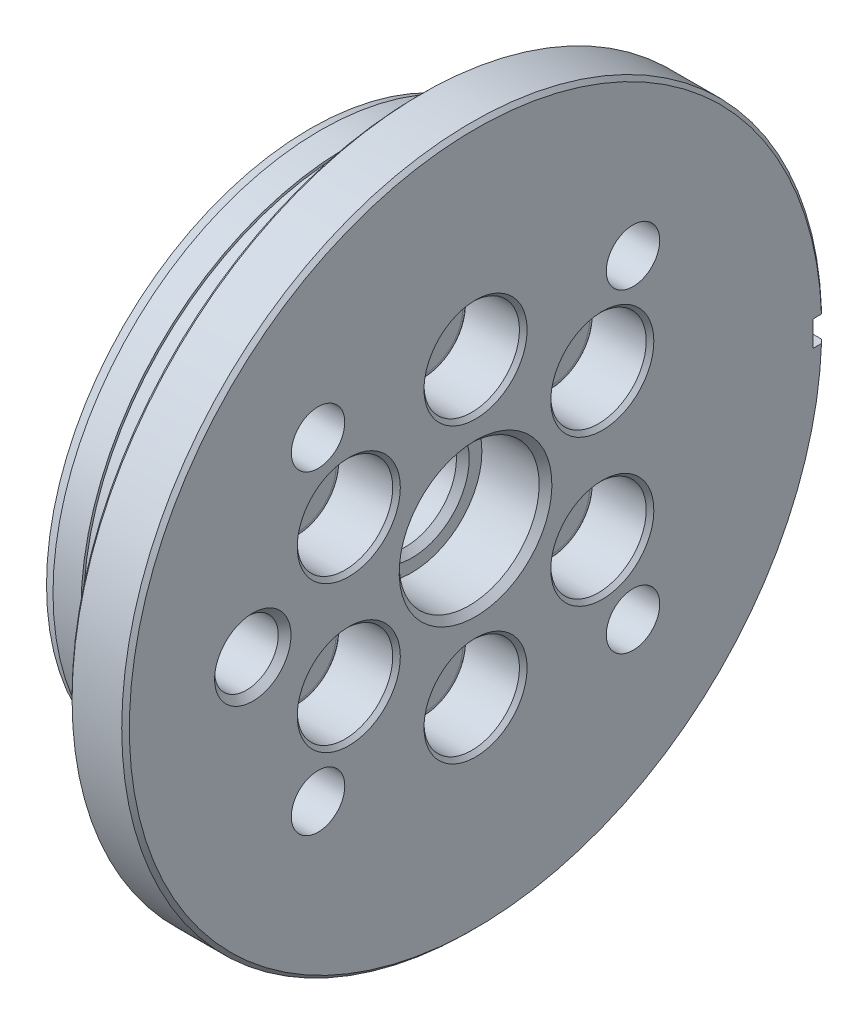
ISO-10303-21;
HEADER;
FILE_DESCRIPTION(('STEP AP214'),'2;1');
FILE_NAME('part.step','',(''),(''),'','','');
FILE_SCHEMA(('AUTOMOTIVE_DESIGN { 1 0 10303 214 1 1 1 1 }'));
ENDSEC;
DATA;
#1=APPLICATION_CONTEXT('core data for automotive mechanical design processes');
#2=APPLICATION_PROTOCOL_DEFINITION('international standard','automotive_design',2000,#1);
#3=PRODUCT_CONTEXT('',#1,'mechanical');
#4=PRODUCT('Part','Part','',(#3));
#5=PRODUCT_RELATED_PRODUCT_CATEGORY('part','',(#4));
#6=PRODUCT_DEFINITION_FORMATION('','',#4);
#7=PRODUCT_DEFINITION_CONTEXT('part definition',#1,'design');
#8=PRODUCT_DEFINITION('design','',#6,#7);
#9=PRODUCT_DEFINITION_SHAPE('','',#8);
#10=(LENGTH_UNIT() NAMED_UNIT(*) SI_UNIT(.MILLI.,.METRE.));
#11=(NAMED_UNIT(*) PLANE_ANGLE_UNIT() SI_UNIT($,.RADIAN.));
#12=(NAMED_UNIT(*) SI_UNIT($,.STERADIAN.) SOLID_ANGLE_UNIT());
#13=UNCERTAINTY_MEASURE_WITH_UNIT(LENGTH_MEASURE(1.E-05),#10,'distance_accuracy_value','');
#14=(GEOMETRIC_REPRESENTATION_CONTEXT(3) GLOBAL_UNCERTAINTY_ASSIGNED_CONTEXT((#13)) GLOBAL_UNIT_ASSIGNED_CONTEXT((#10,
#11,#12)) REPRESENTATION_CONTEXT('',''));
#15=CARTESIAN_POINT('',(0.,0.,0.));
#16=DIRECTION('',(0.,0.,1.));
#17=DIRECTION('',(1.,0.,0.));
#18=AXIS2_PLACEMENT_3D('',#15,#16,#17);
#19=CARTESIAN_POINT('',(7.,4.1491960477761,-10.6206745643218));
#20=DIRECTION('',(-1.,0.,0.));
#21=DIRECTION('',(0.,-1.,0.));
#22=AXIS2_PLACEMENT_3D('',#19,#20,#21);
#23=PLANE('',#22);
#24=DIRECTION('',(0.,-0.131421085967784,-0.991326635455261));
#25=VECTOR('',#24,1.);
#26=CARTESIAN_POINT('',(7.,7.35080395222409,-9.29790972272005));
#27=LINE('',#26,#25);
#28=CARTESIAN_POINT('',(7.,7.35080395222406,-9.29790972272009));
#29=VERTEX_POINT('',#28);
#30=CARTESIAN_POINT('',(7.00000000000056,7.23698995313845,-10.1564237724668));
#31=VERTEX_POINT('',#30);
#32=EDGE_CURVE('P0_E122',#29,#31,#27,.T.);
#33=ORIENTED_EDGE('',*,*,#32,.F.);
#34=DIRECTION('',(0.,0.792803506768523,-0.609477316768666));
#35=VECTOR('',#34,1.);
#36=CARTESIAN_POINT('',(7.,5.977627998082,-8.24226404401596));
#37=LINE('',#36,#35);
#38=CARTESIAN_POINT('',(7.00000000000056,6.66421597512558,-8.7700868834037));
#39=VERTEX_POINT('',#38);
#40=EDGE_CURVE('P0_E121',#39,#29,#37,.T.);
#41=ORIENTED_EDGE('',*,*,#40,.F.);
#42=CARTESIAN_POINT('',(7.00000000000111,5.75000000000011,-9.95929214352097));
#43=DIRECTION('',(1.,0.,0.));
#44=DIRECTION('',(0.,0.,-1.));
#45=AXIS2_PLACEMENT_3D('',#42,#43,#44);
#46=CIRCLE('',#45,1.4999999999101);
#47=EDGE_CURVE('P0_E96',#39,#31,#46,.F.);
#48=ORIENTED_EDGE('',*,*,#47,.T.);
#49=EDGE_LOOP('',(#33,#41,#48));
#50=FACE_BOUND('',#49,.T.);
#51=ADVANCED_FACE('P0_F18',(#50),#23,.F.);
#52=CARTESIAN_POINT('',(7.,4.1491960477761,-10.6206745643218));
#53=DIRECTION('',(-1.,0.,0.));
#54=DIRECTION('',(0.,-1.,0.));
#55=AXIS2_PLACEMENT_3D('',#52,#53,#54);
#56=PLANE('',#55);
#57=DIRECTION('',(0.,0.792803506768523,-0.609477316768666));
#58=VECTOR('',#57,1.);
#59=CARTESIAN_POINT('',(7.,5.977627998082,-8.24226404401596));
#60=LINE('',#59,#58);
#61=CARTESIAN_POINT('',(7.,5.97762799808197,-8.24226404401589));
#62=VERTEX_POINT('',#61);
#63=EDGE_CURVE('P0_E114',#62,#39,#60,.T.);
#64=ORIENTED_EDGE('',*,*,#63,.F.);
#65=DIRECTION('',(0.,0.924224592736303,0.381849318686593));
#66=VECTOR('',#65,1.);
#67=CARTESIAN_POINT('',(7.,4.37682404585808,-8.90364646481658));
#68=LINE('',#67,#66);
#69=CARTESIAN_POINT('',(7.00000000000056,5.17722602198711,-8.57295525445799));
#70=VERTEX_POINT('',#69);
#71=EDGE_CURVE('P0_E117',#70,#62,#68,.T.);
#72=ORIENTED_EDGE('',*,*,#71,.F.);
#73=CARTESIAN_POINT('',(7.00000000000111,5.75000000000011,-9.95929214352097));
#74=DIRECTION('',(1.,0.,0.));
#75=DIRECTION('',(0.,0.,-1.));
#76=AXIS2_PLACEMENT_3D('',#73,#74,#75);
#77=CIRCLE('',#76,1.4999999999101);
#78=EDGE_CURVE('P0_E100',#39,#70,#77,.T.);
#79=ORIENTED_EDGE('',*,*,#78,.F.);
#80=EDGE_LOOP('',(#64,#72,#79));
#81=FACE_BOUND('',#80,.T.);
#82=ADVANCED_FACE('P0_F112',(#81),#56,.F.);
#83=CARTESIAN_POINT('',(7.,5.977627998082,-8.24226404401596));
#84=DIRECTION('',(0.,-0.609477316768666,-0.792803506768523));
#85=DIRECTION('',(0.,0.792803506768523,-0.609477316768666));
#86=AXIS2_PLACEMENT_3D('',#83,#84,#85);
#87=PLANE('',#86);
#88=ORIENTED_EDGE('',*,*,#40,.T.);
#89=DIRECTION('',(1.,0.,0.));
#90=VECTOR('',#89,1.);
#91=CARTESIAN_POINT('',(7.,7.35080395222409,-9.29790972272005));
#92=LINE('',#91,#90);
#93=CARTESIAN_POINT('',(8.99999999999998,7.35080395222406,-9.29790972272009));
#94=VERTEX_POINT('',#93);
#95=EDGE_CURVE('P0_E141',#94,#29,#92,.F.);
#96=ORIENTED_EDGE('',*,*,#95,.F.);
#97=DIRECTION('',(0.,0.792803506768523,-0.609477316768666));
#98=VECTOR('',#97,1.);
#99=CARTESIAN_POINT('',(8.99999999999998,5.977627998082,-8.24226404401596));
#100=LINE('',#99,#98);
#101=CARTESIAN_POINT('',(8.99999999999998,5.97762799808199,-8.24226404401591));
#102=VERTEX_POINT('',#101);
#103=EDGE_CURVE('P0_E119',#94,#102,#100,.F.);
#104=ORIENTED_EDGE('',*,*,#103,.T.);
#105=DIRECTION('',(1.,0.,0.));
#106=VECTOR('',#105,1.);
#107=CARTESIAN_POINT('',(7.,5.97762799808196,-8.24226404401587));
#108=LINE('',#107,#106);
#109=EDGE_CURVE('P0_E131',#62,#102,#108,.T.);
#110=ORIENTED_EDGE('',*,*,#109,.F.);
#111=ORIENTED_EDGE('',*,*,#63,.T.);
#112=EDGE_LOOP('',(#88,#96,#104,#110,#111));
#113=FACE_BOUND('',#112,.T.);
#114=ADVANCED_FACE('P0_F128',(#113),#87,.T.);
#115=CARTESIAN_POINT('',(7.,7.35080395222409,-9.29790972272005));
#116=DIRECTION('',(0.,-0.991326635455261,0.131421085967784));
#117=DIRECTION('',(0.,-0.131421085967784,-0.991326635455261));
#118=AXIS2_PLACEMENT_3D('',#115,#116,#117);
#119=PLANE('',#118);
#120=DIRECTION('',(0.,-0.131421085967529,-0.991326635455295));
#121=VECTOR('',#120,1.);
#122=CARTESIAN_POINT('',(7.,7.23698995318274,-10.1564237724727));
#123=LINE('',#122,#121);
#124=CARTESIAN_POINT('',(7.,7.12317595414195,-11.014937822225));
#125=VERTEX_POINT('',#124);
#126=EDGE_CURVE('P0_E108',#31,#125,#123,.T.);
#127=ORIENTED_EDGE('',*,*,#126,.T.);
#128=DIRECTION('',(1.,0.,0.));
#129=VECTOR('',#128,1.);
#130=CARTESIAN_POINT('',(7.,7.12317595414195,-11.014937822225));
#131=LINE('',#130,#129);
#132=CARTESIAN_POINT('',(8.99999999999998,7.12317595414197,-11.014937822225));
#133=VERTEX_POINT('',#132);
#134=EDGE_CURVE('P0_E211',#133,#125,#131,.F.);
#135=ORIENTED_EDGE('',*,*,#134,.F.);
#136=DIRECTION('',(0.,-0.131421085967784,-0.991326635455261));
#137=VECTOR('',#136,1.);
#138=CARTESIAN_POINT('',(8.99999999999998,7.35080395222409,-9.29790972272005));
#139=LINE('',#138,#137);
#140=EDGE_CURVE('P0_E126',#133,#94,#139,.F.);
#141=ORIENTED_EDGE('',*,*,#140,.T.);
#142=ORIENTED_EDGE('',*,*,#95,.T.);
#143=ORIENTED_EDGE('',*,*,#32,.T.);
#144=EDGE_LOOP('',(#127,#135,#141,#142,#143));
#145=FACE_BOUND('',#144,.T.);
#146=ADVANCED_FACE('P0_F430',(#145),#119,.T.);
#147=CARTESIAN_POINT('',(7.,4.1491960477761,-10.6206745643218));
#148=DIRECTION('',(-1.,0.,0.));
#149=DIRECTION('',(0.,-1.,0.));
#150=AXIS2_PLACEMENT_3D('',#147,#148,#149);
#151=PLANE('',#150);
#152=DIRECTION('',(0.,-0.924224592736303,-0.381849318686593));
#153=VECTOR('',#152,1.);
#154=CARTESIAN_POINT('',(7.,7.12317595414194,-11.014937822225));
#155=LINE('',#154,#153);
#156=CARTESIAN_POINT('',(7.00000000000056,6.32277397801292,-11.3456290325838));
#157=VERTEX_POINT('',#156);
#158=EDGE_CURVE('P0_E208',#125,#157,#155,.T.);
#159=ORIENTED_EDGE('',*,*,#158,.F.);
#160=ORIENTED_EDGE('',*,*,#126,.F.);
#161=CARTESIAN_POINT('',(7.00000000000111,5.75000000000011,-9.95929214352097));
#162=DIRECTION('',(1.,0.,0.));
#163=DIRECTION('',(0.,0.,-1.));
#164=AXIS2_PLACEMENT_3D('',#161,#162,#163);
#165=CIRCLE('',#164,1.4999999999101);
#166=EDGE_CURVE('P0_E103',#31,#157,#165,.F.);
#167=ORIENTED_EDGE('',*,*,#166,.T.);
#168=EDGE_LOOP('',(#159,#160,#167));
#169=FACE_BOUND('',#168,.T.);
#170=ADVANCED_FACE('P0_F420',(#169),#151,.F.);
#171=CARTESIAN_POINT('',(6.99999999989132,5.75000000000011,-9.95929214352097));
#172=DIRECTION('',(1.,0.,0.));
#173=DIRECTION('',(0.,0.,-1.));
#174=AXIS2_PLACEMENT_3D('',#171,#172,#173);
#175=CONICAL_SURFACE('',#174,1.49999999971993,1.04719755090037);
#176=CARTESIAN_POINT('',(6.13397459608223,5.75000000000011,-9.95929214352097));
#177=VERTEX_POINT('',#176);
#178=VERTEX_LOOP('',#177);
#179=FACE_BOUND('',#178,.T.);
#180=CARTESIAN_POINT('',(7.00000000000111,5.75000000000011,-9.95929214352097));
#181=DIRECTION('',(1.,0.,0.));
#182=DIRECTION('',(0.,0.,-1.));
#183=AXIS2_PLACEMENT_3D('',#180,#181,#182);
#184=CIRCLE('',#183,1.4999999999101);
#185=CARTESIAN_POINT('',(7.00000000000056,4.26301004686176,-9.76216051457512));
#186=VERTEX_POINT('',#185);
#187=EDGE_CURVE('P0_E155',#70,#186,#184,.T.);
#188=ORIENTED_EDGE('',*,*,#187,.T.);
#189=CARTESIAN_POINT('',(7.00000000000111,5.75000000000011,-9.95929214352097));
#190=DIRECTION('',(1.,0.,0.));
#191=DIRECTION('',(0.,0.,-1.));
#192=AXIS2_PLACEMENT_3D('',#189,#190,#191);
#193=CIRCLE('',#192,1.4999999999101);
#194=CARTESIAN_POINT('',(7.00000000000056,4.83578402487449,-11.148497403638));
#195=VERTEX_POINT('',#194);
#196=EDGE_CURVE('P0_E170',#195,#186,#193,.F.);
#197=ORIENTED_EDGE('',*,*,#196,.F.);
#198=CARTESIAN_POINT('',(7.00000000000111,5.75000000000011,-9.95929214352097));
#199=DIRECTION('',(1.,0.,0.));
#200=DIRECTION('',(0.,0.,-1.));
#201=AXIS2_PLACEMENT_3D('',#198,#199,#200);
#202=CIRCLE('',#201,1.4999999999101);
#203=EDGE_CURVE('P0_E165',#195,#157,#202,.T.);
#204=ORIENTED_EDGE('',*,*,#203,.T.);
#205=ORIENTED_EDGE('',*,*,#166,.F.);
#206=ORIENTED_EDGE('',*,*,#47,.F.);
#207=ORIENTED_EDGE('',*,*,#78,.T.);
#208=EDGE_LOOP('',(#188,#197,#204,#205,#206,#207));
#209=FACE_BOUND('',#208,.T.);
#210=ADVANCED_FACE('P0_F99',(#179,#209),#175,.F.);
#211=CARTESIAN_POINT('',(7.,4.1491960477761,-10.6206745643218));
#212=DIRECTION('',(-1.,0.,0.));
#213=DIRECTION('',(0.,-1.,0.));
#214=AXIS2_PLACEMENT_3D('',#211,#212,#213);
#215=PLANE('',#214);
#216=DIRECTION('',(0.,0.924224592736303,0.381849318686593));
#217=VECTOR('',#216,1.);
#218=CARTESIAN_POINT('',(7.,4.37682404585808,-8.90364646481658));
#219=LINE('',#218,#217);
#220=CARTESIAN_POINT('',(7.,4.3768240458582,-8.90364646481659));
#221=VERTEX_POINT('',#220);
#222=EDGE_CURVE('P0_E154',#221,#70,#219,.T.);
#223=ORIENTED_EDGE('',*,*,#222,.F.);
#224=DIRECTION('',(0.,0.131421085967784,0.991326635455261));
#225=VECTOR('',#224,1.);
#226=CARTESIAN_POINT('',(7.,4.1491960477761,-10.6206745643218));
#227=LINE('',#226,#225);
#228=EDGE_CURVE('P0_E193',#186,#221,#227,.T.);
#229=ORIENTED_EDGE('',*,*,#228,.F.);
#230=ORIENTED_EDGE('',*,*,#187,.F.);
#231=EDGE_LOOP('',(#223,#229,#230));
#232=FACE_BOUND('',#231,.T.);
#233=ADVANCED_FACE('P0_F402',(#232),#215,.F.);
#234=CARTESIAN_POINT('',(7.,4.37682404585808,-8.90364646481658));
#235=DIRECTION('',(0.,0.381849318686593,-0.924224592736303));
#236=DIRECTION('',(0.,0.924224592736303,0.381849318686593));
#237=AXIS2_PLACEMENT_3D('',#234,#235,#236);
#238=PLANE('',#237);
#239=ORIENTED_EDGE('',*,*,#71,.T.);
#240=ORIENTED_EDGE('',*,*,#109,.T.);
#241=DIRECTION('',(0.,0.924224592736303,0.381849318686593));
#242=VECTOR('',#241,1.);
#243=CARTESIAN_POINT('',(8.99999999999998,4.37682404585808,-8.90364646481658));
#244=LINE('',#243,#242);
#245=CARTESIAN_POINT('',(8.99999999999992,4.37682404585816,-8.90364646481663));
#246=VERTEX_POINT('',#245);
#247=EDGE_CURVE('P0_E151',#102,#246,#244,.F.);
#248=ORIENTED_EDGE('',*,*,#247,.T.);
#249=DIRECTION('',(1.,0.,0.));
#250=VECTOR('',#249,1.);
#251=CARTESIAN_POINT('',(7.,4.37682404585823,-8.9036464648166));
#252=LINE('',#251,#250);
#253=EDGE_CURVE('P0_E196',#221,#246,#252,.T.);
#254=ORIENTED_EDGE('',*,*,#253,.F.);
#255=ORIENTED_EDGE('',*,*,#222,.T.);
#256=EDGE_LOOP('',(#239,#240,#248,#254,#255));
#257=FACE_BOUND('',#256,.T.);
#258=ADVANCED_FACE('P0_F393',(#257),#238,.T.);
#259=CARTESIAN_POINT('',(7.,7.12317595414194,-11.014937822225));
#260=DIRECTION('',(0.,-0.381849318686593,0.924224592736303));
#261=DIRECTION('',(0.,-0.924224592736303,-0.381849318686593));
#262=AXIS2_PLACEMENT_3D('',#259,#260,#261);
#263=PLANE('',#262);
#264=DIRECTION('',(0.,-0.924224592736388,-0.381849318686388));
#265=VECTOR('',#264,1.);
#266=CARTESIAN_POINT('',(7.,6.32277397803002,-11.3456290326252));
#267=LINE('',#266,#265);
#268=CARTESIAN_POINT('',(7.,5.52237200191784,-11.6763202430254));
#269=VERTEX_POINT('',#268);
#270=EDGE_CURVE('P0_E168',#157,#269,#267,.T.);
#271=ORIENTED_EDGE('',*,*,#270,.T.);
#272=DIRECTION('',(1.,0.,0.));
#273=VECTOR('',#272,1.);
#274=CARTESIAN_POINT('',(7.,5.52237200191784,-11.6763202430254));
#275=LINE('',#274,#273);
#276=CARTESIAN_POINT('',(8.99999999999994,5.52237200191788,-11.6763202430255));
#277=VERTEX_POINT('',#276);
#278=EDGE_CURVE('P0_E202',#277,#269,#275,.F.);
#279=ORIENTED_EDGE('',*,*,#278,.F.);
#280=DIRECTION('',(0.,-0.924224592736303,-0.381849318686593));
#281=VECTOR('',#280,1.);
#282=CARTESIAN_POINT('',(8.99999999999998,7.12317595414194,-11.014937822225));
#283=LINE('',#282,#281);
#284=EDGE_CURVE('P0_E219',#277,#133,#283,.F.);
#285=ORIENTED_EDGE('',*,*,#284,.T.);
#286=ORIENTED_EDGE('',*,*,#134,.T.);
#287=ORIENTED_EDGE('',*,*,#158,.T.);
#288=EDGE_LOOP('',(#271,#279,#285,#286,#287));
#289=FACE_BOUND('',#288,.T.);
#290=ADVANCED_FACE('P0_F383',(#289),#263,.T.);
#291=CARTESIAN_POINT('',(7.,4.1491960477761,-10.6206745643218));
#292=DIRECTION('',(-1.,0.,0.));
#293=DIRECTION('',(0.,-1.,0.));
#294=AXIS2_PLACEMENT_3D('',#291,#292,#293);
#295=PLANE('',#294);
#296=DIRECTION('',(0.,-0.792803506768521,0.609477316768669));
#297=VECTOR('',#296,1.);
#298=CARTESIAN_POINT('',(7.,5.52237200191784,-11.6763202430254));
#299=LINE('',#298,#297);
#300=EDGE_CURVE('P0_E236',#269,#195,#299,.T.);
#301=ORIENTED_EDGE('',*,*,#300,.F.);
#302=ORIENTED_EDGE('',*,*,#270,.F.);
#303=ORIENTED_EDGE('',*,*,#203,.F.);
#304=EDGE_LOOP('',(#301,#302,#303));
#305=FACE_BOUND('',#304,.T.);
#306=ADVANCED_FACE('P0_F373',(#305),#295,.F.);
#307=CARTESIAN_POINT('',(7.,4.1491960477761,-10.6206745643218));
#308=DIRECTION('',(-1.,0.,0.));
#309=DIRECTION('',(0.,-1.,0.));
#310=AXIS2_PLACEMENT_3D('',#307,#308,#309);
#311=PLANE('',#310);
#312=DIRECTION('',(0.,0.131421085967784,0.991326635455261));
#313=VECTOR('',#312,1.);
#314=CARTESIAN_POINT('',(7.,4.1491960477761,-10.6206745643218));
#315=LINE('',#314,#313);
#316=CARTESIAN_POINT('',(7.,4.14919604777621,-10.6206745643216));
#317=VERTEX_POINT('',#316);
#318=EDGE_CURVE('P0_E197',#317,#186,#315,.T.);
#319=ORIENTED_EDGE('',*,*,#318,.F.);
#320=DIRECTION('',(0.,-0.792803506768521,0.609477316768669));
#321=VECTOR('',#320,1.);
#322=CARTESIAN_POINT('',(7.,5.52237200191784,-11.6763202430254));
#323=LINE('',#322,#321);
#324=EDGE_CURVE('P0_E185',#195,#317,#323,.T.);
#325=ORIENTED_EDGE('',*,*,#324,.F.);
#326=ORIENTED_EDGE('',*,*,#196,.T.);
#327=EDGE_LOOP('',(#319,#325,#326));
#328=FACE_BOUND('',#327,.T.);
#329=ADVANCED_FACE('P0_F363',(#328),#311,.F.);
#330=CARTESIAN_POINT('',(7.,4.1491960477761,-10.6206745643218));
#331=DIRECTION('',(0.,0.991326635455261,-0.131421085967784));
#332=DIRECTION('',(0.,0.131421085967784,0.991326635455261));
#333=AXIS2_PLACEMENT_3D('',#330,#331,#332);
#334=PLANE('',#333);
#335=ORIENTED_EDGE('',*,*,#228,.T.);
#336=ORIENTED_EDGE('',*,*,#253,.T.);
#337=DIRECTION('',(0.,0.131421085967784,0.991326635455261));
#338=VECTOR('',#337,1.);
#339=CARTESIAN_POINT('',(8.99999999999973,4.1491960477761,-10.6206745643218));
#340=LINE('',#339,#338);
#341=CARTESIAN_POINT('',(8.99999999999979,4.14919604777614,-10.6206745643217));
#342=VERTEX_POINT('',#341);
#343=EDGE_CURVE('P0_E167',#246,#342,#340,.F.);
#344=ORIENTED_EDGE('',*,*,#343,.T.);
#345=DIRECTION('',(1.,0.,0.));
#346=VECTOR('',#345,1.);
#347=CARTESIAN_POINT('',(7.,4.14919604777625,-10.6206745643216));
#348=LINE('',#347,#346);
#349=EDGE_CURVE('P0_E179',#317,#342,#348,.T.);
#350=ORIENTED_EDGE('',*,*,#349,.F.);
#351=ORIENTED_EDGE('',*,*,#318,.T.);
#352=EDGE_LOOP('',(#335,#336,#344,#350,#351));
#353=FACE_BOUND('',#352,.T.);
#354=ADVANCED_FACE('P0_F302',(#353),#334,.T.);
#355=CARTESIAN_POINT('',(7.,5.52237200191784,-11.6763202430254));
#356=DIRECTION('',(0.,0.609477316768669,0.792803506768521));
#357=DIRECTION('',(0.,-0.792803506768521,0.609477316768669));
#358=AXIS2_PLACEMENT_3D('',#355,#356,#357);
#359=PLANE('',#358);
#360=ORIENTED_EDGE('',*,*,#324,.T.);
#361=ORIENTED_EDGE('',*,*,#349,.T.);
#362=DIRECTION('',(0.,0.792803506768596,-0.60947731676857));
#363=VECTOR('',#362,1.);
#364=CARTESIAN_POINT('',(8.99999999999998,4.14919604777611,-10.6206745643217));
#365=LINE('',#364,#363);
#366=EDGE_CURVE('P0_E177',#342,#277,#365,.T.);
#367=ORIENTED_EDGE('',*,*,#366,.T.);
#368=ORIENTED_EDGE('',*,*,#278,.T.);
#369=ORIENTED_EDGE('',*,*,#300,.T.);
#370=EDGE_LOOP('',(#360,#361,#367,#368,#369));
#371=FACE_BOUND('',#370,.T.);
#372=ADVANCED_FACE('P0_F296',(#371),#359,.T.);
#373=CARTESIAN_POINT('',(8.99999999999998,5.75000000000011,-9.95929214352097));
#374=DIRECTION('',(-1.,0.,0.));
#375=DIRECTION('',(0.,-1.,0.));
#376=AXIS2_PLACEMENT_3D('',#373,#374,#375);
#377=PLANE('',#376);
#378=ORIENTED_EDGE('',*,*,#343,.F.);
#379=ORIENTED_EDGE('',*,*,#247,.F.);
#380=ORIENTED_EDGE('',*,*,#103,.F.);
#381=ORIENTED_EDGE('',*,*,#140,.F.);
#382=ORIENTED_EDGE('',*,*,#284,.F.);
#383=ORIENTED_EDGE('',*,*,#366,.F.);
#384=EDGE_LOOP('',(#378,#379,#380,#381,#382,#383));
#385=FACE_BOUND('',#384,.T.);
#386=CARTESIAN_POINT('',(9.00000000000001,5.75000000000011,-9.95929214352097));
#387=DIRECTION('',(-1.,0.,0.));
#388=DIRECTION('',(0.,-0.924224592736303,-0.381849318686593));
#389=AXIS2_PLACEMENT_3D('',#386,#387,#388);
#390=CIRCLE('',#389,3.);
#391=CARTESIAN_POINT('',(9.,2.9773262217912,-11.1048400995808));
#392=VERTEX_POINT('',#391);
#393=CARTESIAN_POINT('',(9.,8.52267377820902,-8.8137441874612));
#394=VERTEX_POINT('',#393);
#395=EDGE_CURVE('P0_E175',#392,#394,#390,.T.);
#396=ORIENTED_EDGE('',*,*,#395,.F.);
#397=CARTESIAN_POINT('',(9.00000000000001,5.75000000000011,-9.95929214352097));
#398=DIRECTION('',(-1.,0.,0.));
#399=DIRECTION('',(0.,0.924224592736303,0.381849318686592));
#400=AXIS2_PLACEMENT_3D('',#397,#398,#399);
#401=CIRCLE('',#400,3.);
#402=EDGE_CURVE('P0_E37',#394,#392,#401,.T.);
#403=ORIENTED_EDGE('',*,*,#402,.F.);
#404=EDGE_LOOP('',(#396,#403));
#405=FACE_BOUND('',#404,.T.);
#406=ADVANCED_FACE('P0_F270',(#385,#405),#377,.F.);
#407=CARTESIAN_POINT('',(8.50000000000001,5.75000000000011,-9.95929214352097));
#408=DIRECTION('',(-1.,0.,0.));
#409=DIRECTION('',(0.,-0.924224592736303,-0.381849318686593));
#410=AXIS2_PLACEMENT_3D('',#407,#408,#409);
#411=TOROIDAL_SURFACE('',#410,3.,0.5);
#412=CARTESIAN_POINT('',(8.50000000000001,5.75000000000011,-9.95929214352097));
#413=DIRECTION('',(1.,0.,0.));
#414=DIRECTION('',(0.,0.,-1.));
#415=AXIS2_PLACEMENT_3D('',#412,#413,#414);
#416=CIRCLE('',#415,3.5);
#417=CARTESIAN_POINT('',(8.50000000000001,5.75000000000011,-13.459292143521));
#418=VERTEX_POINT('',#417);
#419=EDGE_CURVE('P0_E164',#418,#418,#416,.F.);
#420=ORIENTED_EDGE('',*,*,#419,.F.);
#421=EDGE_LOOP('',(#420));
#422=FACE_BOUND('',#421,.T.);
#423=ORIENTED_EDGE('',*,*,#395,.T.);
#424=ORIENTED_EDGE('',*,*,#402,.T.);
#425=EDGE_LOOP('',(#423,#424));
#426=FACE_BOUND('',#425,.T.);
#427=ADVANCED_FACE('P0_F174',(#422,#426),#411,.T.);
#428=CARTESIAN_POINT('',(-5.00000000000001,5.75000000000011,-9.95929214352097));
#429=DIRECTION('',(-1.,0.,0.));
#430=DIRECTION('',(0.,-1.,0.));
#431=AXIS2_PLACEMENT_3D('',#428,#429,#430);
#432=PLANE('',#431);
#433=CARTESIAN_POINT('',(-5.00000000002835,5.75000000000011,-9.95929214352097));
#434=DIRECTION('',(1.,0.,0.));
#435=DIRECTION('',(0.,0.,-1.));
#436=AXIS2_PLACEMENT_3D('',#433,#434,#435);
#437=CIRCLE('',#436,1.79999999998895);
#438=CARTESIAN_POINT('',(-5.00000000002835,5.75000000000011,-11.7592921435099));
#439=VERTEX_POINT('',#438);
#440=EDGE_CURVE('P0_E161',#439,#439,#437,.T.);
#441=ORIENTED_EDGE('',*,*,#440,.F.);
#442=EDGE_LOOP('',(#441));
#443=FACE_BOUND('',#442,.T.);
#444=ADVANCED_FACE('P0_F269',(#443),#432,.T.);
#445=CARTESIAN_POINT('',(5.,5.75000000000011,-9.95929214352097));
#446=DIRECTION('',(1.,0.,0.));
#447=DIRECTION('',(0.,0.,-1.));
#448=AXIS2_PLACEMENT_3D('',#445,#446,#447);
#449=CYLINDRICAL_SURFACE('',#448,3.5);
#450=ORIENTED_EDGE('',*,*,#419,.T.);
#451=EDGE_LOOP('',(#450));
#452=FACE_BOUND('',#451,.T.);
#453=CARTESIAN_POINT('',(5.,5.75000000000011,-9.95929214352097));
#454=DIRECTION('',(1.,0.,0.));
#455=DIRECTION('',(0.,0.,-1.));
#456=AXIS2_PLACEMENT_3D('',#453,#454,#455);
#457=CIRCLE('',#456,3.5);
#458=CARTESIAN_POINT('',(5.,5.75000000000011,-13.459292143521));
#459=VERTEX_POINT('',#458);
#460=EDGE_CURVE('P0_E158',#459,#459,#457,.F.);
#461=ORIENTED_EDGE('',*,*,#460,.F.);
#462=EDGE_LOOP('',(#461));
#463=FACE_BOUND('',#462,.T.);
#464=ADVANCED_FACE('P0_F317',(#452,#463),#449,.T.);
#465=CARTESIAN_POINT('',(-4.80000000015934,5.75000000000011,-9.95929214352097));
#466=DIRECTION('',(1.,0.,0.));
#467=DIRECTION('',(0.,0.,-1.));
#468=AXIS2_PLACEMENT_3D('',#465,#466,#467);
#469=CONICAL_SURFACE('',#468,1.99999999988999,0.78539816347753);
#470=CARTESIAN_POINT('',(-4.79999999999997,5.75000000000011,-9.95929214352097));
#471=DIRECTION('',(1.,0.,0.));
#472=DIRECTION('',(0.,0.,-1.));
#473=AXIS2_PLACEMENT_3D('',#470,#471,#472);
#474=CIRCLE('',#473,2.);
#475=CARTESIAN_POINT('',(-4.79999999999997,5.75000000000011,-11.959292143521));
#476=VERTEX_POINT('',#475);
#477=EDGE_CURVE('P0_E29',#476,#476,#474,.T.);
#478=ORIENTED_EDGE('',*,*,#477,.F.);
#479=EDGE_LOOP('',(#478));
#480=FACE_BOUND('',#479,.T.);
#481=ORIENTED_EDGE('',*,*,#440,.T.);
#482=EDGE_LOOP('',(#481));
#483=FACE_BOUND('',#482,.T.);
#484=ADVANCED_FACE('P0_F311',(#480,#483),#469,.T.);
#485=CARTESIAN_POINT('',(5.,5.75000000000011,-9.95929214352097));
#486=DIRECTION('',(-1.,0.,0.));
#487=DIRECTION('',(0.,-1.,0.));
#488=AXIS2_PLACEMENT_3D('',#485,#486,#487);
#489=PLANE('',#488);
#490=ORIENTED_EDGE('',*,*,#460,.T.);
#491=EDGE_LOOP('',(#490));
#492=FACE_BOUND('',#491,.T.);
#493=CARTESIAN_POINT('',(5.,5.75000000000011,-9.95929214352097));
#494=DIRECTION('',(1.,0.,0.));
#495=DIRECTION('',(0.,0.,-1.));
#496=AXIS2_PLACEMENT_3D('',#493,#494,#495);
#497=CIRCLE('',#496,2.);
#498=CARTESIAN_POINT('',(5.,5.75000000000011,-11.959292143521));
#499=VERTEX_POINT('',#498);
#500=EDGE_CURVE('P0_E11',#499,#499,#497,.F.);
#501=ORIENTED_EDGE('',*,*,#500,.F.);
#502=EDGE_LOOP('',(#501));
#503=FACE_BOUND('',#502,.T.);
#504=ADVANCED_FACE('P0_F305',(#492,#503),#489,.T.);
#505=CARTESIAN_POINT('',(-5.00000000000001,5.75000000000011,-9.95929214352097));
#506=DIRECTION('',(1.,0.,0.));
#507=DIRECTION('',(0.,0.,-1.));
#508=AXIS2_PLACEMENT_3D('',#505,#506,#507);
#509=CYLINDRICAL_SURFACE('',#508,2.);
#510=ORIENTED_EDGE('',*,*,#500,.T.);
#511=EDGE_LOOP('',(#510));
#512=FACE_BOUND('',#511,.T.);
#513=ORIENTED_EDGE('',*,*,#477,.T.);
#514=EDGE_LOOP('',(#513));
#515=FACE_BOUND('',#514,.T.);
#516=ADVANCED_FACE('P0_F303',(#512,#515),#509,.T.);
#517=CLOSED_SHELL('',(#51,#82,#114,#146,#170,#210,#233,#258,#290,#306,#329,#354,#372,#406,#427,
#444,#464,#484,#504,#516));
#518=MANIFOLD_SOLID_BREP('P0_B1',#517);
#519=CARTESIAN_POINT('',(3.,0.,-21.2));
#520=DIRECTION('',(1.,0.,0.));
#521=DIRECTION('',(0.,0.,-1.));
#522=AXIS2_PLACEMENT_3D('',#519,#520,#521);
#523=PLANE('',#522);
#524=CARTESIAN_POINT('',(3.,0.,0.));
#525=DIRECTION('',(-1.,0.,0.));
#526=DIRECTION('',(0.,0.,1.));
#527=AXIS2_PLACEMENT_3D('',#524,#525,#526);
#528=CIRCLE('',#527,21.);
#529=CARTESIAN_POINT('',(3.,0.,21.));
#530=VERTEX_POINT('',#529);
#531=EDGE_CURVE('P1_E20',#530,#530,#528,.T.);
#532=ORIENTED_EDGE('',*,*,#531,.F.);
#533=EDGE_LOOP('',(#532));
#534=FACE_BOUND('',#533,.T.);
#535=CARTESIAN_POINT('',(3.,0.,0.));
#536=DIRECTION('',(-1.,0.,0.));
#537=DIRECTION('',(0.,0.,1.));
#538=AXIS2_PLACEMENT_3D('',#535,#536,#537);
#539=CIRCLE('',#538,20.8);
#540=CARTESIAN_POINT('',(3.,0.,20.8));
#541=VERTEX_POINT('',#540);
#542=EDGE_CURVE('P1_E174',#541,#541,#539,.F.);
#543=ORIENTED_EDGE('',*,*,#542,.F.);
#544=EDGE_LOOP('',(#543));
#545=FACE_BOUND('',#544,.T.);
#546=ADVANCED_FACE('P1_F17',(#534,#545),#523,.T.);
#547=CARTESIAN_POINT('',(0.,0.,0.));
#548=DIRECTION('',(-1.,0.,0.));
#549=DIRECTION('',(0.,0.,1.));
#550=AXIS2_PLACEMENT_3D('',#547,#548,#549);
#551=CYLINDRICAL_SURFACE('',#550,21.);
#552=ORIENTED_EDGE('',*,*,#531,.T.);
#553=EDGE_LOOP('',(#552));
#554=FACE_BOUND('',#553,.T.);
#555=CARTESIAN_POINT('',(0.800000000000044,0.,0.));
#556=DIRECTION('',(1.,0.,0.));
#557=DIRECTION('',(0.,0.,-1.));
#558=AXIS2_PLACEMENT_3D('',#555,#556,#557);
#559=CIRCLE('',#558,21.);
#560=CARTESIAN_POINT('',(0.800000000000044,0.,-21.));
#561=VERTEX_POINT('',#560);
#562=EDGE_CURVE('P1_E171',#561,#561,#559,.F.);
#563=ORIENTED_EDGE('',*,*,#562,.F.);
#564=EDGE_LOOP('',(#563));
#565=FACE_BOUND('',#564,.T.);
#566=ADVANCED_FACE('P1_F429',(#554,#565),#551,.T.);
#567=CARTESIAN_POINT('',(0.,0.,0.));
#568=DIRECTION('',(-1.,0.,0.));
#569=DIRECTION('',(0.,0.,1.));
#570=AXIS2_PLACEMENT_3D('',#567,#568,#569);
#571=CYLINDRICAL_SURFACE('',#570,20.8);
#572=CARTESIAN_POINT('',(6.,0.,0.));
#573=DIRECTION('',(-1.,0.,0.));
#574=DIRECTION('',(0.,0.,1.));
#575=AXIS2_PLACEMENT_3D('',#572,#573,#574);
#576=CIRCLE('',#575,20.8);
#577=CARTESIAN_POINT('',(6.,0.,20.8));
#578=VERTEX_POINT('',#577);
#579=EDGE_CURVE('P1_E173',#578,#578,#576,.F.);
#580=ORIENTED_EDGE('',*,*,#579,.F.);
#581=EDGE_LOOP('',(#580));
#582=FACE_BOUND('',#581,.T.);
#583=ORIENTED_EDGE('',*,*,#542,.T.);
#584=EDGE_LOOP('',(#583));
#585=FACE_BOUND('',#584,.T.);
#586=ADVANCED_FACE('P1_F437',(#582,#585),#571,.T.);
#587=CARTESIAN_POINT('',(0.800000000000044,0.,0.));
#588=DIRECTION('',(1.,0.,0.));
#589=DIRECTION('',(0.,1.,0.));
#590=AXIS2_PLACEMENT_3D('',#587,#588,#589);
#591=CONICAL_SURFACE('',#590,21.,0.349065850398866);
#592=CARTESIAN_POINT('',(0.,0.,0.));
#593=DIRECTION('',(1.,0.,0.));
#594=DIRECTION('',(0.,1.,0.));
#595=AXIS2_PLACEMENT_3D('',#592,#593,#594);
#596=CIRCLE('',#595,20.708823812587);
#597=CARTESIAN_POINT('',(0.,20.708823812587,0.));
#598=VERTEX_POINT('',#597);
#599=EDGE_CURVE('P1_E419',#598,#598,#596,.T.);
#600=ORIENTED_EDGE('',*,*,#599,.T.);
#601=EDGE_LOOP('',(#600));
#602=FACE_BOUND('',#601,.T.);
#603=ORIENTED_EDGE('',*,*,#562,.T.);
#604=EDGE_LOOP('',(#603));
#605=FACE_BOUND('',#604,.T.);
#606=ADVANCED_FACE('P1_F441',(#602,#605),#591,.T.);
#607=CARTESIAN_POINT('',(3.,0.,0.));
#608=DIRECTION('',(1.,0.,0.));
#609=DIRECTION('',(0.,0.,-1.));
#610=AXIS2_PLACEMENT_3D('',#607,#608,#609);
#611=PLANE('',#610);
#612=CARTESIAN_POINT('',(3.,0.,0.));
#613=DIRECTION('',(1.,0.,0.));
#614=DIRECTION('',(0.,0.,-1.));
#615=AXIS2_PLACEMENT_3D('',#612,#613,#614);
#616=CIRCLE('',#615,4.);
#617=CARTESIAN_POINT('',(3.,0.,-4.));
#618=VERTEX_POINT('',#617);
#619=EDGE_CURVE('P1_E416',#618,#618,#616,.T.);
#620=ORIENTED_EDGE('',*,*,#619,.T.);
#621=EDGE_LOOP('',(#620));
#622=FACE_BOUND('',#621,.T.);
#623=ADVANCED_FACE('P1_F447',(#622),#611,.T.);
#624=CARTESIAN_POINT('',(6.,0.,-21.2));
#625=DIRECTION('',(-1.,0.,0.));
#626=DIRECTION('',(0.,0.,1.));
#627=AXIS2_PLACEMENT_3D('',#624,#625,#626);
#628=PLANE('',#627);
#629=CARTESIAN_POINT('',(6.,0.,0.));
#630=DIRECTION('',(-1.,0.,0.));
#631=DIRECTION('',(0.,0.,1.));
#632=AXIS2_PLACEMENT_3D('',#629,#630,#631);
#633=CIRCLE('',#632,21.);
#634=CARTESIAN_POINT('',(6.,0.,21.));
#635=VERTEX_POINT('',#634);
#636=EDGE_CURVE('P1_E413',#635,#635,#633,.F.);
#637=ORIENTED_EDGE('',*,*,#636,.F.);
#638=EDGE_LOOP('',(#637));
#639=FACE_BOUND('',#638,.T.);
#640=ORIENTED_EDGE('',*,*,#579,.T.);
#641=EDGE_LOOP('',(#640));
#642=FACE_BOUND('',#641,.T.);
#643=ADVANCED_FACE('P1_F451',(#639,#642),#628,.T.);
#644=CARTESIAN_POINT('',(0.,5.5,0.));
#645=DIRECTION('',(1.,0.,0.));
#646=DIRECTION('',(0.,0.,-1.));
#647=AXIS2_PLACEMENT_3D('',#644,#645,#646);
#648=PLANE('',#647);
#649=CARTESIAN_POINT('',(0.,11.5,0.));
#650=DIRECTION('',(1.,0.,0.));
#651=DIRECTION('',(0.,0.,-1.));
#652=AXIS2_PLACEMENT_3D('',#649,#650,#651);
#653=CIRCLE('',#652,2.25);
#654=CARTESIAN_POINT('',(0.,11.5,-2.25));
#655=VERTEX_POINT('',#654);
#656=EDGE_CURVE('P1_E401',#655,#655,#653,.T.);
#657=ORIENTED_EDGE('',*,*,#656,.T.);
#658=EDGE_LOOP('',(#657));
#659=FACE_BOUND('',#658,.T.);
#660=CARTESIAN_POINT('',(0.,5.74999999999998,9.95929214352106));
#661=DIRECTION('',(1.,0.,0.));
#662=DIRECTION('',(0.,0.,-1.));
#663=AXIS2_PLACEMENT_3D('',#660,#661,#662);
#664=CIRCLE('',#663,2.25);
#665=CARTESIAN_POINT('',(0.,5.74999999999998,7.70929214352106));
#666=VERTEX_POINT('',#665);
#667=EDGE_CURVE('P1_E398',#666,#666,#664,.T.);
#668=ORIENTED_EDGE('',*,*,#667,.T.);
#669=EDGE_LOOP('',(#668));
#670=FACE_BOUND('',#669,.T.);
#671=CARTESIAN_POINT('',(0.,-5.75000000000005,9.95929214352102));
#672=DIRECTION('',(1.,0.,0.));
#673=DIRECTION('',(0.,0.,-1.));
#674=AXIS2_PLACEMENT_3D('',#671,#672,#673);
#675=CIRCLE('',#674,2.25);
#676=CARTESIAN_POINT('',(0.,-5.75000000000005,7.70929214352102));
#677=VERTEX_POINT('',#676);
#678=EDGE_CURVE('P1_E170',#677,#677,#675,.T.);
#679=ORIENTED_EDGE('',*,*,#678,.T.);
#680=EDGE_LOOP('',(#679));
#681=FACE_BOUND('',#680,.T.);
#682=CARTESIAN_POINT('',(0.,-11.5,0.));
#683=DIRECTION('',(1.,0.,0.));
#684=DIRECTION('',(0.,0.,-1.));
#685=AXIS2_PLACEMENT_3D('',#682,#683,#684);
#686=CIRCLE('',#685,2.25);
#687=CARTESIAN_POINT('',(0.,-11.5,-2.25));
#688=VERTEX_POINT('',#687);
#689=EDGE_CURVE('P1_E410',#688,#688,#686,.T.);
#690=ORIENTED_EDGE('',*,*,#689,.T.);
#691=EDGE_LOOP('',(#690));
#692=FACE_BOUND('',#691,.T.);
#693=CARTESIAN_POINT('',(0.,-5.74999999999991,-9.9592921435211));
#694=DIRECTION('',(1.,0.,0.));
#695=DIRECTION('',(0.,0.,-1.));
#696=AXIS2_PLACEMENT_3D('',#693,#694,#695);
#697=CIRCLE('',#696,2.25);
#698=CARTESIAN_POINT('',(0.,-5.74999999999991,-12.2092921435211));
#699=VERTEX_POINT('',#698);
#700=EDGE_CURVE('P1_E407',#699,#699,#697,.T.);
#701=ORIENTED_EDGE('',*,*,#700,.T.);
#702=EDGE_LOOP('',(#701));
#703=FACE_BOUND('',#702,.T.);
#704=CARTESIAN_POINT('',(0.,5.75000000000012,-9.95929214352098));
#705=DIRECTION('',(1.,0.,0.));
#706=DIRECTION('',(0.,0.,-1.));
#707=AXIS2_PLACEMENT_3D('',#704,#705,#706);
#708=CIRCLE('',#707,2.25);
#709=CARTESIAN_POINT('',(0.,5.75000000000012,-12.209292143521));
#710=VERTEX_POINT('',#709);
#711=EDGE_CURVE('P1_E404',#710,#710,#708,.T.);
#712=ORIENTED_EDGE('',*,*,#711,.T.);
#713=EDGE_LOOP('',(#712));
#714=FACE_BOUND('',#713,.T.);
#715=ORIENTED_EDGE('',*,*,#599,.F.);
#716=EDGE_LOOP('',(#715));
#717=FACE_BOUND('',#716,.T.);
#718=ADVANCED_FACE('P1_F455',(#659,#670,#681,#692,#703,#714,#717),#648,.F.);
#719=CARTESIAN_POINT('',(3.,0.,0.));
#720=DIRECTION('',(1.,0.,0.));
#721=DIRECTION('',(0.,0.,-1.));
#722=AXIS2_PLACEMENT_3D('',#719,#720,#721);
#723=CYLINDRICAL_SURFACE('',#722,4.);
#724=ORIENTED_EDGE('',*,*,#619,.F.);
#725=EDGE_LOOP('',(#724));
#726=FACE_BOUND('',#725,.T.);
#727=CARTESIAN_POINT('',(7.49999999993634,0.,0.));
#728=DIRECTION('',(1.,0.,0.));
#729=DIRECTION('',(0.,0.,-1.));
#730=AXIS2_PLACEMENT_3D('',#727,#728,#729);
#731=CIRCLE('',#730,3.99999999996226);
#732=CARTESIAN_POINT('',(7.49999999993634,0.,-3.99999999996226));
#733=VERTEX_POINT('',#732);
#734=EDGE_CURVE('P1_E166',#733,#733,#731,.T.);
#735=ORIENTED_EDGE('',*,*,#734,.T.);
#736=EDGE_LOOP('',(#735));
#737=FACE_BOUND('',#736,.T.);
#738=ADVANCED_FACE('P1_F459',(#726,#737),#723,.F.);
#739=CARTESIAN_POINT('',(0.,0.,0.));
#740=DIRECTION('',(-1.,0.,0.));
#741=DIRECTION('',(0.,0.,1.));
#742=AXIS2_PLACEMENT_3D('',#739,#740,#741);
#743=CYLINDRICAL_SURFACE('',#742,21.);
#744=ORIENTED_EDGE('',*,*,#636,.T.);
#745=EDGE_LOOP('',(#744));
#746=FACE_BOUND('',#745,.T.);
#747=CARTESIAN_POINT('',(8.5,0.,0.));
#748=DIRECTION('',(-1.,0.,0.));
#749=DIRECTION('',(0.,0.,1.));
#750=AXIS2_PLACEMENT_3D('',#747,#748,#749);
#751=CIRCLE('',#750,21.);
#752=CARTESIAN_POINT('',(8.5,0.,21.));
#753=VERTEX_POINT('',#752);
#754=EDGE_CURVE('P1_E169',#753,#753,#751,.T.);
#755=ORIENTED_EDGE('',*,*,#754,.T.);
#756=EDGE_LOOP('',(#755));
#757=FACE_BOUND('',#756,.T.);
#758=ADVANCED_FACE('P1_F463',(#746,#757),#743,.T.);
#759=CARTESIAN_POINT('',(13.,-11.5,0.));
#760=DIRECTION('',(1.,0.,0.));
#761=DIRECTION('',(0.,0.,-1.));
#762=AXIS2_PLACEMENT_3D('',#759,#760,#761);
#763=CYLINDRICAL_SURFACE('',#762,2.25);
#764=ORIENTED_EDGE('',*,*,#689,.F.);
#765=EDGE_LOOP('',(#764));
#766=FACE_BOUND('',#765,.T.);
#767=CARTESIAN_POINT('',(5.,-11.5,0.));
#768=DIRECTION('',(1.,0.,0.));
#769=DIRECTION('',(0.,0.,-1.));
#770=AXIS2_PLACEMENT_3D('',#767,#768,#769);
#771=CIRCLE('',#770,2.25);
#772=CARTESIAN_POINT('',(5.,-11.5,-2.25));
#773=VERTEX_POINT('',#772);
#774=EDGE_CURVE('P1_E391',#773,#773,#771,.T.);
#775=ORIENTED_EDGE('',*,*,#774,.T.);
#776=EDGE_LOOP('',(#775));
#777=FACE_BOUND('',#776,.T.);
#778=ADVANCED_FACE('P1_F467',(#766,#777),#763,.F.);
#779=CARTESIAN_POINT('',(13.,-5.74999999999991,-9.9592921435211));
#780=DIRECTION('',(1.,0.,0.));
#781=DIRECTION('',(0.,0.,-1.));
#782=AXIS2_PLACEMENT_3D('',#779,#780,#781);
#783=CYLINDRICAL_SURFACE('',#782,2.25);
#784=ORIENTED_EDGE('',*,*,#700,.F.);
#785=EDGE_LOOP('',(#784));
#786=FACE_BOUND('',#785,.T.);
#787=CARTESIAN_POINT('',(5.,-5.74999999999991,-9.9592921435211));
#788=DIRECTION('',(1.,0.,0.));
#789=DIRECTION('',(0.,0.,-1.));
#790=AXIS2_PLACEMENT_3D('',#787,#788,#789);
#791=CIRCLE('',#790,2.25);
#792=CARTESIAN_POINT('',(5.,-5.74999999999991,-12.2092921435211));
#793=VERTEX_POINT('',#792);
#794=EDGE_CURVE('P1_E388',#793,#793,#791,.T.);
#795=ORIENTED_EDGE('',*,*,#794,.T.);
#796=EDGE_LOOP('',(#795));
#797=FACE_BOUND('',#796,.T.);
#798=ADVANCED_FACE('P1_F471',(#786,#797),#783,.F.);
#799=CARTESIAN_POINT('',(13.,5.75000000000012,-9.95929214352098));
#800=DIRECTION('',(1.,0.,0.));
#801=DIRECTION('',(0.,0.,-1.));
#802=AXIS2_PLACEMENT_3D('',#799,#800,#801);
#803=CYLINDRICAL_SURFACE('',#802,2.25);
#804=ORIENTED_EDGE('',*,*,#711,.F.);
#805=EDGE_LOOP('',(#804));
#806=FACE_BOUND('',#805,.T.);
#807=CARTESIAN_POINT('',(5.,5.75000000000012,-9.95929214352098));
#808=DIRECTION('',(1.,0.,0.));
#809=DIRECTION('',(0.,0.,-1.));
#810=AXIS2_PLACEMENT_3D('',#807,#808,#809);
#811=CIRCLE('',#810,2.25);
#812=CARTESIAN_POINT('',(5.,5.75000000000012,-12.209292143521));
#813=VERTEX_POINT('',#812);
#814=EDGE_CURVE('P1_E385',#813,#813,#811,.T.);
#815=ORIENTED_EDGE('',*,*,#814,.T.);
#816=EDGE_LOOP('',(#815));
#817=FACE_BOUND('',#816,.T.);
#818=ADVANCED_FACE('P1_F475',(#806,#817),#803,.F.);
#819=CARTESIAN_POINT('',(13.,11.5,0.));
#820=DIRECTION('',(1.,0.,0.));
#821=DIRECTION('',(0.,0.,-1.));
#822=AXIS2_PLACEMENT_3D('',#819,#820,#821);
#823=CYLINDRICAL_SURFACE('',#822,2.25);
#824=ORIENTED_EDGE('',*,*,#656,.F.);
#825=EDGE_LOOP('',(#824));
#826=FACE_BOUND('',#825,.T.);
#827=CARTESIAN_POINT('',(5.,11.5,0.));
#828=DIRECTION('',(1.,0.,0.));
#829=DIRECTION('',(0.,0.,-1.));
#830=AXIS2_PLACEMENT_3D('',#827,#828,#829);
#831=CIRCLE('',#830,2.25);
#832=CARTESIAN_POINT('',(5.,11.5,-2.25));
#833=VERTEX_POINT('',#832);
#834=EDGE_CURVE('P1_E382',#833,#833,#831,.T.);
#835=ORIENTED_EDGE('',*,*,#834,.T.);
#836=EDGE_LOOP('',(#835));
#837=FACE_BOUND('',#836,.T.);
#838=ADVANCED_FACE('P1_F479',(#826,#837),#823,.F.);
#839=CARTESIAN_POINT('',(13.,5.74999999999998,9.95929214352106));
#840=DIRECTION('',(1.,0.,0.));
#841=DIRECTION('',(0.,0.,-1.));
#842=AXIS2_PLACEMENT_3D('',#839,#840,#841);
#843=CYLINDRICAL_SURFACE('',#842,2.25);
#844=ORIENTED_EDGE('',*,*,#667,.F.);
#845=EDGE_LOOP('',(#844));
#846=FACE_BOUND('',#845,.T.);
#847=CARTESIAN_POINT('',(5.,5.74999999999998,9.95929214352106));
#848=DIRECTION('',(1.,0.,0.));
#849=DIRECTION('',(0.,0.,-1.));
#850=AXIS2_PLACEMENT_3D('',#847,#848,#849);
#851=CIRCLE('',#850,2.25);
#852=CARTESIAN_POINT('',(5.,5.74999999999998,7.70929214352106));
#853=VERTEX_POINT('',#852);
#854=EDGE_CURVE('P1_E379',#853,#853,#851,.T.);
#855=ORIENTED_EDGE('',*,*,#854,.T.);
#856=EDGE_LOOP('',(#855));
#857=FACE_BOUND('',#856,.T.);
#858=ADVANCED_FACE('P1_F483',(#846,#857),#843,.F.);
#859=CARTESIAN_POINT('',(13.,-5.75000000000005,9.95929214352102));
#860=DIRECTION('',(1.,0.,0.));
#861=DIRECTION('',(0.,0.,-1.));
#862=AXIS2_PLACEMENT_3D('',#859,#860,#861);
#863=CYLINDRICAL_SURFACE('',#862,2.25);
#864=ORIENTED_EDGE('',*,*,#678,.F.);
#865=EDGE_LOOP('',(#864));
#866=FACE_BOUND('',#865,.T.);
#867=CARTESIAN_POINT('',(5.,-5.75000000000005,9.95929214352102));
#868=DIRECTION('',(1.,0.,0.));
#869=DIRECTION('',(0.,0.,-1.));
#870=AXIS2_PLACEMENT_3D('',#867,#868,#869);
#871=CIRCLE('',#870,2.25);
#872=CARTESIAN_POINT('',(5.,-5.75000000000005,7.70929214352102));
#873=VERTEX_POINT('',#872);
#874=EDGE_CURVE('P1_E376',#873,#873,#871,.T.);
#875=ORIENTED_EDGE('',*,*,#874,.T.);
#876=EDGE_LOOP('',(#875));
#877=FACE_BOUND('',#876,.T.);
#878=ADVANCED_FACE('P1_F487',(#866,#877),#863,.F.);
#879=CARTESIAN_POINT('',(7.99999999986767,0.,0.));
#880=DIRECTION('',(1.,0.,0.));
#881=DIRECTION('',(0.,0.,-1.));
#882=AXIS2_PLACEMENT_3D('',#879,#880,#881);
#883=CONICAL_SURFACE('',#882,4.49999999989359,0.785398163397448);
#884=ORIENTED_EDGE('',*,*,#734,.F.);
#885=EDGE_LOOP('',(#884));
#886=FACE_BOUND('',#885,.T.);
#887=CARTESIAN_POINT('',(7.99999999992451,0.,0.));
#888=DIRECTION('',(1.,0.,0.));
#889=DIRECTION('',(0.,0.,-1.));
#890=AXIS2_PLACEMENT_3D('',#887,#888,#889);
#891=CIRCLE('',#890,4.49999999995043);
#892=CARTESIAN_POINT('',(7.99999999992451,0.,-4.49999999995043));
#893=VERTEX_POINT('',#892);
#894=EDGE_CURVE('P1_E373',#893,#893,#891,.F.);
#895=ORIENTED_EDGE('',*,*,#894,.F.);
#896=EDGE_LOOP('',(#895));
#897=FACE_BOUND('',#896,.T.);
#898=ADVANCED_FACE('P1_F491',(#886,#897),#883,.F.);
#899=CARTESIAN_POINT('',(8.5,21.,0.));
#900=DIRECTION('',(1.,0.,0.));
#901=DIRECTION('',(0.,0.,-1.));
#902=AXIS2_PLACEMENT_3D('',#899,#900,#901);
#903=PLANE('',#902);
#904=ORIENTED_EDGE('',*,*,#754,.F.);
#905=EDGE_LOOP('',(#904));
#906=FACE_BOUND('',#905,.T.);
#907=CARTESIAN_POINT('',(8.5,0.,0.));
#908=DIRECTION('',(1.,0.,0.));
#909=DIRECTION('',(0.,0.,-1.));
#910=AXIS2_PLACEMENT_3D('',#907,#908,#909);
#911=CIRCLE('',#910,27.2);
#912=CARTESIAN_POINT('',(8.5,0.,-27.2));
#913=VERTEX_POINT('',#912);
#914=EDGE_CURVE('P1_E363',#913,#913,#911,.T.);
#915=ORIENTED_EDGE('',*,*,#914,.F.);
#916=EDGE_LOOP('',(#915));
#917=FACE_BOUND('',#916,.T.);
#918=ADVANCED_FACE('P1_F495',(#906,#917),#903,.F.);
#919=CARTESIAN_POINT('',(5.,-9.25,0.));
#920=DIRECTION('',(-1.,0.,0.));
#921=DIRECTION('',(0.,0.,1.));
#922=AXIS2_PLACEMENT_3D('',#919,#920,#921);
#923=PLANE('',#922);
#924=CARTESIAN_POINT('',(5.,-11.5,0.));
#925=DIRECTION('',(1.,0.,0.));
#926=DIRECTION('',(0.,0.,-1.));
#927=AXIS2_PLACEMENT_3D('',#924,#925,#926);
#928=CIRCLE('',#927,3.75);
#929=CARTESIAN_POINT('',(5.,-11.5,-3.75));
#930=VERTEX_POINT('',#929);
#931=EDGE_CURVE('P1_E360',#930,#930,#928,.T.);
#932=ORIENTED_EDGE('',*,*,#931,.T.);
#933=EDGE_LOOP('',(#932));
#934=FACE_BOUND('',#933,.T.);
#935=ORIENTED_EDGE('',*,*,#774,.F.);
#936=EDGE_LOOP('',(#935));
#937=FACE_BOUND('',#936,.T.);
#938=ADVANCED_FACE('P1_F499',(#934,#937),#923,.F.);
#939=CARTESIAN_POINT('',(5.,-3.49999999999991,-9.9592921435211));
#940=DIRECTION('',(-1.,0.,0.));
#941=DIRECTION('',(0.,0.,1.));
#942=AXIS2_PLACEMENT_3D('',#939,#940,#941);
#943=PLANE('',#942);
#944=CARTESIAN_POINT('',(5.,-5.74999999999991,-9.9592921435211));
#945=DIRECTION('',(1.,0.,0.));
#946=DIRECTION('',(0.,0.,-1.));
#947=AXIS2_PLACEMENT_3D('',#944,#945,#946);
#948=CIRCLE('',#947,3.75);
#949=CARTESIAN_POINT('',(5.,-5.74999999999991,-13.7092921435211));
#950=VERTEX_POINT('',#949);
#951=EDGE_CURVE('P1_E362',#950,#950,#948,.T.);
#952=ORIENTED_EDGE('',*,*,#951,.T.);
#953=EDGE_LOOP('',(#952));
#954=FACE_BOUND('',#953,.T.);
#955=ORIENTED_EDGE('',*,*,#794,.F.);
#956=EDGE_LOOP('',(#955));
#957=FACE_BOUND('',#956,.T.);
#958=ADVANCED_FACE('P1_F503',(#954,#957),#943,.F.);
#959=CARTESIAN_POINT('',(5.,8.00000000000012,-9.95929214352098));
#960=DIRECTION('',(-1.,0.,0.));
#961=DIRECTION('',(0.,0.,1.));
#962=AXIS2_PLACEMENT_3D('',#959,#960,#961);
#963=PLANE('',#962);
#964=CARTESIAN_POINT('',(5.,5.75000000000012,-9.95929214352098));
#965=DIRECTION('',(1.,0.,0.));
#966=DIRECTION('',(0.,0.,-1.));
#967=AXIS2_PLACEMENT_3D('',#964,#965,#966);
#968=CIRCLE('',#967,3.75);
#969=CARTESIAN_POINT('',(5.,5.75000000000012,-13.709292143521));
#970=VERTEX_POINT('',#969);
#971=EDGE_CURVE('P1_E366',#970,#970,#968,.T.);
#972=ORIENTED_EDGE('',*,*,#971,.T.);
#973=EDGE_LOOP('',(#972));
#974=FACE_BOUND('',#973,.T.);
#975=ORIENTED_EDGE('',*,*,#814,.F.);
#976=EDGE_LOOP('',(#975));
#977=FACE_BOUND('',#976,.T.);
#978=ADVANCED_FACE('P1_F506',(#974,#977),#963,.F.);
#979=CARTESIAN_POINT('',(5.,13.75,0.));
#980=DIRECTION('',(-1.,0.,0.));
#981=DIRECTION('',(0.,0.,1.));
#982=AXIS2_PLACEMENT_3D('',#979,#980,#981);
#983=PLANE('',#982);
#984=CARTESIAN_POINT('',(5.,11.5,0.));
#985=DIRECTION('',(1.,0.,0.));
#986=DIRECTION('',(0.,0.,-1.));
#987=AXIS2_PLACEMENT_3D('',#984,#985,#986);
#988=CIRCLE('',#987,3.75);
#989=CARTESIAN_POINT('',(5.,11.5,-3.75));
#990=VERTEX_POINT('',#989);
#991=EDGE_CURVE('P1_E945',#990,#990,#988,.T.);
#992=ORIENTED_EDGE('',*,*,#991,.T.);
#993=EDGE_LOOP('',(#992));
#994=FACE_BOUND('',#993,.T.);
#995=ORIENTED_EDGE('',*,*,#834,.F.);
#996=EDGE_LOOP('',(#995));
#997=FACE_BOUND('',#996,.T.);
#998=ADVANCED_FACE('P1_F510',(#994,#997),#983,.F.);
#999=CARTESIAN_POINT('',(5.,7.99999999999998,9.95929214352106));
#1000=DIRECTION('',(-1.,0.,0.));
#1001=DIRECTION('',(0.,0.,1.));
#1002=AXIS2_PLACEMENT_3D('',#999,#1000,#1001);
#1003=PLANE('',#1002);
#1004=CARTESIAN_POINT('',(5.,5.74999999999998,9.95929214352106));
#1005=DIRECTION('',(1.,0.,0.));
#1006=DIRECTION('',(0.,0.,-1.));
#1007=AXIS2_PLACEMENT_3D('',#1004,#1005,#1006);
#1008=CIRCLE('',#1007,3.75);
#1009=CARTESIAN_POINT('',(5.,5.74999999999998,6.20929214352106));
#1010=VERTEX_POINT('',#1009);
#1011=EDGE_CURVE('P1_E947',#1010,#1010,#1008,.T.);
#1012=ORIENTED_EDGE('',*,*,#1011,.T.);
#1013=EDGE_LOOP('',(#1012));
#1014=FACE_BOUND('',#1013,.T.);
#1015=ORIENTED_EDGE('',*,*,#854,.F.);
#1016=EDGE_LOOP('',(#1015));
#1017=FACE_BOUND('',#1016,.T.);
#1018=ADVANCED_FACE('P1_F514',(#1014,#1017),#1003,.F.);
#1019=CARTESIAN_POINT('',(5.,-3.50000000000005,9.95929214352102));
#1020=DIRECTION('',(-1.,0.,0.));
#1021=DIRECTION('',(0.,0.,1.));
#1022=AXIS2_PLACEMENT_3D('',#1019,#1020,#1021);
#1023=PLANE('',#1022);
#1024=CARTESIAN_POINT('',(5.,-5.75000000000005,9.95929214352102));
#1025=DIRECTION('',(1.,0.,0.));
#1026=DIRECTION('',(0.,0.,-1.));
#1027=AXIS2_PLACEMENT_3D('',#1024,#1025,#1026);
#1028=CIRCLE('',#1027,3.75);
#1029=CARTESIAN_POINT('',(5.,-5.75000000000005,6.20929214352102));
#1030=VERTEX_POINT('',#1029);
#1031=EDGE_CURVE('P1_E165',#1030,#1030,#1028,.T.);
#1032=ORIENTED_EDGE('',*,*,#1031,.T.);
#1033=EDGE_LOOP('',(#1032));
#1034=FACE_BOUND('',#1033,.T.);
#1035=ORIENTED_EDGE('',*,*,#874,.F.);
#1036=EDGE_LOOP('',(#1035));
#1037=FACE_BOUND('',#1036,.T.);
#1038=ADVANCED_FACE('P1_F518',(#1034,#1037),#1023,.F.);
#1039=CARTESIAN_POINT('',(5.49999999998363,0.,17.5));
#1040=DIRECTION('',(1.,0.,0.));
#1041=DIRECTION('',(0.,0.,-1.));
#1042=AXIS2_PLACEMENT_3D('',#1039,#1040,#1041);
#1043=CONICAL_SURFACE('',#1042,2.4999999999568,1.02974425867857);
#1044=CARTESIAN_POINT('',(3.99784845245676,0.,17.5));
#1045=VERTEX_POINT('',#1044);
#1046=VERTEX_LOOP('',#1045);
#1047=FACE_BOUND('',#1046,.T.);
#1048=CARTESIAN_POINT('',(5.5,0.,17.5));
#1049=DIRECTION('',(1.,0.,0.));
#1050=DIRECTION('',(0.,0.,-1.));
#1051=AXIS2_PLACEMENT_3D('',#1048,#1049,#1050);
#1052=CIRCLE('',#1051,2.49999999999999);
#1053=CARTESIAN_POINT('',(5.5,0.,15.));
#1054=VERTEX_POINT('',#1053);
#1055=EDGE_CURVE('P1_E162',#1054,#1054,#1052,.T.);
#1056=ORIENTED_EDGE('',*,*,#1055,.T.);
#1057=EDGE_LOOP('',(#1056));
#1058=FACE_BOUND('',#1057,.T.);
#1059=ADVANCED_FACE('P1_F522',(#1047,#1058),#1043,.F.);
#1060=CARTESIAN_POINT('',(8.,0.,0.));
#1061=DIRECTION('',(1.,0.,0.));
#1062=DIRECTION('',(0.,0.,-1.));
#1063=AXIS2_PLACEMENT_3D('',#1060,#1061,#1062);
#1064=PLANE('',#1063);
#1065=CARTESIAN_POINT('',(8.,0.,0.));
#1066=DIRECTION('',(1.,0.,0.));
#1067=DIRECTION('',(0.,0.,-1.));
#1068=AXIS2_PLACEMENT_3D('',#1065,#1066,#1067);
#1069=CIRCLE('',#1068,5.5);
#1070=CARTESIAN_POINT('',(8.,0.,-5.5));
#1071=VERTEX_POINT('',#1070);
#1072=EDGE_CURVE('P1_E133',#1071,#1071,#1069,.T.);
#1073=ORIENTED_EDGE('',*,*,#1072,.T.);
#1074=EDGE_LOOP('',(#1073));
#1075=FACE_BOUND('',#1074,.T.);
#1076=ORIENTED_EDGE('',*,*,#894,.T.);
#1077=EDGE_LOOP('',(#1076));
#1078=FACE_BOUND('',#1077,.T.);
#1079=ADVANCED_FACE('P1_F525',(#1075,#1078),#1064,.T.);
#1080=CARTESIAN_POINT('',(10.5,0.,0.));
#1081=DIRECTION('',(0.,0.,1.));
#1082=DIRECTION('',(1.,0.,0.));
#1083=AXIS2_PLACEMENT_3D('',#1080,#1081,#1082);
#1084=CYLINDRICAL_SURFACE('',#1083,1.);
#1085=CARTESIAN_POINT('',(10.5,0.,-26.5));
#1086=DIRECTION('',(0.,0.,1.));
#1087=DIRECTION('',(1.,0.,0.));
#1088=AXIS2_PLACEMENT_3D('',#1085,#1086,#1087);
#1089=CIRCLE('',#1088,1.);
#1090=CARTESIAN_POINT('',(10.5,-1.,-26.5));
#1091=VERTEX_POINT('',#1090);
#1092=CARTESIAN_POINT('',(10.5,1.,-26.5));
#1093=VERTEX_POINT('',#1092);
#1094=EDGE_CURVE('P1_E69',#1091,#1093,#1089,.F.);
#1095=ORIENTED_EDGE('',*,*,#1094,.F.);
#1096=DIRECTION('',(0.,0.,-1.));
#1097=VECTOR('',#1096,1.);
#1098=CARTESIAN_POINT('',(10.5,-1.,-26.5));
#1099=LINE('',#1098,#1097);
#1100=CARTESIAN_POINT('',(10.5,-1.,-27.4818121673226));
#1101=VERTEX_POINT('',#1100);
#1102=EDGE_CURVE('P1_E113',#1091,#1101,#1099,.T.);
#1103=ORIENTED_EDGE('',*,*,#1102,.T.);
#1104=CARTESIAN_POINT('',(10.5,1.,-27.4818121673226));
#1105=CARTESIAN_POINT('',(10.4718759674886,0.999999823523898,-27.4818119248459));
#1106=CARTESIAN_POINT('',(10.443765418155,0.998812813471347,-27.4818553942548));
#1107=CARTESIAN_POINT('',(10.3877456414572,0.994077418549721,-27.4820271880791));
#1108=CARTESIAN_POINT('',(10.3598364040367,0.990529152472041,-27.4821555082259));
#1109=CARTESIAN_POINT('',(10.2767575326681,0.976375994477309,-27.482663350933));
#1110=CARTESIAN_POINT('',(10.2221447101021,0.962262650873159,-27.4831657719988));
#1111=CARTESIAN_POINT('',(10.1160670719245,0.925073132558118,-27.4844425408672));
#1112=CARTESIAN_POINT('',(10.0646037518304,0.901992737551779,-27.4852170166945));
#1113=CARTESIAN_POINT('',(9.96628652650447,0.847529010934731,-27.48695024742));
#1114=CARTESIAN_POINT('',(9.91943156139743,0.816147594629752,-27.487908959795));
#1115=CARTESIAN_POINT('',(9.83163883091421,0.745958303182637,-27.4899031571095));
#1116=CARTESIAN_POINT('',(9.79070309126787,0.7071478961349,-27.4909386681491));
#1117=CARTESIAN_POINT('',(9.7159103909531,0.62318916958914,-27.4929699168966));
#1118=CARTESIAN_POINT('',(9.68205613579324,0.578038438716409,-27.4939656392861));
#1119=CARTESIAN_POINT('',(9.62238832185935,0.482664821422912,-27.4958053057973));
#1120=CARTESIAN_POINT('',(9.59658015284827,0.432438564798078,-27.4966491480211));
#1121=CARTESIAN_POINT('',(9.55379221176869,0.328401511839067,-27.4980880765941));
#1122=CARTESIAN_POINT('',(9.53680218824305,0.274594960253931,-27.498683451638));
#1123=CARTESIAN_POINT('',(9.51633015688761,0.183742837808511,-27.4994098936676));
#1124=CARTESIAN_POINT('',(9.51021457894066,0.147269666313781,-27.4996301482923));
#1125=CARTESIAN_POINT('',(9.50204867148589,0.0738696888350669,-27.4999252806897));
#1126=CARTESIAN_POINT('',(9.49999842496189,0.0369428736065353,-27.5000001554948));
#1127=CARTESIAN_POINT('',(9.50000239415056,-0.0561553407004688,-27.4999997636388));
#1128=CARTESIAN_POINT('',(9.50474568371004,-0.112347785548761,-27.4998261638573));
#1129=CARTESIAN_POINT('',(9.52359978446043,-0.223179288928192,-27.4991503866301));
#1130=CARTESIAN_POINT('',(9.53772074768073,-0.277816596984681,-27.4986478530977));
#1131=CARTESIAN_POINT('',(9.57492621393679,-0.383922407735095,-27.4973711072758));
#1132=CARTESIAN_POINT('',(9.5980065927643,-0.435392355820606,-27.496597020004));
#1133=CARTESIAN_POINT('',(9.65247037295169,-0.533715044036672,-27.4948644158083));
#1134=CARTESIAN_POINT('',(9.6838520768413,-0.580568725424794,-27.4939059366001));
#1135=CARTESIAN_POINT('',(9.75404713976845,-0.668367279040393,-27.4919118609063));
#1136=CARTESIAN_POINT('',(9.79286405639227,-0.709309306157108,-27.4908762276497));
#1137=CARTESIAN_POINT('',(9.87682471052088,-0.784100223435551,-27.488844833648));
#1138=CARTESIAN_POINT('',(9.92196893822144,-0.817948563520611,-27.4878490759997));
#1139=CARTESIAN_POINT('',(10.017319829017,-0.8776019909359,-27.4860093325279));
#1140=CARTESIAN_POINT('',(10.067529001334,-0.903403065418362,-27.4851654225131));
#1141=CARTESIAN_POINT('',(10.1715636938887,-0.946196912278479,-27.4837255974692));
#1142=CARTESIAN_POINT('',(10.2253873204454,-0.963194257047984,-27.4831295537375));
#1143=CARTESIAN_POINT('',(10.3162843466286,-0.983675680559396,-27.482402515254));
#1144=CARTESIAN_POINT('',(10.3527852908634,-0.989793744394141,-27.4821821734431));
#1145=CARTESIAN_POINT('',(10.4261857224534,-0.997955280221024,-27.4818865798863));
#1146=CARTESIAN_POINT('',(10.4630845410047,-1.0000047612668,-27.4818111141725));
#1147=CARTESIAN_POINT('',(10.5,-1.,-27.4818121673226));
#1148=B_SPLINE_CURVE_WITH_KNOTS('',3,(#1104,#1105,#1106,#1107,#1108,#1109,#1110,#1111,#1112,
#1113,#1114,#1115,#1116,#1117,#1118,#1119,#1120,#1121,#1122,#1123,#1124,#1125,#1126,#1127,#1128,
#1129,#1130,#1131,#1132,#1133,#1134,#1135,#1136,#1137,#1138,#1139,#1140,#1141,#1142,#1143,#1144,
#1145,#1146,#1147),.UNSPECIFIED.,.F.,.F.,(4,2,2,2,2,2,2,2,2,2,2,2,2,2,2,2,2,2,2,2,2,4),(0.,
0.0843202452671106,0.168636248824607,0.336995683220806,0.505434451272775,0.673834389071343,
0.842291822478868,1.01081349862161,1.17944781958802,1.34788565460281,1.45862355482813,
1.56936371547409,1.73769527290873,1.90620935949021,2.0746459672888,2.24304815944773,
2.41153113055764,2.58002716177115,2.74860708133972,2.91709935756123,3.02792023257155,
3.13857730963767),.UNSPECIFIED.);
#1149=CARTESIAN_POINT('',(10.5,1.,-27.4818121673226));
#1150=VERTEX_POINT('',#1149);
#1151=EDGE_CURVE('P1_E112',#1150,#1101,#1148,.T.);
#1152=ORIENTED_EDGE('',*,*,#1151,.F.);
#1153=DIRECTION('',(0.,0.,1.));
#1154=VECTOR('',#1153,1.);
#1155=CARTESIAN_POINT('',(10.5,1.,-26.5));
#1156=LINE('',#1155,#1154);
#1157=EDGE_CURVE('P1_E127',#1150,#1093,#1156,.T.);
#1158=ORIENTED_EDGE('',*,*,#1157,.T.);
#1159=EDGE_LOOP('',(#1095,#1103,#1152,#1158));
#1160=FACE_BOUND('',#1159,.T.);
#1161=ADVANCED_FACE('P1_F223',(#1160),#1084,.F.);
#1162=CARTESIAN_POINT('',(8.8,0.,0.));
#1163=DIRECTION('',(1.,0.,0.));
#1164=DIRECTION('',(0.,0.,-1.));
#1165=AXIS2_PLACEMENT_3D('',#1162,#1163,#1164);
#1166=CONICAL_SURFACE('',#1165,27.5,0.785398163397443);
#1167=CARTESIAN_POINT('',(8.8,0.,0.));
#1168=DIRECTION('',(-1.,0.,0.));
#1169=DIRECTION('',(0.,0.,1.));
#1170=AXIS2_PLACEMENT_3D('',#1167,#1168,#1169);
#1171=CIRCLE('',#1170,27.5);
#1172=CARTESIAN_POINT('',(8.8,0.,27.5));
#1173=VERTEX_POINT('',#1172);
#1174=EDGE_CURVE('P1_E105',#1173,#1173,#1171,.F.);
#1175=ORIENTED_EDGE('',*,*,#1174,.F.);
#1176=EDGE_LOOP('',(#1175));
#1177=FACE_BOUND('',#1176,.T.);
#1178=ORIENTED_EDGE('',*,*,#914,.T.);
#1179=EDGE_LOOP('',(#1178));
#1180=FACE_BOUND('',#1179,.T.);
#1181=ADVANCED_FACE('P1_F356',(#1177,#1180),#1166,.T.);
#1182=CARTESIAN_POINT('',(13.,-11.5,0.));
#1183=DIRECTION('',(1.,0.,0.));
#1184=DIRECTION('',(0.,0.,-1.));
#1185=AXIS2_PLACEMENT_3D('',#1182,#1183,#1184);
#1186=CYLINDRICAL_SURFACE('',#1185,3.75);
#1187=CARTESIAN_POINT('',(12.6999999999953,-11.5,0.));
#1188=DIRECTION('',(1.,0.,0.));
#1189=DIRECTION('',(0.,0.,-1.));
#1190=AXIS2_PLACEMENT_3D('',#1187,#1188,#1189);
#1191=CIRCLE('',#1190,3.75000000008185);
#1192=CARTESIAN_POINT('',(12.6999999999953,-11.5,-3.75000000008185));
#1193=VERTEX_POINT('',#1192);
#1194=EDGE_CURVE('P1_E104',#1193,#1193,#1191,.T.);
#1195=ORIENTED_EDGE('',*,*,#1194,.T.);
#1196=EDGE_LOOP('',(#1195));
#1197=FACE_BOUND('',#1196,.T.);
#1198=ORIENTED_EDGE('',*,*,#931,.F.);
#1199=EDGE_LOOP('',(#1198));
#1200=FACE_BOUND('',#1199,.T.);
#1201=ADVANCED_FACE('P1_F352',(#1197,#1200),#1186,.F.);
#1202=CARTESIAN_POINT('',(13.,-5.74999999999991,-9.9592921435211));
#1203=DIRECTION('',(1.,0.,0.));
#1204=DIRECTION('',(0.,0.,-1.));
#1205=AXIS2_PLACEMENT_3D('',#1202,#1203,#1204);
#1206=CYLINDRICAL_SURFACE('',#1205,3.75);
#1207=CARTESIAN_POINT('',(12.6999999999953,-5.74999999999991,-9.9592921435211));
#1208=DIRECTION('',(1.,0.,0.));
#1209=DIRECTION('',(0.,0.,-1.));
#1210=AXIS2_PLACEMENT_3D('',#1207,#1208,#1209);
#1211=CIRCLE('',#1210,3.74999999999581);
#1212=CARTESIAN_POINT('',(12.6999999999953,-5.74999999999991,-13.7092921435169));
#1213=VERTEX_POINT('',#1212);
#1214=EDGE_CURVE('P1_E155',#1213,#1213,#1211,.T.);
#1215=ORIENTED_EDGE('',*,*,#1214,.T.);
#1216=EDGE_LOOP('',(#1215));
#1217=FACE_BOUND('',#1216,.T.);
#1218=ORIENTED_EDGE('',*,*,#951,.F.);
#1219=EDGE_LOOP('',(#1218));
#1220=FACE_BOUND('',#1219,.T.);
#1221=ADVANCED_FACE('P1_F355',(#1217,#1220),#1206,.F.);
#1222=CARTESIAN_POINT('',(13.,5.75000000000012,-9.95929214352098));
#1223=DIRECTION('',(1.,0.,0.));
#1224=DIRECTION('',(0.,0.,-1.));
#1225=AXIS2_PLACEMENT_3D('',#1222,#1223,#1224);
#1226=CYLINDRICAL_SURFACE('',#1225,3.75);
#1227=CARTESIAN_POINT('',(12.6999999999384,5.75000000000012,-9.95929214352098));
#1228=DIRECTION('',(1.,0.,0.));
#1229=DIRECTION('',(0.,0.,-1.));
#1230=AXIS2_PLACEMENT_3D('',#1227,#1228,#1229);
#1231=CIRCLE('',#1230,3.74999999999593);
#1232=CARTESIAN_POINT('',(12.6999999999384,5.75000000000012,-13.7092921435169));
#1233=VERTEX_POINT('',#1232);
#1234=EDGE_CURVE('P1_E152',#1233,#1233,#1231,.T.);
#1235=ORIENTED_EDGE('',*,*,#1234,.T.);
#1236=EDGE_LOOP('',(#1235));
#1237=FACE_BOUND('',#1236,.T.);
#1238=ORIENTED_EDGE('',*,*,#971,.F.);
#1239=EDGE_LOOP('',(#1238));
#1240=FACE_BOUND('',#1239,.T.);
#1241=ADVANCED_FACE('P1_F563',(#1237,#1240),#1226,.F.);
#1242=CARTESIAN_POINT('',(13.,11.5,0.));
#1243=DIRECTION('',(1.,0.,0.));
#1244=DIRECTION('',(0.,0.,-1.));
#1245=AXIS2_PLACEMENT_3D('',#1242,#1243,#1244);
#1246=CYLINDRICAL_SURFACE('',#1245,3.75);
#1247=CARTESIAN_POINT('',(12.6999999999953,11.5,0.));
#1248=DIRECTION('',(1.,0.,0.));
#1249=DIRECTION('',(0.,0.,-1.));
#1250=AXIS2_PLACEMENT_3D('',#1247,#1248,#1249);
#1251=CIRCLE('',#1250,3.75000000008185);
#1252=CARTESIAN_POINT('',(12.6999999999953,11.5,-3.75000000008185));
#1253=VERTEX_POINT('',#1252);
#1254=EDGE_CURVE('P1_E149',#1253,#1253,#1251,.T.);
#1255=ORIENTED_EDGE('',*,*,#1254,.T.);
#1256=EDGE_LOOP('',(#1255));
#1257=FACE_BOUND('',#1256,.T.);
#1258=ORIENTED_EDGE('',*,*,#991,.F.);
#1259=EDGE_LOOP('',(#1258));
#1260=FACE_BOUND('',#1259,.T.);
#1261=ADVANCED_FACE('P1_F559',(#1257,#1260),#1246,.F.);
#1262=CARTESIAN_POINT('',(13.,5.74999999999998,9.95929214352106));
#1263=DIRECTION('',(1.,0.,0.));
#1264=DIRECTION('',(0.,0.,-1.));
#1265=AXIS2_PLACEMENT_3D('',#1262,#1263,#1264);
#1266=CYLINDRICAL_SURFACE('',#1265,3.75);
#1267=CARTESIAN_POINT('',(12.6999999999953,5.74999999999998,9.95929214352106));
#1268=DIRECTION('',(1.,0.,0.));
#1269=DIRECTION('',(0.,0.,-1.));
#1270=AXIS2_PLACEMENT_3D('',#1267,#1268,#1269);
#1271=CIRCLE('',#1270,3.75000000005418);
#1272=CARTESIAN_POINT('',(12.6999999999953,5.74999999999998,6.20929214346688));
#1273=VERTEX_POINT('',#1272);
#1274=EDGE_CURVE('P1_E146',#1273,#1273,#1271,.T.);
#1275=ORIENTED_EDGE('',*,*,#1274,.T.);
#1276=EDGE_LOOP('',(#1275));
#1277=FACE_BOUND('',#1276,.T.);
#1278=ORIENTED_EDGE('',*,*,#1011,.F.);
#1279=EDGE_LOOP('',(#1278));
#1280=FACE_BOUND('',#1279,.T.);
#1281=ADVANCED_FACE('P1_F552',(#1277,#1280),#1266,.F.);
#1282=CARTESIAN_POINT('',(13.,-5.75000000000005,9.95929214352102));
#1283=DIRECTION('',(1.,0.,0.));
#1284=DIRECTION('',(0.,0.,-1.));
#1285=AXIS2_PLACEMENT_3D('',#1282,#1283,#1284);
#1286=CYLINDRICAL_SURFACE('',#1285,3.75);
#1287=CARTESIAN_POINT('',(12.6999999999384,-5.75000000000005,9.95929214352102));
#1288=DIRECTION('',(1.,0.,0.));
#1289=DIRECTION('',(0.,0.,-1.));
#1290=AXIS2_PLACEMENT_3D('',#1287,#1288,#1289);
#1291=CIRCLE('',#1290,3.74999999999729);
#1292=CARTESIAN_POINT('',(12.6999999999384,-5.75000000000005,6.20929214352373));
#1293=VERTEX_POINT('',#1292);
#1294=EDGE_CURVE('P1_E143',#1293,#1293,#1291,.T.);
#1295=ORIENTED_EDGE('',*,*,#1294,.T.);
#1296=EDGE_LOOP('',(#1295));
#1297=FACE_BOUND('',#1296,.T.);
#1298=ORIENTED_EDGE('',*,*,#1031,.F.);
#1299=EDGE_LOOP('',(#1298));
#1300=FACE_BOUND('',#1299,.T.);
#1301=ADVANCED_FACE('P1_F545',(#1297,#1300),#1286,.F.);
#1302=CARTESIAN_POINT('',(13.,0.,17.5));
#1303=DIRECTION('',(1.,0.,0.));
#1304=DIRECTION('',(0.,0.,-1.));
#1305=AXIS2_PLACEMENT_3D('',#1302,#1303,#1304);
#1306=CYLINDRICAL_SURFACE('',#1305,2.49999999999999);
#1307=CARTESIAN_POINT('',(12.4999999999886,0.,17.5));
#1308=DIRECTION('',(1.,0.,0.));
#1309=DIRECTION('',(0.,0.,-1.));
#1310=AXIS2_PLACEMENT_3D('',#1307,#1308,#1309);
#1311=CIRCLE('',#1310,2.50000000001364);
#1312=CARTESIAN_POINT('',(12.4999999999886,0.,14.9999999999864));
#1313=VERTEX_POINT('',#1312);
#1314=EDGE_CURVE('P1_E140',#1313,#1313,#1311,.T.);
#1315=ORIENTED_EDGE('',*,*,#1314,.T.);
#1316=EDGE_LOOP('',(#1315));
#1317=FACE_BOUND('',#1316,.T.);
#1318=ORIENTED_EDGE('',*,*,#1055,.F.);
#1319=EDGE_LOOP('',(#1318));
#1320=FACE_BOUND('',#1319,.T.);
#1321=ADVANCED_FACE('P1_F540',(#1317,#1320),#1306,.F.);
#1322=CARTESIAN_POINT('',(8.,0.,0.));
#1323=DIRECTION('',(1.,0.,0.));
#1324=DIRECTION('',(0.,0.,-1.));
#1325=AXIS2_PLACEMENT_3D('',#1322,#1323,#1324);
#1326=CYLINDRICAL_SURFACE('',#1325,5.5);
#1327=CARTESIAN_POINT('',(12.4999999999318,0.,0.));
#1328=DIRECTION('',(1.,0.,0.));
#1329=DIRECTION('',(0.,0.,-1.));
#1330=AXIS2_PLACEMENT_3D('',#1327,#1328,#1329);
#1331=CIRCLE('',#1330,5.49999999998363);
#1332=CARTESIAN_POINT('',(12.4999999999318,0.,-5.49999999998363));
#1333=VERTEX_POINT('',#1332);
#1334=EDGE_CURVE('P1_E136',#1333,#1333,#1331,.T.);
#1335=ORIENTED_EDGE('',*,*,#1334,.T.);
#1336=EDGE_LOOP('',(#1335));
#1337=FACE_BOUND('',#1336,.T.);
#1338=ORIENTED_EDGE('',*,*,#1072,.F.);
#1339=EDGE_LOOP('',(#1338));
#1340=FACE_BOUND('',#1339,.T.);
#1341=ADVANCED_FACE('P1_F240',(#1337,#1340),#1326,.F.);
#1342=CARTESIAN_POINT('',(9.5,1.,-26.5));
#1343=DIRECTION('',(0.,1.,0.));
#1344=DIRECTION('',(0.,0.,1.));
#1345=AXIS2_PLACEMENT_3D('',#1342,#1343,#1344);
#1346=PLANE('',#1345);
#1347=ORIENTED_EDGE('',*,*,#1157,.F.);
#1348=DIRECTION('',(-1.,0.,0.));
#1349=VECTOR('',#1348,1.);
#1350=CARTESIAN_POINT('',(0.,1.00000000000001,-27.4818121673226));
#1351=LINE('',#1350,#1349);
#1352=CARTESIAN_POINT('',(12.7,1.,-27.4818121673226));
#1353=VERTEX_POINT('',#1352);
#1354=EDGE_CURVE('P1_E102',#1353,#1150,#1351,.T.);
#1355=ORIENTED_EDGE('',*,*,#1354,.F.);
#1356=CARTESIAN_POINT('',(13.,1.,-27.1816114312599));
#1357=CARTESIAN_POINT('',(12.9500001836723,1.,-27.2316450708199));
#1358=CARTESIAN_POINT('',(12.9000002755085,1.,-27.2816786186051));
#1359=CARTESIAN_POINT('',(12.8000002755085,1.,-27.381745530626));
#1360=CARTESIAN_POINT('',(12.7500001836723,1.,-27.4317788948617));
#1361=CARTESIAN_POINT('',(12.7,1.,-27.4818121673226));
#1362=B_SPLINE_CURVE_WITH_KNOTS('',3,(#1356,#1357,#1358,#1359,#1360,#1361),.UNSPECIFIED.,.F.,
.F.,(4,2,4),(0.,0.212203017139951,0.424406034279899),.UNSPECIFIED.);
#1363=CARTESIAN_POINT('',(13.,1.,-27.1816114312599));
#1364=VERTEX_POINT('',#1363);
#1365=EDGE_CURVE('P1_E129',#1364,#1353,#1362,.T.);
#1366=ORIENTED_EDGE('',*,*,#1365,.F.);
#1367=DIRECTION('',(0.,0.,1.));
#1368=VECTOR('',#1367,1.);
#1369=CARTESIAN_POINT('',(13.,1.,-26.5));
#1370=LINE('',#1369,#1368);
#1371=CARTESIAN_POINT('',(13.,1.,-26.5));
#1372=VERTEX_POINT('',#1371);
#1373=EDGE_CURVE('P1_E130',#1372,#1364,#1370,.F.);
#1374=ORIENTED_EDGE('',*,*,#1373,.F.);
#1375=DIRECTION('',(1.,0.,0.));
#1376=VECTOR('',#1375,1.);
#1377=CARTESIAN_POINT('',(9.5,1.,-26.5));
#1378=LINE('',#1377,#1376);
#1379=EDGE_CURVE('P1_E139',#1372,#1093,#1378,.F.);
#1380=ORIENTED_EDGE('',*,*,#1379,.T.);
#1381=EDGE_LOOP('',(#1347,#1355,#1366,#1374,#1380));
#1382=FACE_BOUND('',#1381,.T.);
#1383=ADVANCED_FACE('P1_F235',(#1382),#1346,.F.);
#1384=CARTESIAN_POINT('',(9.5,-1.,-26.5));
#1385=DIRECTION('',(0.,-1.,0.));
#1386=DIRECTION('',(0.,0.,-1.));
#1387=AXIS2_PLACEMENT_3D('',#1384,#1385,#1386);
#1388=PLANE('',#1387);
#1389=ORIENTED_EDGE('',*,*,#1102,.F.);
#1390=DIRECTION('',(1.,0.,0.));
#1391=VECTOR('',#1390,1.);
#1392=CARTESIAN_POINT('',(9.5,-1.,-26.5));
#1393=LINE('',#1392,#1391);
#1394=CARTESIAN_POINT('',(13.,-1.,-26.5));
#1395=VERTEX_POINT('',#1394);
#1396=EDGE_CURVE('P1_E98',#1091,#1395,#1393,.T.);
#1397=ORIENTED_EDGE('',*,*,#1396,.T.);
#1398=DIRECTION('',(0.,0.,-1.));
#1399=VECTOR('',#1398,1.);
#1400=CARTESIAN_POINT('',(13.,-1.,-26.5));
#1401=LINE('',#1400,#1399);
#1402=CARTESIAN_POINT('',(13.,-1.,-27.1816114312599));
#1403=VERTEX_POINT('',#1402);
#1404=EDGE_CURVE('P1_E35',#1403,#1395,#1401,.F.);
#1405=ORIENTED_EDGE('',*,*,#1404,.F.);
#1406=CARTESIAN_POINT('',(12.7,-1.,-27.4818121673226));
#1407=CARTESIAN_POINT('',(12.7500001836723,-1.,-27.4317788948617));
#1408=CARTESIAN_POINT('',(12.8000002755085,-1.,-27.381745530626));
#1409=CARTESIAN_POINT('',(12.9000002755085,-1.,-27.2816786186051));
#1410=CARTESIAN_POINT('',(12.9500001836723,-1.,-27.2316450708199));
#1411=CARTESIAN_POINT('',(13.,-1.,-27.1816114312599));
#1412=B_SPLINE_CURVE_WITH_KNOTS('',3,(#1406,#1407,#1408,#1409,#1410,#1411),.UNSPECIFIED.,.F.,
.F.,(4,2,4),(0.,0.212203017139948,0.424406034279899),.UNSPECIFIED.);
#1413=CARTESIAN_POINT('',(12.7,-0.999999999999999,-27.4818121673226));
#1414=VERTEX_POINT('',#1413);
#1415=EDGE_CURVE('P1_E117',#1414,#1403,#1412,.T.);
#1416=ORIENTED_EDGE('',*,*,#1415,.F.);
#1417=DIRECTION('',(-1.,0.,0.));
#1418=VECTOR('',#1417,1.);
#1419=CARTESIAN_POINT('',(0.,-0.999999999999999,-27.4818121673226));
#1420=LINE('',#1419,#1418);
#1421=EDGE_CURVE('P1_E109',#1101,#1414,#1420,.F.);
#1422=ORIENTED_EDGE('',*,*,#1421,.F.);
#1423=EDGE_LOOP('',(#1389,#1397,#1405,#1416,#1422));
#1424=FACE_BOUND('',#1423,.T.);
#1425=ADVANCED_FACE('P1_F229',(#1424),#1388,.F.);
#1426=CARTESIAN_POINT('',(0.,0.,0.));
#1427=DIRECTION('',(-1.,0.,0.));
#1428=DIRECTION('',(0.,0.,1.));
#1429=AXIS2_PLACEMENT_3D('',#1426,#1427,#1428);
#1430=CYLINDRICAL_SURFACE('',#1429,27.5);
#1431=ORIENTED_EDGE('',*,*,#1174,.T.);
#1432=EDGE_LOOP('',(#1431));
#1433=FACE_BOUND('',#1432,.T.);
#1434=CARTESIAN_POINT('',(12.7,0.,0.));
#1435=DIRECTION('',(-1.,0.,0.));
#1436=DIRECTION('',(0.,0.,1.));
#1437=AXIS2_PLACEMENT_3D('',#1434,#1435,#1436);
#1438=CIRCLE('',#1437,27.5);
#1439=EDGE_CURVE('P1_E93',#1353,#1414,#1438,.F.);
#1440=ORIENTED_EDGE('',*,*,#1439,.F.);
#1441=ORIENTED_EDGE('',*,*,#1354,.T.);
#1442=ORIENTED_EDGE('',*,*,#1151,.T.);
#1443=ORIENTED_EDGE('',*,*,#1421,.T.);
#1444=EDGE_LOOP('',(#1440,#1441,#1442,#1443));
#1445=FACE_BOUND('',#1444,.T.);
#1446=ADVANCED_FACE('P1_F86',(#1433,#1445),#1430,.T.);
#1447=CARTESIAN_POINT('',(2.59999999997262,12.3743686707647,12.3743686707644));
#1448=DIRECTION('',(1.,0.,0.));
#1449=DIRECTION('',(0.,0.,-1.));
#1450=AXIS2_PLACEMENT_3D('',#1447,#1448,#1449);
#1451=CONICAL_SURFACE('',#1450,2.1000000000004,1.02974425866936);
#1452=CARTESIAN_POINT('',(1.33819270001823,12.3743686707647,12.3743686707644));
#1453=VERTEX_POINT('',#1452);
#1454=VERTEX_LOOP('',#1453);
#1455=FACE_BOUND('',#1454,.T.);
#1456=CARTESIAN_POINT('',(2.6,12.3743686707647,12.3743686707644));
#1457=DIRECTION('',(1.,0.,0.));
#1458=DIRECTION('',(0.,0.,-1.));
#1459=AXIS2_PLACEMENT_3D('',#1456,#1457,#1458);
#1460=CIRCLE('',#1459,2.09999999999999);
#1461=CARTESIAN_POINT('',(2.6,12.3743686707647,10.2743686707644));
#1462=VERTEX_POINT('',#1461);
#1463=EDGE_CURVE('P1_E90',#1462,#1462,#1460,.T.);
#1464=ORIENTED_EDGE('',*,*,#1463,.T.);
#1465=EDGE_LOOP('',(#1464));
#1466=FACE_BOUND('',#1465,.T.);
#1467=ADVANCED_FACE('P1_F82',(#1455,#1466),#1451,.F.);
#1468=CARTESIAN_POINT('',(2.59999999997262,-12.3743686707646,12.3743686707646));
#1469=DIRECTION('',(1.,0.,0.));
#1470=DIRECTION('',(0.,0.,-1.));
#1471=AXIS2_PLACEMENT_3D('',#1468,#1469,#1470);
#1472=CONICAL_SURFACE('',#1471,2.10000000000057,1.02974425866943);
#1473=CARTESIAN_POINT('',(1.33819270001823,-12.3743686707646,12.3743686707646));
#1474=VERTEX_POINT('',#1473);
#1475=VERTEX_LOOP('',#1474);
#1476=FACE_BOUND('',#1475,.T.);
#1477=CARTESIAN_POINT('',(2.6,-12.3743686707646,12.3743686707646));
#1478=DIRECTION('',(1.,0.,0.));
#1479=DIRECTION('',(0.,0.,-1.));
#1480=AXIS2_PLACEMENT_3D('',#1477,#1478,#1479);
#1481=CIRCLE('',#1480,2.09999999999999);
#1482=CARTESIAN_POINT('',(2.6,-12.3743686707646,10.2743686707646));
#1483=VERTEX_POINT('',#1482);
#1484=EDGE_CURVE('P1_E92',#1483,#1483,#1481,.T.);
#1485=ORIENTED_EDGE('',*,*,#1484,.T.);
#1486=EDGE_LOOP('',(#1485));
#1487=FACE_BOUND('',#1486,.T.);
#1488=ADVANCED_FACE('P1_F85',(#1476,#1487),#1472,.F.);
#1489=CARTESIAN_POINT('',(2.59999999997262,-12.3743686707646,-12.3743686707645));
#1490=DIRECTION('',(1.,0.,0.));
#1491=DIRECTION('',(0.,0.,-1.));
#1492=AXIS2_PLACEMENT_3D('',#1489,#1490,#1491);
#1493=CONICAL_SURFACE('',#1492,2.09999999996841,1.02974425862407);
#1494=CARTESIAN_POINT('',(1.33819269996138,-12.3743686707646,-12.3743686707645));
#1495=VERTEX_POINT('',#1494);
#1496=VERTEX_LOOP('',#1495);
#1497=FACE_BOUND('',#1496,.T.);
#1498=CARTESIAN_POINT('',(2.6,-12.3743686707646,-12.3743686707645));
#1499=DIRECTION('',(1.,0.,0.));
#1500=DIRECTION('',(0.,0.,-1.));
#1501=AXIS2_PLACEMENT_3D('',#1498,#1499,#1500);
#1502=CIRCLE('',#1501,2.09999999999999);
#1503=CARTESIAN_POINT('',(2.6,-12.3743686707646,-14.4743686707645));
#1504=VERTEX_POINT('',#1503);
#1505=EDGE_CURVE('P1_E96',#1504,#1504,#1502,.T.);
#1506=ORIENTED_EDGE('',*,*,#1505,.T.);
#1507=EDGE_LOOP('',(#1506));
#1508=FACE_BOUND('',#1507,.T.);
#1509=ADVANCED_FACE('P1_F296',(#1497,#1508),#1493,.F.);
#1510=CARTESIAN_POINT('',(2.59999999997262,12.3743686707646,-12.3743686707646));
#1511=DIRECTION('',(1.,0.,0.));
#1512=DIRECTION('',(0.,0.,-1.));
#1513=AXIS2_PLACEMENT_3D('',#1510,#1511,#1512);
#1514=CONICAL_SURFACE('',#1513,2.09999999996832,1.02974425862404);
#1515=CARTESIAN_POINT('',(1.33819269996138,12.3743686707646,-12.3743686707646));
#1516=VERTEX_POINT('',#1515);
#1517=VERTEX_LOOP('',#1516);
#1518=FACE_BOUND('',#1517,.T.);
#1519=CARTESIAN_POINT('',(2.6,12.3743686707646,-12.3743686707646));
#1520=DIRECTION('',(1.,0.,0.));
#1521=DIRECTION('',(0.,0.,-1.));
#1522=AXIS2_PLACEMENT_3D('',#1519,#1520,#1521);
#1523=CIRCLE('',#1522,2.09999999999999);
#1524=CARTESIAN_POINT('',(2.6,12.3743686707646,-14.4743686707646));
#1525=VERTEX_POINT('',#1524);
#1526=EDGE_CURVE('P1_E208',#1525,#1525,#1523,.T.);
#1527=ORIENTED_EDGE('',*,*,#1526,.T.);
#1528=EDGE_LOOP('',(#1527));
#1529=FACE_BOUND('',#1528,.T.);
#1530=ADVANCED_FACE('P1_F292',(#1518,#1529),#1514,.F.);
#1531=CARTESIAN_POINT('',(12.9999999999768,-11.5,0.));
#1532=DIRECTION('',(1.,0.,0.));
#1533=DIRECTION('',(0.,0.,-1.));
#1534=AXIS2_PLACEMENT_3D('',#1531,#1532,#1533);
#1535=CONICAL_SURFACE('',#1534,4.05000000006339,0.785398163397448);
#1536=CARTESIAN_POINT('',(12.9999999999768,-11.5,0.));
#1537=DIRECTION('',(1.,0.,0.));
#1538=DIRECTION('',(0.,0.,-1.));
#1539=AXIS2_PLACEMENT_3D('',#1536,#1537,#1538);
#1540=CIRCLE('',#1539,4.05000000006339);
#1541=CARTESIAN_POINT('',(12.9999999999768,-11.5,-4.05000000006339));
#1542=VERTEX_POINT('',#1541);
#1543=EDGE_CURVE('P1_E205',#1542,#1542,#1540,.T.);
#1544=ORIENTED_EDGE('',*,*,#1543,.T.);
#1545=EDGE_LOOP('',(#1544));
#1546=FACE_BOUND('',#1545,.T.);
#1547=ORIENTED_EDGE('',*,*,#1194,.F.);
#1548=EDGE_LOOP('',(#1547));
#1549=FACE_BOUND('',#1548,.T.);
#1550=ADVANCED_FACE('P1_F288',(#1546,#1549),#1535,.F.);
#1551=CARTESIAN_POINT('',(13.0000000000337,-5.74999999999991,-9.9592921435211));
#1552=DIRECTION('',(1.,0.,0.));
#1553=DIRECTION('',(0.,1.,0.));
#1554=AXIS2_PLACEMENT_3D('',#1551,#1552,#1553);
#1555=CONICAL_SURFACE('',#1554,4.05000000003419,0.785398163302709);
#1556=CARTESIAN_POINT('',(12.9999999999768,-5.74999999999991,-9.9592921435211));
#1557=DIRECTION('',(1.,0.,0.));
#1558=DIRECTION('',(0.,1.,0.));
#1559=AXIS2_PLACEMENT_3D('',#1556,#1557,#1558);
#1560=CIRCLE('',#1559,4.04999999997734);
#1561=CARTESIAN_POINT('',(12.9999999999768,-1.70000000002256,-9.9592921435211));
#1562=VERTEX_POINT('',#1561);
#1563=EDGE_CURVE('P1_E202',#1562,#1562,#1560,.T.);
#1564=ORIENTED_EDGE('',*,*,#1563,.T.);
#1565=EDGE_LOOP('',(#1564));
#1566=FACE_BOUND('',#1565,.T.);
#1567=ORIENTED_EDGE('',*,*,#1214,.F.);
#1568=EDGE_LOOP('',(#1567));
#1569=FACE_BOUND('',#1568,.T.);
#1570=ADVANCED_FACE('P1_F284',(#1566,#1569),#1555,.F.);
#1571=CARTESIAN_POINT('',(12.9999999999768,5.75000000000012,-9.95929214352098));
#1572=DIRECTION('',(1.,0.,0.));
#1573=DIRECTION('',(0.,0.,-1.));
#1574=AXIS2_PLACEMENT_3D('',#1571,#1572,#1573);
#1575=CONICAL_SURFACE('',#1574,4.05000000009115,0.785398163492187);
#1576=CARTESIAN_POINT('',(13.0000000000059,5.75000000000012,-9.95929214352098));
#1577=DIRECTION('',(1.,0.,0.));
#1578=DIRECTION('',(0.,0.,-1.));
#1579=AXIS2_PLACEMENT_3D('',#1576,#1577,#1578);
#1580=CIRCLE('',#1579,4.05000000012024);
#1581=CARTESIAN_POINT('',(13.0000000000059,5.75000000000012,-14.0092921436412));
#1582=VERTEX_POINT('',#1581);
#1583=EDGE_CURVE('P1_E199',#1582,#1582,#1580,.T.);
#1584=ORIENTED_EDGE('',*,*,#1583,.T.);
#1585=EDGE_LOOP('',(#1584));
#1586=FACE_BOUND('',#1585,.T.);
#1587=ORIENTED_EDGE('',*,*,#1234,.F.);
#1588=EDGE_LOOP('',(#1587));
#1589=FACE_BOUND('',#1588,.T.);
#1590=ADVANCED_FACE('P1_F280',(#1586,#1589),#1575,.F.);
#1591=CARTESIAN_POINT('',(12.9999999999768,11.5,0.));
#1592=DIRECTION('',(1.,0.,0.));
#1593=DIRECTION('',(0.,0.,-1.));
#1594=AXIS2_PLACEMENT_3D('',#1591,#1592,#1593);
#1595=CONICAL_SURFACE('',#1594,4.05000000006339,0.785398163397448);
#1596=CARTESIAN_POINT('',(12.9999999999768,11.5,0.));
#1597=DIRECTION('',(1.,0.,0.));
#1598=DIRECTION('',(0.,0.,-1.));
#1599=AXIS2_PLACEMENT_3D('',#1596,#1597,#1598);
#1600=CIRCLE('',#1599,4.05000000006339);
#1601=CARTESIAN_POINT('',(12.9999999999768,11.5,-4.05000000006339));
#1602=VERTEX_POINT('',#1601);
#1603=EDGE_CURVE('P1_E196',#1602,#1602,#1600,.T.);
#1604=ORIENTED_EDGE('',*,*,#1603,.T.);
#1605=EDGE_LOOP('',(#1604));
#1606=FACE_BOUND('',#1605,.T.);
#1607=ORIENTED_EDGE('',*,*,#1254,.F.);
#1608=EDGE_LOOP('',(#1607));
#1609=FACE_BOUND('',#1608,.T.);
#1610=ADVANCED_FACE('P1_F276',(#1606,#1609),#1595,.F.);
#1611=CARTESIAN_POINT('',(12.9999999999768,5.74999999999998,9.95929214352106));
#1612=DIRECTION('',(1.,0.,0.));
#1613=DIRECTION('',(0.,0.,-1.));
#1614=AXIS2_PLACEMENT_3D('',#1611,#1612,#1613);
#1615=CONICAL_SURFACE('',#1614,4.05000000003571,0.785398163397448);
#1616=CARTESIAN_POINT('',(12.9999999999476,5.74999999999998,9.95929214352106));
#1617=DIRECTION('',(1.,0.,0.));
#1618=DIRECTION('',(0.,0.,-1.));
#1619=AXIS2_PLACEMENT_3D('',#1616,#1617,#1618);
#1620=CIRCLE('',#1619,4.05000000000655);
#1621=CARTESIAN_POINT('',(12.9999999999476,5.74999999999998,5.90929214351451));
#1622=VERTEX_POINT('',#1621);
#1623=EDGE_CURVE('P1_E193',#1622,#1622,#1620,.T.);
#1624=ORIENTED_EDGE('',*,*,#1623,.T.);
#1625=EDGE_LOOP('',(#1624));
#1626=FACE_BOUND('',#1625,.T.);
#1627=ORIENTED_EDGE('',*,*,#1274,.F.);
#1628=EDGE_LOOP('',(#1627));
#1629=FACE_BOUND('',#1628,.T.);
#1630=ADVANCED_FACE('P1_F272',(#1626,#1629),#1615,.F.);
#1631=CARTESIAN_POINT('',(12.99999999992,-5.75000000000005,9.95929214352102));
#1632=DIRECTION('',(1.,0.,0.));
#1633=DIRECTION('',(0.,0.,-1.));
#1634=AXIS2_PLACEMENT_3D('',#1631,#1632,#1633);
#1635=CONICAL_SURFACE('',#1634,4.04999999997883,0.785398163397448);
#1636=CARTESIAN_POINT('',(12.9999999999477,-5.75000000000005,9.95929214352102));
#1637=DIRECTION('',(1.,0.,0.));
#1638=DIRECTION('',(0.,0.,-1.));
#1639=AXIS2_PLACEMENT_3D('',#1636,#1637,#1638);
#1640=CIRCLE('',#1639,4.05000000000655);
#1641=CARTESIAN_POINT('',(12.9999999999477,-5.75000000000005,5.90929214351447));
#1642=VERTEX_POINT('',#1641);
#1643=EDGE_CURVE('P1_E190',#1642,#1642,#1640,.T.);
#1644=ORIENTED_EDGE('',*,*,#1643,.T.);
#1645=EDGE_LOOP('',(#1644));
#1646=FACE_BOUND('',#1645,.T.);
#1647=ORIENTED_EDGE('',*,*,#1294,.F.);
#1648=EDGE_LOOP('',(#1647));
#1649=FACE_BOUND('',#1648,.T.);
#1650=ADVANCED_FACE('P1_F268',(#1646,#1649),#1635,.F.);
#1651=CARTESIAN_POINT('',(12.9999999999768,0.,17.5));
#1652=DIRECTION('',(1.,0.,0.));
#1653=DIRECTION('',(0.,0.,-1.));
#1654=AXIS2_PLACEMENT_3D('',#1651,#1652,#1653);
#1655=CONICAL_SURFACE('',#1654,3.00000000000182,0.785398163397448);
#1656=CARTESIAN_POINT('',(13.0000000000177,0.,17.5));
#1657=DIRECTION('',(1.,0.,0.));
#1658=DIRECTION('',(0.,0.,-1.));
#1659=AXIS2_PLACEMENT_3D('',#1656,#1657,#1658);
#1660=CIRCLE('',#1659,3.00000000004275);
#1661=CARTESIAN_POINT('',(13.0000000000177,0.,14.4999999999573));
#1662=VERTEX_POINT('',#1661);
#1663=EDGE_CURVE('P1_E187',#1662,#1662,#1660,.T.);
#1664=ORIENTED_EDGE('',*,*,#1663,.T.);
#1665=EDGE_LOOP('',(#1664));
#1666=FACE_BOUND('',#1665,.T.);
#1667=ORIENTED_EDGE('',*,*,#1314,.F.);
#1668=EDGE_LOOP('',(#1667));
#1669=FACE_BOUND('',#1668,.T.);
#1670=ADVANCED_FACE('P1_F264',(#1666,#1669),#1655,.F.);
#1671=CARTESIAN_POINT('',(13.0000000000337,0.,0.));
#1672=DIRECTION('',(1.,0.,0.));
#1673=DIRECTION('',(0.,1.,0.));
#1674=AXIS2_PLACEMENT_3D('',#1671,#1672,#1673);
#1675=CONICAL_SURFACE('',#1674,6.00000000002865,0.785398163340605);
#1676=CARTESIAN_POINT('',(13.0000000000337,0.,0.));
#1677=DIRECTION('',(1.,0.,0.));
#1678=DIRECTION('',(0.,1.,0.));
#1679=AXIS2_PLACEMENT_3D('',#1676,#1677,#1678);
#1680=CIRCLE('',#1679,6.00000000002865);
#1681=CARTESIAN_POINT('',(13.0000000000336,6.00000000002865,0.));
#1682=VERTEX_POINT('',#1681);
#1683=EDGE_CURVE('P1_E124',#1682,#1682,#1680,.T.);
#1684=ORIENTED_EDGE('',*,*,#1683,.T.);
#1685=EDGE_LOOP('',(#1684));
#1686=FACE_BOUND('',#1685,.T.);
#1687=ORIENTED_EDGE('',*,*,#1334,.F.);
#1688=EDGE_LOOP('',(#1687));
#1689=FACE_BOUND('',#1688,.T.);
#1690=ADVANCED_FACE('P1_F261',(#1686,#1689),#1675,.F.);
#1691=CARTESIAN_POINT('',(9.5,1.,-26.5));
#1692=DIRECTION('',(0.,0.,1.));
#1693=DIRECTION('',(1.,0.,0.));
#1694=AXIS2_PLACEMENT_3D('',#1691,#1692,#1693);
#1695=PLANE('',#1694);
#1696=ORIENTED_EDGE('',*,*,#1396,.F.);
#1697=ORIENTED_EDGE('',*,*,#1094,.T.);
#1698=ORIENTED_EDGE('',*,*,#1379,.F.);
#1699=DIRECTION('',(0.,1.,0.));
#1700=VECTOR('',#1699,1.);
#1701=CARTESIAN_POINT('',(13.,27.5,-26.5));
#1702=LINE('',#1701,#1700);
#1703=EDGE_CURVE('P1_E120',#1372,#1395,#1702,.F.);
#1704=ORIENTED_EDGE('',*,*,#1703,.T.);
#1705=EDGE_LOOP('',(#1696,#1697,#1698,#1704));
#1706=FACE_BOUND('',#1705,.T.);
#1707=ADVANCED_FACE('P1_F255',(#1706),#1695,.F.);
#1708=CARTESIAN_POINT('',(12.7,0.,0.));
#1709=DIRECTION('',(-1.,0.,0.));
#1710=DIRECTION('',(0.,-1.,0.));
#1711=AXIS2_PLACEMENT_3D('',#1708,#1709,#1710);
#1712=CONICAL_SURFACE('',#1711,27.5,0.78539816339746);
#1713=ORIENTED_EDGE('',*,*,#1365,.T.);
#1714=ORIENTED_EDGE('',*,*,#1439,.T.);
#1715=ORIENTED_EDGE('',*,*,#1415,.T.);
#1716=CARTESIAN_POINT('',(13.,0.,0.));
#1717=DIRECTION('',(-1.,0.,0.));
#1718=DIRECTION('',(0.,-1.,0.));
#1719=AXIS2_PLACEMENT_3D('',#1716,#1717,#1718);
#1720=CIRCLE('',#1719,27.2);
#1721=EDGE_CURVE('P1_E123',#1403,#1364,#1720,.T.);
#1722=ORIENTED_EDGE('',*,*,#1721,.T.);
#1723=EDGE_LOOP('',(#1713,#1714,#1715,#1722));
#1724=FACE_BOUND('',#1723,.T.);
#1725=ADVANCED_FACE('P1_F249',(#1724),#1712,.T.);
#1726=CARTESIAN_POINT('',(13.,12.3743686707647,12.3743686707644));
#1727=DIRECTION('',(1.,0.,0.));
#1728=DIRECTION('',(0.,0.,-1.));
#1729=AXIS2_PLACEMENT_3D('',#1726,#1727,#1728);
#1730=CYLINDRICAL_SURFACE('',#1729,2.09999999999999);
#1731=ORIENTED_EDGE('',*,*,#1463,.F.);
#1732=EDGE_LOOP('',(#1731));
#1733=FACE_BOUND('',#1732,.T.);
#1734=CARTESIAN_POINT('',(13.,12.3743686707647,12.3743686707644));
#1735=DIRECTION('',(1.,0.,0.));
#1736=DIRECTION('',(0.,0.,-1.));
#1737=AXIS2_PLACEMENT_3D('',#1734,#1735,#1736);
#1738=CIRCLE('',#1737,2.09999999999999);
#1739=CARTESIAN_POINT('',(13.,12.3743686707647,10.2743686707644));
#1740=VERTEX_POINT('',#1739);
#1741=EDGE_CURVE('P1_E181',#1740,#1740,#1738,.T.);
#1742=ORIENTED_EDGE('',*,*,#1741,.T.);
#1743=EDGE_LOOP('',(#1742));
#1744=FACE_BOUND('',#1743,.T.);
#1745=ADVANCED_FACE('P1_F254',(#1733,#1744),#1730,.F.);
#1746=CARTESIAN_POINT('',(13.,-12.3743686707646,12.3743686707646));
#1747=DIRECTION('',(1.,0.,0.));
#1748=DIRECTION('',(0.,0.,-1.));
#1749=AXIS2_PLACEMENT_3D('',#1746,#1747,#1748);
#1750=CYLINDRICAL_SURFACE('',#1749,2.09999999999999);
#1751=ORIENTED_EDGE('',*,*,#1484,.F.);
#1752=EDGE_LOOP('',(#1751));
#1753=FACE_BOUND('',#1752,.T.);
#1754=CARTESIAN_POINT('',(13.,-12.3743686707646,12.3743686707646));
#1755=DIRECTION('',(1.,0.,0.));
#1756=DIRECTION('',(0.,0.,-1.));
#1757=AXIS2_PLACEMENT_3D('',#1754,#1755,#1756);
#1758=CIRCLE('',#1757,2.09999999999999);
#1759=CARTESIAN_POINT('',(13.,-12.3743686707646,10.2743686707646));
#1760=VERTEX_POINT('',#1759);
#1761=EDGE_CURVE('P1_E178',#1760,#1760,#1758,.T.);
#1762=ORIENTED_EDGE('',*,*,#1761,.T.);
#1763=EDGE_LOOP('',(#1762));
#1764=FACE_BOUND('',#1763,.T.);
#1765=ADVANCED_FACE('P1_F319',(#1753,#1764),#1750,.F.);
#1766=CARTESIAN_POINT('',(13.,-12.3743686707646,-12.3743686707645));
#1767=DIRECTION('',(1.,0.,0.));
#1768=DIRECTION('',(0.,0.,-1.));
#1769=AXIS2_PLACEMENT_3D('',#1766,#1767,#1768);
#1770=CYLINDRICAL_SURFACE('',#1769,2.09999999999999);
#1771=ORIENTED_EDGE('',*,*,#1505,.F.);
#1772=EDGE_LOOP('',(#1771));
#1773=FACE_BOUND('',#1772,.T.);
#1774=CARTESIAN_POINT('',(13.,-12.3743686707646,-12.3743686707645));
#1775=DIRECTION('',(1.,0.,0.));
#1776=DIRECTION('',(0.,0.,-1.));
#1777=AXIS2_PLACEMENT_3D('',#1774,#1775,#1776);
#1778=CIRCLE('',#1777,2.09999999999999);
#1779=CARTESIAN_POINT('',(13.,-12.3743686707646,-14.4743686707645));
#1780=VERTEX_POINT('',#1779);
#1781=EDGE_CURVE('P1_E26',#1780,#1780,#1778,.T.);
#1782=ORIENTED_EDGE('',*,*,#1781,.T.);
#1783=EDGE_LOOP('',(#1782));
#1784=FACE_BOUND('',#1783,.T.);
#1785=ADVANCED_FACE('P1_F312',(#1773,#1784),#1770,.F.);
#1786=CARTESIAN_POINT('',(13.,12.3743686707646,-12.3743686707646));
#1787=DIRECTION('',(1.,0.,0.));
#1788=DIRECTION('',(0.,0.,-1.));
#1789=AXIS2_PLACEMENT_3D('',#1786,#1787,#1788);
#1790=CYLINDRICAL_SURFACE('',#1789,2.09999999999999);
#1791=ORIENTED_EDGE('',*,*,#1526,.F.);
#1792=EDGE_LOOP('',(#1791));
#1793=FACE_BOUND('',#1792,.T.);
#1794=CARTESIAN_POINT('',(13.,12.3743686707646,-12.3743686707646));
#1795=DIRECTION('',(1.,0.,0.));
#1796=DIRECTION('',(0.,0.,-1.));
#1797=AXIS2_PLACEMENT_3D('',#1794,#1795,#1796);
#1798=CIRCLE('',#1797,2.09999999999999);
#1799=CARTESIAN_POINT('',(13.,12.3743686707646,-14.4743686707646));
#1800=VERTEX_POINT('',#1799);
#1801=EDGE_CURVE('P1_E11',#1800,#1800,#1798,.T.);
#1802=ORIENTED_EDGE('',*,*,#1801,.T.);
#1803=EDGE_LOOP('',(#1802));
#1804=FACE_BOUND('',#1803,.T.);
#1805=ADVANCED_FACE('P1_F306',(#1793,#1804),#1790,.F.);
#1806=CARTESIAN_POINT('',(13.,27.5,0.));
#1807=DIRECTION('',(-1.,0.,0.));
#1808=DIRECTION('',(0.,0.,1.));
#1809=AXIS2_PLACEMENT_3D('',#1806,#1807,#1808);
#1810=PLANE('',#1809);
#1811=ORIENTED_EDGE('',*,*,#1801,.F.);
#1812=EDGE_LOOP('',(#1811));
#1813=FACE_BOUND('',#1812,.T.);
#1814=ORIENTED_EDGE('',*,*,#1781,.F.);
#1815=EDGE_LOOP('',(#1814));
#1816=FACE_BOUND('',#1815,.T.);
#1817=ORIENTED_EDGE('',*,*,#1761,.F.);
#1818=EDGE_LOOP('',(#1817));
#1819=FACE_BOUND('',#1818,.T.);
#1820=ORIENTED_EDGE('',*,*,#1741,.F.);
#1821=EDGE_LOOP('',(#1820));
#1822=FACE_BOUND('',#1821,.T.);
#1823=ORIENTED_EDGE('',*,*,#1721,.F.);
#1824=ORIENTED_EDGE('',*,*,#1404,.T.);
#1825=ORIENTED_EDGE('',*,*,#1703,.F.);
#1826=ORIENTED_EDGE('',*,*,#1373,.T.);
#1827=EDGE_LOOP('',(#1823,#1824,#1825,#1826));
#1828=FACE_BOUND('',#1827,.T.);
#1829=ORIENTED_EDGE('',*,*,#1683,.F.);
#1830=EDGE_LOOP('',(#1829));
#1831=FACE_BOUND('',#1830,.T.);
#1832=ORIENTED_EDGE('',*,*,#1663,.F.);
#1833=EDGE_LOOP('',(#1832));
#1834=FACE_BOUND('',#1833,.T.);
#1835=ORIENTED_EDGE('',*,*,#1643,.F.);
#1836=EDGE_LOOP('',(#1835));
#1837=FACE_BOUND('',#1836,.T.);
#1838=ORIENTED_EDGE('',*,*,#1623,.F.);
#1839=EDGE_LOOP('',(#1838));
#1840=FACE_BOUND('',#1839,.T.);
#1841=ORIENTED_EDGE('',*,*,#1603,.F.);
#1842=EDGE_LOOP('',(#1841));
#1843=FACE_BOUND('',#1842,.T.);
#1844=ORIENTED_EDGE('',*,*,#1583,.F.);
#1845=EDGE_LOOP('',(#1844));
#1846=FACE_BOUND('',#1845,.T.);
#1847=ORIENTED_EDGE('',*,*,#1563,.F.);
#1848=EDGE_LOOP('',(#1847));
#1849=FACE_BOUND('',#1848,.T.);
#1850=ORIENTED_EDGE('',*,*,#1543,.F.);
#1851=EDGE_LOOP('',(#1850));
#1852=FACE_BOUND('',#1851,.T.);
#1853=ADVANCED_FACE('P1_F304',(#1813,#1816,#1819,#1822,#1828,#1831,#1834,#1837,#1840,#1843,
#1846,#1849,#1852),#1810,.F.);
#1854=CLOSED_SHELL('',(#546,#566,#586,#606,#623,#643,#718,#738,#758,#778,#798,#818,#838,#858,
#878,#898,#918,#938,#958,#978,#998,#1018,#1038,#1059,#1079,#1161,#1181,#1201,#1221,#1241,#1261,
#1281,#1301,#1321,#1341,#1383,#1425,#1446,#1467,#1488,#1509,#1530,#1550,#1570,#1590,#1610,#1630,
#1650,#1670,#1690,#1707,#1725,#1745,#1765,#1785,#1805,#1853));
#1855=MANIFOLD_SOLID_BREP('P1_B1',#1854);
#1856=CARTESIAN_POINT('',(7.,-7.35080395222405,9.29790972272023));
#1857=DIRECTION('',(-1.,0.,0.));
#1858=DIRECTION('',(0.,-1.,0.));
#1859=AXIS2_PLACEMENT_3D('',#1856,#1857,#1858);
#1860=PLANE('',#1859);
#1861=DIRECTION('',(0.,-0.131421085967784,-0.991326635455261));
#1862=VECTOR('',#1861,1.);
#1863=CARTESIAN_POINT('',(7.,-4.14919604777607,10.6206745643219));
#1864=LINE('',#1863,#1862);
#1865=CARTESIAN_POINT('',(7.,-4.1491960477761,10.6206745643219));
#1866=VERTEX_POINT('',#1865);
#1867=CARTESIAN_POINT('',(7.00000000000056,-4.2630100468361,9.7621605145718));
#1868=VERTEX_POINT('',#1867);
#1869=EDGE_CURVE('P2_E120',#1866,#1868,#1864,.T.);
#1870=ORIENTED_EDGE('',*,*,#1869,.F.);
#1871=DIRECTION('',(0.,0.792803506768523,-0.609477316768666));
#1872=VECTOR('',#1871,1.);
#1873=CARTESIAN_POINT('',(7.,-5.52237200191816,11.676320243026));
#1874=LINE('',#1873,#1872);
#1875=CARTESIAN_POINT('',(7.00000000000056,-4.83578402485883,11.1484974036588));
#1876=VERTEX_POINT('',#1875);
#1877=EDGE_CURVE('P2_E119',#1876,#1866,#1874,.T.);
#1878=ORIENTED_EDGE('',*,*,#1877,.F.);
#1879=CARTESIAN_POINT('',(7.00000000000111,-5.75000000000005,9.95929214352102));
#1880=DIRECTION('',(1.,0.,0.));
#1881=DIRECTION('',(0.,0.,-1.));
#1882=AXIS2_PLACEMENT_3D('',#1879,#1880,#1881);
#1883=CIRCLE('',#1882,1.49999999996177);
#1884=EDGE_CURVE('P2_E94',#1876,#1868,#1883,.F.);
#1885=ORIENTED_EDGE('',*,*,#1884,.T.);
#1886=EDGE_LOOP('',(#1870,#1878,#1885));
#1887=FACE_BOUND('',#1886,.T.);
#1888=ADVANCED_FACE('P2_F16',(#1887),#1860,.F.);
#1889=CARTESIAN_POINT('',(7.,-7.35080395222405,9.29790972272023));
#1890=DIRECTION('',(-1.,0.,0.));
#1891=DIRECTION('',(0.,-1.,0.));
#1892=AXIS2_PLACEMENT_3D('',#1889,#1890,#1891);
#1893=PLANE('',#1892);
#1894=DIRECTION('',(0.,0.792803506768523,-0.609477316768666));
#1895=VECTOR('',#1894,1.);
#1896=CARTESIAN_POINT('',(7.,-5.52237200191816,11.676320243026));
#1897=LINE('',#1896,#1895);
#1898=CARTESIAN_POINT('',(7.,-5.52237200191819,11.6763202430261));
#1899=VERTEX_POINT('',#1898);
#1900=EDGE_CURVE('P2_E112',#1899,#1876,#1897,.T.);
#1901=ORIENTED_EDGE('',*,*,#1900,.F.);
#1902=DIRECTION('',(0.,0.924224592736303,0.381849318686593));
#1903=VECTOR('',#1902,1.);
#1904=CARTESIAN_POINT('',(7.,-7.12317595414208,11.0149378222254));
#1905=LINE('',#1904,#1903);
#1906=CARTESIAN_POINT('',(7.00000000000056,-6.32277397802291,11.3456290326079));
#1907=VERTEX_POINT('',#1906);
#1908=EDGE_CURVE('P2_E115',#1907,#1899,#1905,.T.);
#1909=ORIENTED_EDGE('',*,*,#1908,.F.);
#1910=CARTESIAN_POINT('',(7.00000000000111,-5.75000000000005,9.95929214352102));
#1911=DIRECTION('',(1.,0.,0.));
#1912=DIRECTION('',(0.,0.,-1.));
#1913=AXIS2_PLACEMENT_3D('',#1910,#1911,#1912);
#1914=CIRCLE('',#1913,1.49999999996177);
#1915=EDGE_CURVE('P2_E98',#1876,#1907,#1914,.T.);
#1916=ORIENTED_EDGE('',*,*,#1915,.F.);
#1917=EDGE_LOOP('',(#1901,#1909,#1916));
#1918=FACE_BOUND('',#1917,.T.);
#1919=ADVANCED_FACE('P2_F110',(#1918),#1893,.F.);
#1920=CARTESIAN_POINT('',(7.,-5.52237200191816,11.676320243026));
#1921=DIRECTION('',(0.,-0.609477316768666,-0.792803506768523));
#1922=DIRECTION('',(0.,0.792803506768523,-0.609477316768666));
#1923=AXIS2_PLACEMENT_3D('',#1920,#1921,#1922);
#1924=PLANE('',#1923);
#1925=ORIENTED_EDGE('',*,*,#1877,.T.);
#1926=DIRECTION('',(1.,0.,0.));
#1927=VECTOR('',#1926,1.);
#1928=CARTESIAN_POINT('',(7.,-4.14919604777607,10.6206745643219));
#1929=LINE('',#1928,#1927);
#1930=CARTESIAN_POINT('',(8.99999999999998,-4.1491960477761,10.6206745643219));
#1931=VERTEX_POINT('',#1930);
#1932=EDGE_CURVE('P2_E139',#1931,#1866,#1929,.F.);
#1933=ORIENTED_EDGE('',*,*,#1932,.F.);
#1934=DIRECTION('',(0.,0.792803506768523,-0.609477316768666));
#1935=VECTOR('',#1934,1.);
#1936=CARTESIAN_POINT('',(8.99999999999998,-5.52237200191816,11.676320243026));
#1937=LINE('',#1936,#1935);
#1938=CARTESIAN_POINT('',(8.99999999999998,-5.52237200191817,11.6763202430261));
#1939=VERTEX_POINT('',#1938);
#1940=EDGE_CURVE('P2_E117',#1931,#1939,#1937,.F.);
#1941=ORIENTED_EDGE('',*,*,#1940,.T.);
#1942=DIRECTION('',(1.,0.,0.));
#1943=VECTOR('',#1942,1.);
#1944=CARTESIAN_POINT('',(7.,-5.52237200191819,11.6763202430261));
#1945=LINE('',#1944,#1943);
#1946=EDGE_CURVE('P2_E129',#1899,#1939,#1945,.T.);
#1947=ORIENTED_EDGE('',*,*,#1946,.F.);
#1948=ORIENTED_EDGE('',*,*,#1900,.T.);
#1949=EDGE_LOOP('',(#1925,#1933,#1941,#1947,#1948));
#1950=FACE_BOUND('',#1949,.T.);
#1951=ADVANCED_FACE('P2_F126',(#1950),#1924,.T.);
#1952=CARTESIAN_POINT('',(7.,-4.14919604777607,10.6206745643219));
#1953=DIRECTION('',(0.,-0.991326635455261,0.131421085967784));
#1954=DIRECTION('',(0.,-0.131421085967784,-0.991326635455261));
#1955=AXIS2_PLACEMENT_3D('',#1952,#1953,#1954);
#1956=PLANE('',#1955);
#1957=DIRECTION('',(0.,-0.131421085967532,-0.991326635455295));
#1958=VECTOR('',#1957,1.);
#1959=CARTESIAN_POINT('',(7.,-4.26301004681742,9.76216051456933));
#1960=LINE('',#1959,#1958);
#1961=CARTESIAN_POINT('',(7.,-4.37682404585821,8.90364646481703));
#1962=VERTEX_POINT('',#1961);
#1963=EDGE_CURVE('P2_E106',#1868,#1962,#1960,.T.);
#1964=ORIENTED_EDGE('',*,*,#1963,.T.);
#1965=DIRECTION('',(1.,0.,0.));
#1966=VECTOR('',#1965,1.);
#1967=CARTESIAN_POINT('',(7.,-4.3768240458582,8.90364646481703));
#1968=LINE('',#1967,#1966);
#1969=CARTESIAN_POINT('',(8.99999999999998,-4.37682404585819,8.90364646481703));
#1970=VERTEX_POINT('',#1969);
#1971=EDGE_CURVE('P2_E209',#1970,#1962,#1968,.F.);
#1972=ORIENTED_EDGE('',*,*,#1971,.F.);
#1973=DIRECTION('',(0.,-0.131421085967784,-0.991326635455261));
#1974=VECTOR('',#1973,1.);
#1975=CARTESIAN_POINT('',(8.99999999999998,-4.14919604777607,10.6206745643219));
#1976=LINE('',#1975,#1974);
#1977=EDGE_CURVE('P2_E124',#1970,#1931,#1976,.F.);
#1978=ORIENTED_EDGE('',*,*,#1977,.T.);
#1979=ORIENTED_EDGE('',*,*,#1932,.T.);
#1980=ORIENTED_EDGE('',*,*,#1869,.T.);
#1981=EDGE_LOOP('',(#1964,#1972,#1978,#1979,#1980));
#1982=FACE_BOUND('',#1981,.T.);
#1983=ADVANCED_FACE('P2_F428',(#1982),#1956,.T.);
#1984=CARTESIAN_POINT('',(7.,-7.35080395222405,9.29790972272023));
#1985=DIRECTION('',(-1.,0.,0.));
#1986=DIRECTION('',(0.,-1.,0.));
#1987=AXIS2_PLACEMENT_3D('',#1984,#1985,#1986);
#1988=PLANE('',#1987);
#1989=DIRECTION('',(0.,-0.924224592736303,-0.381849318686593));
#1990=VECTOR('',#1989,1.);
#1991=CARTESIAN_POINT('',(7.,-4.37682404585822,8.90364646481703));
#1992=LINE('',#1991,#1990);
#1993=CARTESIAN_POINT('',(7.00000000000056,-5.17722602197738,8.57295525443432));
#1994=VERTEX_POINT('',#1993);
#1995=EDGE_CURVE('P2_E206',#1962,#1994,#1992,.T.);
#1996=ORIENTED_EDGE('',*,*,#1995,.F.);
#1997=ORIENTED_EDGE('',*,*,#1963,.F.);
#1998=CARTESIAN_POINT('',(7.00000000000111,-5.75000000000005,9.95929214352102));
#1999=DIRECTION('',(1.,0.,0.));
#2000=DIRECTION('',(0.,0.,-1.));
#2001=AXIS2_PLACEMENT_3D('',#1998,#1999,#2000);
#2002=CIRCLE('',#2001,1.49999999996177);
#2003=EDGE_CURVE('P2_E101',#1868,#1994,#2002,.F.);
#2004=ORIENTED_EDGE('',*,*,#2003,.T.);
#2005=EDGE_LOOP('',(#1996,#1997,#2004));
#2006=FACE_BOUND('',#2005,.T.);
#2007=ADVANCED_FACE('P2_F418',(#2006),#1988,.F.);
#2008=CARTESIAN_POINT('',(6.99999999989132,-5.75000000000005,9.95929214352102));
#2009=DIRECTION('',(1.,0.,0.));
#2010=DIRECTION('',(0.,0.,-1.));
#2011=AXIS2_PLACEMENT_3D('',#2008,#2009,#2010);
#2012=CONICAL_SURFACE('',#2011,1.4999999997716,1.04719755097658);
#2013=CARTESIAN_POINT('',(6.13397459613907,-5.75000000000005,9.95929214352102));
#2014=VERTEX_POINT('',#2013);
#2015=VERTEX_LOOP('',#2014);
#2016=FACE_BOUND('',#2015,.T.);
#2017=CARTESIAN_POINT('',(7.00000000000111,-5.75000000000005,9.95929214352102));
#2018=DIRECTION('',(1.,0.,0.));
#2019=DIRECTION('',(0.,0.,-1.));
#2020=AXIS2_PLACEMENT_3D('',#2017,#2018,#2019);
#2021=CIRCLE('',#2020,1.49999999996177);
#2022=CARTESIAN_POINT('',(7.00000000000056,-7.23698995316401,10.1564237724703));
#2023=VERTEX_POINT('',#2022);
#2024=EDGE_CURVE('P2_E153',#1907,#2023,#2021,.T.);
#2025=ORIENTED_EDGE('',*,*,#2024,.T.);
#2026=CARTESIAN_POINT('',(7.00000000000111,-5.75000000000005,9.95929214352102));
#2027=DIRECTION('',(1.,0.,0.));
#2028=DIRECTION('',(0.,0.,-1.));
#2029=AXIS2_PLACEMENT_3D('',#2026,#2027,#2028);
#2030=CIRCLE('',#2029,1.49999999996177);
#2031=CARTESIAN_POINT('',(7.00000000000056,-6.66421597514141,8.77008688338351));
#2032=VERTEX_POINT('',#2031);
#2033=EDGE_CURVE('P2_E168',#2032,#2023,#2030,.F.);
#2034=ORIENTED_EDGE('',*,*,#2033,.F.);
#2035=CARTESIAN_POINT('',(7.00000000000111,-5.75000000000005,9.95929214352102));
#2036=DIRECTION('',(1.,0.,0.));
#2037=DIRECTION('',(0.,0.,-1.));
#2038=AXIS2_PLACEMENT_3D('',#2035,#2036,#2037);
#2039=CIRCLE('',#2038,1.49999999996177);
#2040=EDGE_CURVE('P2_E163',#2032,#1994,#2039,.T.);
#2041=ORIENTED_EDGE('',*,*,#2040,.T.);
#2042=ORIENTED_EDGE('',*,*,#2003,.F.);
#2043=ORIENTED_EDGE('',*,*,#1884,.F.);
#2044=ORIENTED_EDGE('',*,*,#1915,.T.);
#2045=EDGE_LOOP('',(#2025,#2034,#2041,#2042,#2043,#2044));
#2046=FACE_BOUND('',#2045,.T.);
#2047=ADVANCED_FACE('P2_F97',(#2016,#2046),#2012,.F.);
#2048=CARTESIAN_POINT('',(7.,-7.35080395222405,9.29790972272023));
#2049=DIRECTION('',(-1.,0.,0.));
#2050=DIRECTION('',(0.,-1.,0.));
#2051=AXIS2_PLACEMENT_3D('',#2048,#2049,#2050);
#2052=PLANE('',#2051);
#2053=DIRECTION('',(0.,0.924224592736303,0.381849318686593));
#2054=VECTOR('',#2053,1.);
#2055=CARTESIAN_POINT('',(7.,-7.12317595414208,11.0149378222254));
#2056=LINE('',#2055,#2054);
#2057=CARTESIAN_POINT('',(7.,-7.12317595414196,11.0149378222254));
#2058=VERTEX_POINT('',#2057);
#2059=EDGE_CURVE('P2_E152',#2058,#1907,#2056,.T.);
#2060=ORIENTED_EDGE('',*,*,#2059,.F.);
#2061=DIRECTION('',(0.,0.131421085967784,0.991326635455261));
#2062=VECTOR('',#2061,1.);
#2063=CARTESIAN_POINT('',(7.,-7.35080395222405,9.29790972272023));
#2064=LINE('',#2063,#2062);
#2065=EDGE_CURVE('P2_E191',#2023,#2058,#2064,.T.);
#2066=ORIENTED_EDGE('',*,*,#2065,.F.);
#2067=ORIENTED_EDGE('',*,*,#2024,.F.);
#2068=EDGE_LOOP('',(#2060,#2066,#2067));
#2069=FACE_BOUND('',#2068,.T.);
#2070=ADVANCED_FACE('P2_F400',(#2069),#2052,.F.);
#2071=CARTESIAN_POINT('',(7.,-7.12317595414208,11.0149378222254));
#2072=DIRECTION('',(0.,0.381849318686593,-0.924224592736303));
#2073=DIRECTION('',(0.,0.924224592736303,0.381849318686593));
#2074=AXIS2_PLACEMENT_3D('',#2071,#2072,#2073);
#2075=PLANE('',#2074);
#2076=ORIENTED_EDGE('',*,*,#1908,.T.);
#2077=ORIENTED_EDGE('',*,*,#1946,.T.);
#2078=DIRECTION('',(0.,0.924224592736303,0.381849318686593));
#2079=VECTOR('',#2078,1.);
#2080=CARTESIAN_POINT('',(8.99999999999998,-7.12317595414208,11.0149378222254));
#2081=LINE('',#2080,#2079);
#2082=CARTESIAN_POINT('',(8.99999999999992,-7.123175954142,11.0149378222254));
#2083=VERTEX_POINT('',#2082);
#2084=EDGE_CURVE('P2_E149',#1939,#2083,#2081,.F.);
#2085=ORIENTED_EDGE('',*,*,#2084,.T.);
#2086=DIRECTION('',(1.,0.,0.));
#2087=VECTOR('',#2086,1.);
#2088=CARTESIAN_POINT('',(7.,-7.12317595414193,11.0149378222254));
#2089=LINE('',#2088,#2087);
#2090=EDGE_CURVE('P2_E194',#2058,#2083,#2089,.T.);
#2091=ORIENTED_EDGE('',*,*,#2090,.F.);
#2092=ORIENTED_EDGE('',*,*,#2059,.T.);
#2093=EDGE_LOOP('',(#2076,#2077,#2085,#2091,#2092));
#2094=FACE_BOUND('',#2093,.T.);
#2095=ADVANCED_FACE('P2_F391',(#2094),#2075,.T.);
#2096=CARTESIAN_POINT('',(7.,-4.37682404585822,8.90364646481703));
#2097=DIRECTION('',(0.,-0.381849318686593,0.924224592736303));
#2098=DIRECTION('',(0.,-0.924224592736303,-0.381849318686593));
#2099=AXIS2_PLACEMENT_3D('',#2096,#2097,#2098);
#2100=PLANE('',#2099);
#2101=DIRECTION('',(0.,-0.924224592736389,-0.381849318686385));
#2102=VECTOR('',#2101,1.);
#2103=CARTESIAN_POINT('',(7.,-5.17722602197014,8.5729552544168));
#2104=LINE('',#2103,#2102);
#2105=CARTESIAN_POINT('',(7.,-5.97762799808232,8.24226404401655));
#2106=VERTEX_POINT('',#2105);
#2107=EDGE_CURVE('P2_E166',#1994,#2106,#2104,.T.);
#2108=ORIENTED_EDGE('',*,*,#2107,.T.);
#2109=DIRECTION('',(1.,0.,0.));
#2110=VECTOR('',#2109,1.);
#2111=CARTESIAN_POINT('',(7.,-5.97762799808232,8.24226404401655));
#2112=LINE('',#2111,#2110);
#2113=CARTESIAN_POINT('',(8.99999999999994,-5.97762799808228,8.24226404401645));
#2114=VERTEX_POINT('',#2113);
#2115=EDGE_CURVE('P2_E200',#2114,#2106,#2112,.F.);
#2116=ORIENTED_EDGE('',*,*,#2115,.F.);
#2117=DIRECTION('',(0.,-0.924224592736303,-0.381849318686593));
#2118=VECTOR('',#2117,1.);
#2119=CARTESIAN_POINT('',(8.99999999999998,-4.37682404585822,8.90364646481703));
#2120=LINE('',#2119,#2118);
#2121=EDGE_CURVE('P2_E217',#2114,#1970,#2120,.F.);
#2122=ORIENTED_EDGE('',*,*,#2121,.T.);
#2123=ORIENTED_EDGE('',*,*,#1971,.T.);
#2124=ORIENTED_EDGE('',*,*,#1995,.T.);
#2125=EDGE_LOOP('',(#2108,#2116,#2122,#2123,#2124));
#2126=FACE_BOUND('',#2125,.T.);
#2127=ADVANCED_FACE('P2_F381',(#2126),#2100,.T.);
#2128=CARTESIAN_POINT('',(7.,-7.35080395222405,9.29790972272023));
#2129=DIRECTION('',(-1.,0.,0.));
#2130=DIRECTION('',(0.,-1.,0.));
#2131=AXIS2_PLACEMENT_3D('',#2128,#2129,#2130);
#2132=PLANE('',#2131);
#2133=DIRECTION('',(0.,-0.792803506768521,0.609477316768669));
#2134=VECTOR('',#2133,1.);
#2135=CARTESIAN_POINT('',(7.,-5.97762799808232,8.24226404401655));
#2136=LINE('',#2135,#2134);
#2137=EDGE_CURVE('P2_E234',#2106,#2032,#2136,.T.);
#2138=ORIENTED_EDGE('',*,*,#2137,.F.);
#2139=ORIENTED_EDGE('',*,*,#2107,.F.);
#2140=ORIENTED_EDGE('',*,*,#2040,.F.);
#2141=EDGE_LOOP('',(#2138,#2139,#2140));
#2142=FACE_BOUND('',#2141,.T.);
#2143=ADVANCED_FACE('P2_F371',(#2142),#2132,.F.);
#2144=CARTESIAN_POINT('',(7.,-7.35080395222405,9.29790972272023));
#2145=DIRECTION('',(-1.,0.,0.));
#2146=DIRECTION('',(0.,-1.,0.));
#2147=AXIS2_PLACEMENT_3D('',#2144,#2145,#2146);
#2148=PLANE('',#2147);
#2149=DIRECTION('',(0.,0.131421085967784,0.991326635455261));
#2150=VECTOR('',#2149,1.);
#2151=CARTESIAN_POINT('',(7.,-7.35080395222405,9.29790972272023));
#2152=LINE('',#2151,#2150);
#2153=CARTESIAN_POINT('',(7.,-7.35080395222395,9.2979097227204));
#2154=VERTEX_POINT('',#2153);
#2155=EDGE_CURVE('P2_E195',#2154,#2023,#2152,.T.);
#2156=ORIENTED_EDGE('',*,*,#2155,.F.);
#2157=DIRECTION('',(0.,-0.792803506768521,0.609477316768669));
#2158=VECTOR('',#2157,1.);
#2159=CARTESIAN_POINT('',(7.,-5.97762799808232,8.24226404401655));
#2160=LINE('',#2159,#2158);
#2161=EDGE_CURVE('P2_E183',#2032,#2154,#2160,.T.);
#2162=ORIENTED_EDGE('',*,*,#2161,.F.);
#2163=ORIENTED_EDGE('',*,*,#2033,.T.);
#2164=EDGE_LOOP('',(#2156,#2162,#2163));
#2165=FACE_BOUND('',#2164,.T.);
#2166=ADVANCED_FACE('P2_F361',(#2165),#2148,.F.);
#2167=CARTESIAN_POINT('',(7.,-7.35080395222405,9.29790972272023));
#2168=DIRECTION('',(0.,0.991326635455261,-0.131421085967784));
#2169=DIRECTION('',(0.,0.131421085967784,0.991326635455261));
#2170=AXIS2_PLACEMENT_3D('',#2167,#2168,#2169);
#2171=PLANE('',#2170);
#2172=ORIENTED_EDGE('',*,*,#2065,.T.);
#2173=ORIENTED_EDGE('',*,*,#2090,.T.);
#2174=DIRECTION('',(0.,0.131421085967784,0.991326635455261));
#2175=VECTOR('',#2174,1.);
#2176=CARTESIAN_POINT('',(8.99999999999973,-7.35080395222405,9.29790972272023));
#2177=LINE('',#2176,#2175);
#2178=CARTESIAN_POINT('',(8.99999999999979,-7.35080395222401,9.29790972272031));
#2179=VERTEX_POINT('',#2178);
#2180=EDGE_CURVE('P2_E165',#2083,#2179,#2177,.F.);
#2181=ORIENTED_EDGE('',*,*,#2180,.T.);
#2182=DIRECTION('',(1.,0.,0.));
#2183=VECTOR('',#2182,1.);
#2184=CARTESIAN_POINT('',(7.,-7.35080395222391,9.29790972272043));
#2185=LINE('',#2184,#2183);
#2186=EDGE_CURVE('P2_E177',#2154,#2179,#2185,.T.);
#2187=ORIENTED_EDGE('',*,*,#2186,.F.);
#2188=ORIENTED_EDGE('',*,*,#2155,.T.);
#2189=EDGE_LOOP('',(#2172,#2173,#2181,#2187,#2188));
#2190=FACE_BOUND('',#2189,.T.);
#2191=ADVANCED_FACE('P2_F300',(#2190),#2171,.T.);
#2192=CARTESIAN_POINT('',(7.,-5.97762799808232,8.24226404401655));
#2193=DIRECTION('',(0.,0.609477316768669,0.792803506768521));
#2194=DIRECTION('',(0.,-0.792803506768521,0.609477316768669));
#2195=AXIS2_PLACEMENT_3D('',#2192,#2193,#2194);
#2196=PLANE('',#2195);
#2197=ORIENTED_EDGE('',*,*,#2161,.T.);
#2198=ORIENTED_EDGE('',*,*,#2186,.T.);
#2199=DIRECTION('',(0.,0.792803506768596,-0.60947731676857));
#2200=VECTOR('',#2199,1.);
#2201=CARTESIAN_POINT('',(8.99999999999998,-7.35080395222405,9.29790972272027));
#2202=LINE('',#2201,#2200);
#2203=EDGE_CURVE('P2_E175',#2179,#2114,#2202,.T.);
#2204=ORIENTED_EDGE('',*,*,#2203,.T.);
#2205=ORIENTED_EDGE('',*,*,#2115,.T.);
#2206=ORIENTED_EDGE('',*,*,#2137,.T.);
#2207=EDGE_LOOP('',(#2197,#2198,#2204,#2205,#2206));
#2208=FACE_BOUND('',#2207,.T.);
#2209=ADVANCED_FACE('P2_F294',(#2208),#2196,.T.);
#2210=CARTESIAN_POINT('',(8.99999999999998,-5.75000000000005,9.95929214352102));
#2211=DIRECTION('',(-1.,0.,0.));
#2212=DIRECTION('',(0.,-1.,0.));
#2213=AXIS2_PLACEMENT_3D('',#2210,#2211,#2212);
#2214=PLANE('',#2213);
#2215=ORIENTED_EDGE('',*,*,#2180,.F.);
#2216=ORIENTED_EDGE('',*,*,#2084,.F.);
#2217=ORIENTED_EDGE('',*,*,#1940,.F.);
#2218=ORIENTED_EDGE('',*,*,#1977,.F.);
#2219=ORIENTED_EDGE('',*,*,#2121,.F.);
#2220=ORIENTED_EDGE('',*,*,#2203,.F.);
#2221=EDGE_LOOP('',(#2215,#2216,#2217,#2218,#2219,#2220));
#2222=FACE_BOUND('',#2221,.T.);
#2223=CARTESIAN_POINT('',(9.00000000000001,-5.75000000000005,9.95929214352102));
#2224=DIRECTION('',(-1.,0.,0.));
#2225=DIRECTION('',(0.,-0.924224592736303,-0.381849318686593));
#2226=AXIS2_PLACEMENT_3D('',#2223,#2224,#2225);
#2227=CIRCLE('',#2226,3.);
#2228=CARTESIAN_POINT('',(9.,-8.52267377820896,8.81374418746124));
#2229=VERTEX_POINT('',#2228);
#2230=CARTESIAN_POINT('',(9.,-2.97732622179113,11.1048400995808));
#2231=VERTEX_POINT('',#2230);
#2232=EDGE_CURVE('P2_E173',#2229,#2231,#2227,.T.);
#2233=ORIENTED_EDGE('',*,*,#2232,.F.);
#2234=CARTESIAN_POINT('',(9.00000000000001,-5.75000000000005,9.95929214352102));
#2235=DIRECTION('',(-1.,0.,0.));
#2236=DIRECTION('',(0.,0.924224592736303,0.381849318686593));
#2237=AXIS2_PLACEMENT_3D('',#2234,#2235,#2236);
#2238=CIRCLE('',#2237,3.);
#2239=EDGE_CURVE('P2_E35',#2231,#2229,#2238,.T.);
#2240=ORIENTED_EDGE('',*,*,#2239,.F.);
#2241=EDGE_LOOP('',(#2233,#2240));
#2242=FACE_BOUND('',#2241,.T.);
#2243=ADVANCED_FACE('P2_F268',(#2222,#2242),#2214,.F.);
#2244=CARTESIAN_POINT('',(8.50000000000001,-5.75000000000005,9.95929214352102));
#2245=DIRECTION('',(-1.,0.,0.));
#2246=DIRECTION('',(0.,-0.924224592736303,-0.381849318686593));
#2247=AXIS2_PLACEMENT_3D('',#2244,#2245,#2246);
#2248=TOROIDAL_SURFACE('',#2247,3.,0.5);
#2249=CARTESIAN_POINT('',(8.50000000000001,-5.75000000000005,9.95929214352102));
#2250=DIRECTION('',(1.,0.,0.));
#2251=DIRECTION('',(0.,1.,0.));
#2252=AXIS2_PLACEMENT_3D('',#2249,#2250,#2251);
#2253=CIRCLE('',#2252,3.5);
#2254=CARTESIAN_POINT('',(8.50000000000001,-2.25000000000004,9.95929214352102));
#2255=VERTEX_POINT('',#2254);
#2256=EDGE_CURVE('P2_E162',#2255,#2255,#2253,.F.);
#2257=ORIENTED_EDGE('',*,*,#2256,.F.);
#2258=EDGE_LOOP('',(#2257));
#2259=FACE_BOUND('',#2258,.T.);
#2260=ORIENTED_EDGE('',*,*,#2232,.T.);
#2261=ORIENTED_EDGE('',*,*,#2239,.T.);
#2262=EDGE_LOOP('',(#2260,#2261));
#2263=FACE_BOUND('',#2262,.T.);
#2264=ADVANCED_FACE('P2_F172',(#2259,#2263),#2248,.T.);
#2265=CARTESIAN_POINT('',(-5.00000000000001,-5.75000000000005,9.95929214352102));
#2266=DIRECTION('',(-1.,0.,0.));
#2267=DIRECTION('',(0.,-1.,0.));
#2268=AXIS2_PLACEMENT_3D('',#2265,#2266,#2267);
#2269=PLANE('',#2268);
#2270=CARTESIAN_POINT('',(-5.0000000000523,-5.75000000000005,9.95929214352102));
#2271=DIRECTION('',(1.,0.,0.));
#2272=DIRECTION('',(0.,0.,-1.));
#2273=AXIS2_PLACEMENT_3D('',#2270,#2271,#2272);
#2274=CIRCLE('',#2273,1.80000000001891);
#2275=CARTESIAN_POINT('',(-5.0000000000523,-5.75000000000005,8.15929214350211));
#2276=VERTEX_POINT('',#2275);
#2277=EDGE_CURVE('P2_E159',#2276,#2276,#2274,.T.);
#2278=ORIENTED_EDGE('',*,*,#2277,.F.);
#2279=EDGE_LOOP('',(#2278));
#2280=FACE_BOUND('',#2279,.T.);
#2281=ADVANCED_FACE('P2_F267',(#2280),#2269,.T.);
#2282=CARTESIAN_POINT('',(5.,-5.75000000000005,9.95929214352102));
#2283=DIRECTION('',(1.,0.,0.));
#2284=DIRECTION('',(0.,1.,0.));
#2285=AXIS2_PLACEMENT_3D('',#2282,#2283,#2284);
#2286=CYLINDRICAL_SURFACE('',#2285,3.5);
#2287=ORIENTED_EDGE('',*,*,#2256,.T.);
#2288=EDGE_LOOP('',(#2287));
#2289=FACE_BOUND('',#2288,.T.);
#2290=CARTESIAN_POINT('',(5.,-5.75000000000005,9.95929214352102));
#2291=DIRECTION('',(1.,0.,0.));
#2292=DIRECTION('',(0.,1.,0.));
#2293=AXIS2_PLACEMENT_3D('',#2290,#2291,#2292);
#2294=CIRCLE('',#2293,3.5);
#2295=CARTESIAN_POINT('',(5.,-2.25000000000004,9.95929214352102));
#2296=VERTEX_POINT('',#2295);
#2297=EDGE_CURVE('P2_E156',#2296,#2296,#2294,.F.);
#2298=ORIENTED_EDGE('',*,*,#2297,.F.);
#2299=EDGE_LOOP('',(#2298));
#2300=FACE_BOUND('',#2299,.T.);
#2301=ADVANCED_FACE('P2_F315',(#2289,#2300),#2286,.T.);
#2302=CARTESIAN_POINT('',(-4.80000000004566,-5.75000000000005,9.95929214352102));
#2303=DIRECTION('',(1.,0.,0.));
#2304=DIRECTION('',(0.,0.,-1.));
#2305=AXIS2_PLACEMENT_3D('',#2302,#2303,#2304);
#2306=CONICAL_SURFACE('',#2305,2.00000000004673,0.785398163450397);
#2307=CARTESIAN_POINT('',(-4.79999999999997,-5.75000000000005,9.95929214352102));
#2308=DIRECTION('',(1.,0.,0.));
#2309=DIRECTION('',(0.,1.,0.));
#2310=AXIS2_PLACEMENT_3D('',#2307,#2308,#2309);
#2311=CIRCLE('',#2310,2.);
#2312=CARTESIAN_POINT('',(-4.79999999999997,-3.75000000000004,9.95929214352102));
#2313=VERTEX_POINT('',#2312);
#2314=EDGE_CURVE('P2_E27',#2313,#2313,#2311,.T.);
#2315=ORIENTED_EDGE('',*,*,#2314,.F.);
#2316=EDGE_LOOP('',(#2315));
#2317=FACE_BOUND('',#2316,.T.);
#2318=ORIENTED_EDGE('',*,*,#2277,.T.);
#2319=EDGE_LOOP('',(#2318));
#2320=FACE_BOUND('',#2319,.T.);
#2321=ADVANCED_FACE('P2_F309',(#2317,#2320),#2306,.T.);
#2322=CARTESIAN_POINT('',(5.,-5.75000000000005,9.95929214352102));
#2323=DIRECTION('',(-1.,0.,0.));
#2324=DIRECTION('',(0.,-1.,0.));
#2325=AXIS2_PLACEMENT_3D('',#2322,#2323,#2324);
#2326=PLANE('',#2325);
#2327=ORIENTED_EDGE('',*,*,#2297,.T.);
#2328=EDGE_LOOP('',(#2327));
#2329=FACE_BOUND('',#2328,.T.);
#2330=CARTESIAN_POINT('',(5.,-5.75000000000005,9.95929214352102));
#2331=DIRECTION('',(1.,0.,0.));
#2332=DIRECTION('',(0.,1.,0.));
#2333=AXIS2_PLACEMENT_3D('',#2330,#2331,#2332);
#2334=CIRCLE('',#2333,2.);
#2335=CARTESIAN_POINT('',(5.,-3.75000000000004,9.95929214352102));
#2336=VERTEX_POINT('',#2335);
#2337=EDGE_CURVE('P2_E11',#2336,#2336,#2334,.F.);
#2338=ORIENTED_EDGE('',*,*,#2337,.F.);
#2339=EDGE_LOOP('',(#2338));
#2340=FACE_BOUND('',#2339,.T.);
#2341=ADVANCED_FACE('P2_F303',(#2329,#2340),#2326,.T.);
#2342=CARTESIAN_POINT('',(-5.00000000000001,-5.75000000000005,9.95929214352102));
#2343=DIRECTION('',(1.,0.,0.));
#2344=DIRECTION('',(0.,1.,0.));
#2345=AXIS2_PLACEMENT_3D('',#2342,#2343,#2344);
#2346=CYLINDRICAL_SURFACE('',#2345,2.);
#2347=ORIENTED_EDGE('',*,*,#2337,.T.);
#2348=EDGE_LOOP('',(#2347));
#2349=FACE_BOUND('',#2348,.T.);
#2350=ORIENTED_EDGE('',*,*,#2314,.T.);
#2351=EDGE_LOOP('',(#2350));
#2352=FACE_BOUND('',#2351,.T.);
#2353=ADVANCED_FACE('P2_F301',(#2349,#2352),#2346,.T.);
#2354=CLOSED_SHELL('',(#1888,#1919,#1951,#1983,#2007,#2047,#2070,#2095,#2127,#2143,#2166,#2191,
#2209,#2243,#2264,#2281,#2301,#2321,#2341,#2353));
#2355=MANIFOLD_SOLID_BREP('P2_B1',#2354);
#2356=CARTESIAN_POINT('',(7.,4.14919604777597,9.29790972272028));
#2357=DIRECTION('',(-1.,0.,0.));
#2358=DIRECTION('',(0.,-1.,0.));
#2359=AXIS2_PLACEMENT_3D('',#2356,#2357,#2358);
#2360=PLANE('',#2359);
#2361=DIRECTION('',(0.,-0.131421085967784,-0.991326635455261));
#2362=VECTOR('',#2361,1.);
#2363=CARTESIAN_POINT('',(7.,7.35080395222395,10.620674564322));
#2364=LINE('',#2363,#2362);
#2365=CARTESIAN_POINT('',(7.,7.35080395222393,10.620674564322));
#2366=VERTEX_POINT('',#2365);
#2367=CARTESIAN_POINT('',(7.00000000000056,7.23698995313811,9.76216051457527));
#2368=VERTEX_POINT('',#2367);
#2369=EDGE_CURVE('P3_E120',#2366,#2368,#2364,.T.);
#2370=ORIENTED_EDGE('',*,*,#2369,.F.);
#2371=DIRECTION('',(0.,0.792803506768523,-0.609477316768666));
#2372=VECTOR('',#2371,1.);
#2373=CARTESIAN_POINT('',(7.,5.97762799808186,11.6763202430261));
#2374=LINE('',#2373,#2372);
#2375=CARTESIAN_POINT('',(7.00000000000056,6.66421597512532,11.1484974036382));
#2376=VERTEX_POINT('',#2375);
#2377=EDGE_CURVE('P3_E119',#2376,#2366,#2374,.T.);
#2378=ORIENTED_EDGE('',*,*,#2377,.F.);
#2379=CARTESIAN_POINT('',(7.00000000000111,5.74999999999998,9.95929214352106));
#2380=DIRECTION('',(1.,0.,0.));
#2381=DIRECTION('',(0.,0.,-1.));
#2382=AXIS2_PLACEMENT_3D('',#2379,#2380,#2381);
#2383=CIRCLE('',#2382,1.49999999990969);
#2384=EDGE_CURVE('P3_E94',#2376,#2368,#2383,.F.);
#2385=ORIENTED_EDGE('',*,*,#2384,.T.);
#2386=EDGE_LOOP('',(#2370,#2378,#2385));
#2387=FACE_BOUND('',#2386,.T.);
#2388=ADVANCED_FACE('P3_F16',(#2387),#2360,.F.);
#2389=CARTESIAN_POINT('',(7.,4.14919604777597,9.29790972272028));
#2390=DIRECTION('',(-1.,0.,0.));
#2391=DIRECTION('',(0.,-1.,0.));
#2392=AXIS2_PLACEMENT_3D('',#2389,#2390,#2391);
#2393=PLANE('',#2392);
#2394=DIRECTION('',(0.,0.792803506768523,-0.609477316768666));
#2395=VECTOR('',#2394,1.);
#2396=CARTESIAN_POINT('',(7.,5.97762799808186,11.6763202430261));
#2397=LINE('',#2396,#2395);
#2398=CARTESIAN_POINT('',(7.,5.97762799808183,11.6763202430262));
#2399=VERTEX_POINT('',#2398);
#2400=EDGE_CURVE('P3_E112',#2399,#2376,#2397,.T.);
#2401=ORIENTED_EDGE('',*,*,#2400,.F.);
#2402=DIRECTION('',(0.,0.924224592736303,0.381849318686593));
#2403=VECTOR('',#2402,1.);
#2404=CARTESIAN_POINT('',(7.,4.37682404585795,11.0149378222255));
#2405=LINE('',#2404,#2403);
#2406=CARTESIAN_POINT('',(7.00000000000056,5.17722602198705,11.3456290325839));
#2407=VERTEX_POINT('',#2406);
#2408=EDGE_CURVE('P3_E115',#2407,#2399,#2405,.T.);
#2409=ORIENTED_EDGE('',*,*,#2408,.F.);
#2410=CARTESIAN_POINT('',(7.00000000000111,5.74999999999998,9.95929214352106));
#2411=DIRECTION('',(1.,0.,0.));
#2412=DIRECTION('',(0.,0.,-1.));
#2413=AXIS2_PLACEMENT_3D('',#2410,#2411,#2412);
#2414=CIRCLE('',#2413,1.49999999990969);
#2415=EDGE_CURVE('P3_E98',#2376,#2407,#2414,.T.);
#2416=ORIENTED_EDGE('',*,*,#2415,.F.);
#2417=EDGE_LOOP('',(#2401,#2409,#2416));
#2418=FACE_BOUND('',#2417,.T.);
#2419=ADVANCED_FACE('P3_F110',(#2418),#2393,.F.);
#2420=CARTESIAN_POINT('',(7.,5.97762799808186,11.6763202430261));
#2421=DIRECTION('',(0.,-0.609477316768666,-0.792803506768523));
#2422=DIRECTION('',(0.,0.792803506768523,-0.609477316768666));
#2423=AXIS2_PLACEMENT_3D('',#2420,#2421,#2422);
#2424=PLANE('',#2423);
#2425=ORIENTED_EDGE('',*,*,#2377,.T.);
#2426=DIRECTION('',(1.,0.,0.));
#2427=VECTOR('',#2426,1.);
#2428=CARTESIAN_POINT('',(7.,7.35080395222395,10.620674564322));
#2429=LINE('',#2428,#2427);
#2430=CARTESIAN_POINT('',(8.99999999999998,7.35080395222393,10.620674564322));
#2431=VERTEX_POINT('',#2430);
#2432=EDGE_CURVE('P3_E139',#2431,#2366,#2429,.F.);
#2433=ORIENTED_EDGE('',*,*,#2432,.F.);
#2434=DIRECTION('',(0.,0.792803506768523,-0.609477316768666));
#2435=VECTOR('',#2434,1.);
#2436=CARTESIAN_POINT('',(8.99999999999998,5.97762799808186,11.6763202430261));
#2437=LINE('',#2436,#2435);
#2438=CARTESIAN_POINT('',(8.99999999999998,5.97762799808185,11.6763202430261));
#2439=VERTEX_POINT('',#2438);
#2440=EDGE_CURVE('P3_E117',#2431,#2439,#2437,.F.);
#2441=ORIENTED_EDGE('',*,*,#2440,.T.);
#2442=DIRECTION('',(1.,0.,0.));
#2443=VECTOR('',#2442,1.);
#2444=CARTESIAN_POINT('',(7.,5.97762799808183,11.6763202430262));
#2445=LINE('',#2444,#2443);
#2446=EDGE_CURVE('P3_E129',#2399,#2439,#2445,.T.);
#2447=ORIENTED_EDGE('',*,*,#2446,.F.);
#2448=ORIENTED_EDGE('',*,*,#2400,.T.);
#2449=EDGE_LOOP('',(#2425,#2433,#2441,#2447,#2448));
#2450=FACE_BOUND('',#2449,.T.);
#2451=ADVANCED_FACE('P3_F126',(#2450),#2424,.T.);
#2452=CARTESIAN_POINT('',(7.,7.35080395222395,10.620674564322));
#2453=DIRECTION('',(0.,-0.991326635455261,0.131421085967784));
#2454=DIRECTION('',(0.,-0.131421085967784,-0.991326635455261));
#2455=AXIS2_PLACEMENT_3D('',#2452,#2453,#2454);
#2456=PLANE('',#2455);
#2457=DIRECTION('',(0.,-0.13142108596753,-0.991326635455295));
#2458=VECTOR('',#2457,1.);
#2459=CARTESIAN_POINT('',(7.,7.23698995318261,9.76216051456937));
#2460=LINE('',#2459,#2458);
#2461=CARTESIAN_POINT('',(7.,7.12317595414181,8.90364646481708));
#2462=VERTEX_POINT('',#2461);
#2463=EDGE_CURVE('P3_E106',#2368,#2462,#2460,.T.);
#2464=ORIENTED_EDGE('',*,*,#2463,.T.);
#2465=DIRECTION('',(1.,0.,0.));
#2466=VECTOR('',#2465,1.);
#2467=CARTESIAN_POINT('',(7.,7.12317595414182,8.90364646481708));
#2468=LINE('',#2467,#2466);
#2469=CARTESIAN_POINT('',(8.99999999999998,7.12317595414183,8.90364646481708));
#2470=VERTEX_POINT('',#2469);
#2471=EDGE_CURVE('P3_E209',#2470,#2462,#2468,.F.);
#2472=ORIENTED_EDGE('',*,*,#2471,.F.);
#2473=DIRECTION('',(0.,-0.131421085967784,-0.991326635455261));
#2474=VECTOR('',#2473,1.);
#2475=CARTESIAN_POINT('',(8.99999999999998,7.35080395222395,10.620674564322));
#2476=LINE('',#2475,#2474);
#2477=EDGE_CURVE('P3_E124',#2470,#2431,#2476,.F.);
#2478=ORIENTED_EDGE('',*,*,#2477,.T.);
#2479=ORIENTED_EDGE('',*,*,#2432,.T.);
#2480=ORIENTED_EDGE('',*,*,#2369,.T.);
#2481=EDGE_LOOP('',(#2464,#2472,#2478,#2479,#2480));
#2482=FACE_BOUND('',#2481,.T.);
#2483=ADVANCED_FACE('P3_F428',(#2482),#2456,.T.);
#2484=CARTESIAN_POINT('',(7.,4.14919604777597,9.29790972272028));
#2485=DIRECTION('',(-1.,0.,0.));
#2486=DIRECTION('',(0.,-1.,0.));
#2487=AXIS2_PLACEMENT_3D('',#2484,#2485,#2486);
#2488=PLANE('',#2487);
#2489=DIRECTION('',(0.,-0.924224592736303,-0.381849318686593));
#2490=VECTOR('',#2489,1.);
#2491=CARTESIAN_POINT('',(7.,7.1231759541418,8.90364646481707));
#2492=LINE('',#2491,#2490);
#2493=CARTESIAN_POINT('',(7.00000000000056,6.3227739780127,8.57295525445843));
#2494=VERTEX_POINT('',#2493);
#2495=EDGE_CURVE('P3_E206',#2462,#2494,#2492,.T.);
#2496=ORIENTED_EDGE('',*,*,#2495,.F.);
#2497=ORIENTED_EDGE('',*,*,#2463,.F.);
#2498=CARTESIAN_POINT('',(7.00000000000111,5.74999999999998,9.95929214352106));
#2499=DIRECTION('',(1.,0.,0.));
#2500=DIRECTION('',(0.,0.,-1.));
#2501=AXIS2_PLACEMENT_3D('',#2498,#2499,#2500);
#2502=CIRCLE('',#2501,1.49999999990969);
#2503=EDGE_CURVE('P3_E101',#2368,#2494,#2502,.F.);
#2504=ORIENTED_EDGE('',*,*,#2503,.T.);
#2505=EDGE_LOOP('',(#2496,#2497,#2504));
#2506=FACE_BOUND('',#2505,.T.);
#2507=ADVANCED_FACE('P3_F418',(#2506),#2488,.F.);
#2508=CARTESIAN_POINT('',(6.99999999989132,5.74999999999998,9.95929214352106));
#2509=DIRECTION('',(1.,0.,0.));
#2510=DIRECTION('',(0.,0.,-1.));
#2511=AXIS2_PLACEMENT_3D('',#2508,#2509,#2510);
#2512=CONICAL_SURFACE('',#2511,1.49999999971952,1.04719755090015);
#2513=CARTESIAN_POINT('',(6.13397459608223,5.74999999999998,9.95929214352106));
#2514=VERTEX_POINT('',#2513);
#2515=VERTEX_LOOP('',#2514);
#2516=FACE_BOUND('',#2515,.T.);
#2517=CARTESIAN_POINT('',(7.00000000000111,5.74999999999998,9.95929214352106));
#2518=DIRECTION('',(1.,0.,0.));
#2519=DIRECTION('',(0.,0.,-1.));
#2520=AXIS2_PLACEMENT_3D('',#2517,#2518,#2519);
#2521=CIRCLE('',#2520,1.49999999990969);
#2522=CARTESIAN_POINT('',(7.00000000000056,4.26301004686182,10.1564237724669));
#2523=VERTEX_POINT('',#2522);
#2524=EDGE_CURVE('P3_E153',#2407,#2523,#2521,.T.);
#2525=ORIENTED_EDGE('',*,*,#2524,.T.);
#2526=CARTESIAN_POINT('',(7.00000000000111,5.74999999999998,9.95929214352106));
#2527=DIRECTION('',(1.,0.,0.));
#2528=DIRECTION('',(0.,0.,-1.));
#2529=AXIS2_PLACEMENT_3D('',#2526,#2527,#2528);
#2530=CIRCLE('',#2529,1.49999999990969);
#2531=CARTESIAN_POINT('',(7.00000000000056,4.83578402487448,8.77008688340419));
#2532=VERTEX_POINT('',#2531);
#2533=EDGE_CURVE('P3_E168',#2532,#2523,#2530,.F.);
#2534=ORIENTED_EDGE('',*,*,#2533,.F.);
#2535=CARTESIAN_POINT('',(7.00000000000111,5.74999999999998,9.95929214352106));
#2536=DIRECTION('',(1.,0.,0.));
#2537=DIRECTION('',(0.,0.,-1.));
#2538=AXIS2_PLACEMENT_3D('',#2535,#2536,#2537);
#2539=CIRCLE('',#2538,1.49999999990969);
#2540=EDGE_CURVE('P3_E163',#2532,#2494,#2539,.T.);
#2541=ORIENTED_EDGE('',*,*,#2540,.T.);
#2542=ORIENTED_EDGE('',*,*,#2503,.F.);
#2543=ORIENTED_EDGE('',*,*,#2384,.F.);
#2544=ORIENTED_EDGE('',*,*,#2415,.T.);
#2545=EDGE_LOOP('',(#2525,#2534,#2541,#2542,#2543,#2544));
#2546=FACE_BOUND('',#2545,.T.);
#2547=ADVANCED_FACE('P3_F97',(#2516,#2546),#2512,.F.);
#2548=CARTESIAN_POINT('',(7.,4.14919604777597,9.29790972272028));
#2549=DIRECTION('',(-1.,0.,0.));
#2550=DIRECTION('',(0.,-1.,0.));
#2551=AXIS2_PLACEMENT_3D('',#2548,#2549,#2550);
#2552=PLANE('',#2551);
#2553=DIRECTION('',(0.,0.924224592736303,0.381849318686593));
#2554=VECTOR('',#2553,1.);
#2555=CARTESIAN_POINT('',(7.,4.37682404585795,11.0149378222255));
#2556=LINE('',#2555,#2554);
#2557=CARTESIAN_POINT('',(7.,4.37682404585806,11.0149378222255));
#2558=VERTEX_POINT('',#2557);
#2559=EDGE_CURVE('P3_E152',#2558,#2407,#2556,.T.);
#2560=ORIENTED_EDGE('',*,*,#2559,.F.);
#2561=DIRECTION('',(0.,0.131421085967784,0.991326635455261));
#2562=VECTOR('',#2561,1.);
#2563=CARTESIAN_POINT('',(7.,4.14919604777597,9.29790972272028));
#2564=LINE('',#2563,#2562);
#2565=EDGE_CURVE('P3_E191',#2523,#2558,#2564,.T.);
#2566=ORIENTED_EDGE('',*,*,#2565,.F.);
#2567=ORIENTED_EDGE('',*,*,#2524,.F.);
#2568=EDGE_LOOP('',(#2560,#2566,#2567));
#2569=FACE_BOUND('',#2568,.T.);
#2570=ADVANCED_FACE('P3_F400',(#2569),#2552,.F.);
#2571=CARTESIAN_POINT('',(7.,4.37682404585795,11.0149378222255));
#2572=DIRECTION('',(0.,0.381849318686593,-0.924224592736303));
#2573=DIRECTION('',(0.,0.924224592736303,0.381849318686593));
#2574=AXIS2_PLACEMENT_3D('',#2571,#2572,#2573);
#2575=PLANE('',#2574);
#2576=ORIENTED_EDGE('',*,*,#2408,.T.);
#2577=ORIENTED_EDGE('',*,*,#2446,.T.);
#2578=DIRECTION('',(0.,0.924224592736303,0.381849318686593));
#2579=VECTOR('',#2578,1.);
#2580=CARTESIAN_POINT('',(8.99999999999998,4.37682404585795,11.0149378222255));
#2581=LINE('',#2580,#2579);
#2582=CARTESIAN_POINT('',(8.99999999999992,4.37682404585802,11.0149378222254));
#2583=VERTEX_POINT('',#2582);
#2584=EDGE_CURVE('P3_E149',#2439,#2583,#2581,.F.);
#2585=ORIENTED_EDGE('',*,*,#2584,.T.);
#2586=DIRECTION('',(1.,0.,0.));
#2587=VECTOR('',#2586,1.);
#2588=CARTESIAN_POINT('',(7.,4.37682404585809,11.0149378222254));
#2589=LINE('',#2588,#2587);
#2590=EDGE_CURVE('P3_E194',#2558,#2583,#2589,.T.);
#2591=ORIENTED_EDGE('',*,*,#2590,.F.);
#2592=ORIENTED_EDGE('',*,*,#2559,.T.);
#2593=EDGE_LOOP('',(#2576,#2577,#2585,#2591,#2592));
#2594=FACE_BOUND('',#2593,.T.);
#2595=ADVANCED_FACE('P3_F391',(#2594),#2575,.T.);
#2596=CARTESIAN_POINT('',(7.,7.1231759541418,8.90364646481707));
#2597=DIRECTION('',(0.,-0.381849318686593,0.924224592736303));
#2598=DIRECTION('',(0.,-0.924224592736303,-0.381849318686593));
#2599=AXIS2_PLACEMENT_3D('',#2596,#2597,#2598);
#2600=PLANE('',#2599);
#2601=DIRECTION('',(0.,-0.924224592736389,-0.381849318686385));
#2602=VECTOR('',#2601,1.);
#2603=CARTESIAN_POINT('',(7.,6.32277397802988,8.57295525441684));
#2604=LINE('',#2603,#2602);
#2605=CARTESIAN_POINT('',(7.,5.5223720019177,8.24226404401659));
#2606=VERTEX_POINT('',#2605);
#2607=EDGE_CURVE('P3_E166',#2494,#2606,#2604,.T.);
#2608=ORIENTED_EDGE('',*,*,#2607,.T.);
#2609=DIRECTION('',(1.,0.,0.));
#2610=VECTOR('',#2609,1.);
#2611=CARTESIAN_POINT('',(7.,5.5223720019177,8.24226404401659));
#2612=LINE('',#2611,#2610);
#2613=CARTESIAN_POINT('',(8.99999999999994,5.52237200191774,8.2422640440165));
#2614=VERTEX_POINT('',#2613);
#2615=EDGE_CURVE('P3_E200',#2614,#2606,#2612,.F.);
#2616=ORIENTED_EDGE('',*,*,#2615,.F.);
#2617=DIRECTION('',(0.,-0.924224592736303,-0.381849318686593));
#2618=VECTOR('',#2617,1.);
#2619=CARTESIAN_POINT('',(8.99999999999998,7.1231759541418,8.90364646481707));
#2620=LINE('',#2619,#2618);
#2621=EDGE_CURVE('P3_E217',#2614,#2470,#2620,.F.);
#2622=ORIENTED_EDGE('',*,*,#2621,.T.);
#2623=ORIENTED_EDGE('',*,*,#2471,.T.);
#2624=ORIENTED_EDGE('',*,*,#2495,.T.);
#2625=EDGE_LOOP('',(#2608,#2616,#2622,#2623,#2624));
#2626=FACE_BOUND('',#2625,.T.);
#2627=ADVANCED_FACE('P3_F381',(#2626),#2600,.T.);
#2628=CARTESIAN_POINT('',(7.,4.14919604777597,9.29790972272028));
#2629=DIRECTION('',(-1.,0.,0.));
#2630=DIRECTION('',(0.,-1.,0.));
#2631=AXIS2_PLACEMENT_3D('',#2628,#2629,#2630);
#2632=PLANE('',#2631);
#2633=DIRECTION('',(0.,-0.792803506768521,0.609477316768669));
#2634=VECTOR('',#2633,1.);
#2635=CARTESIAN_POINT('',(7.,5.5223720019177,8.24226404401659));
#2636=LINE('',#2635,#2634);
#2637=EDGE_CURVE('P3_E234',#2606,#2532,#2636,.T.);
#2638=ORIENTED_EDGE('',*,*,#2637,.F.);
#2639=ORIENTED_EDGE('',*,*,#2607,.F.);
#2640=ORIENTED_EDGE('',*,*,#2540,.F.);
#2641=EDGE_LOOP('',(#2638,#2639,#2640));
#2642=FACE_BOUND('',#2641,.T.);
#2643=ADVANCED_FACE('P3_F371',(#2642),#2632,.F.);
#2644=CARTESIAN_POINT('',(7.,4.14919604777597,9.29790972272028));
#2645=DIRECTION('',(-1.,0.,0.));
#2646=DIRECTION('',(0.,-1.,0.));
#2647=AXIS2_PLACEMENT_3D('',#2644,#2645,#2646);
#2648=PLANE('',#2647);
#2649=DIRECTION('',(0.,0.131421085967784,0.991326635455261));
#2650=VECTOR('',#2649,1.);
#2651=CARTESIAN_POINT('',(7.,4.14919604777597,9.29790972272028));
#2652=LINE('',#2651,#2650);
#2653=CARTESIAN_POINT('',(7.,4.14919604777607,9.29790972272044));
#2654=VERTEX_POINT('',#2653);
#2655=EDGE_CURVE('P3_E195',#2654,#2523,#2652,.T.);
#2656=ORIENTED_EDGE('',*,*,#2655,.F.);
#2657=DIRECTION('',(0.,-0.792803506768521,0.609477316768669));
#2658=VECTOR('',#2657,1.);
#2659=CARTESIAN_POINT('',(7.,5.5223720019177,8.24226404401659));
#2660=LINE('',#2659,#2658);
#2661=EDGE_CURVE('P3_E183',#2532,#2654,#2660,.T.);
#2662=ORIENTED_EDGE('',*,*,#2661,.F.);
#2663=ORIENTED_EDGE('',*,*,#2533,.T.);
#2664=EDGE_LOOP('',(#2656,#2662,#2663));
#2665=FACE_BOUND('',#2664,.T.);
#2666=ADVANCED_FACE('P3_F361',(#2665),#2648,.F.);
#2667=CARTESIAN_POINT('',(7.,4.14919604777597,9.29790972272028));
#2668=DIRECTION('',(0.,0.991326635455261,-0.131421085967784));
#2669=DIRECTION('',(0.,0.131421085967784,0.991326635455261));
#2670=AXIS2_PLACEMENT_3D('',#2667,#2668,#2669);
#2671=PLANE('',#2670);
#2672=ORIENTED_EDGE('',*,*,#2565,.T.);
#2673=ORIENTED_EDGE('',*,*,#2590,.T.);
#2674=DIRECTION('',(0.,0.131421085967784,0.991326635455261));
#2675=VECTOR('',#2674,1.);
#2676=CARTESIAN_POINT('',(8.99999999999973,4.14919604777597,9.29790972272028));
#2677=LINE('',#2676,#2675);
#2678=CARTESIAN_POINT('',(8.99999999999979,4.14919604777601,9.29790972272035));
#2679=VERTEX_POINT('',#2678);
#2680=EDGE_CURVE('P3_E165',#2583,#2679,#2677,.F.);
#2681=ORIENTED_EDGE('',*,*,#2680,.T.);
#2682=DIRECTION('',(1.,0.,0.));
#2683=VECTOR('',#2682,1.);
#2684=CARTESIAN_POINT('',(7.,4.14919604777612,9.29790972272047));
#2685=LINE('',#2684,#2683);
#2686=EDGE_CURVE('P3_E177',#2654,#2679,#2685,.T.);
#2687=ORIENTED_EDGE('',*,*,#2686,.F.);
#2688=ORIENTED_EDGE('',*,*,#2655,.T.);
#2689=EDGE_LOOP('',(#2672,#2673,#2681,#2687,#2688));
#2690=FACE_BOUND('',#2689,.T.);
#2691=ADVANCED_FACE('P3_F300',(#2690),#2671,.T.);
#2692=CARTESIAN_POINT('',(7.,5.5223720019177,8.24226404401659));
#2693=DIRECTION('',(0.,0.609477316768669,0.792803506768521));
#2694=DIRECTION('',(0.,-0.792803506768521,0.609477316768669));
#2695=AXIS2_PLACEMENT_3D('',#2692,#2693,#2694);
#2696=PLANE('',#2695);
#2697=ORIENTED_EDGE('',*,*,#2661,.T.);
#2698=ORIENTED_EDGE('',*,*,#2686,.T.);
#2699=DIRECTION('',(0.,0.792803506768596,-0.609477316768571));
#2700=VECTOR('',#2699,1.);
#2701=CARTESIAN_POINT('',(8.99999999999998,4.14919604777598,9.29790972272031));
#2702=LINE('',#2701,#2700);
#2703=EDGE_CURVE('P3_E175',#2679,#2614,#2702,.T.);
#2704=ORIENTED_EDGE('',*,*,#2703,.T.);
#2705=ORIENTED_EDGE('',*,*,#2615,.T.);
#2706=ORIENTED_EDGE('',*,*,#2637,.T.);
#2707=EDGE_LOOP('',(#2697,#2698,#2704,#2705,#2706));
#2708=FACE_BOUND('',#2707,.T.);
#2709=ADVANCED_FACE('P3_F294',(#2708),#2696,.T.);
#2710=CARTESIAN_POINT('',(8.99999999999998,5.74999999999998,9.95929214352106));
#2711=DIRECTION('',(-1.,0.,0.));
#2712=DIRECTION('',(0.,-1.,0.));
#2713=AXIS2_PLACEMENT_3D('',#2710,#2711,#2712);
#2714=PLANE('',#2713);
#2715=ORIENTED_EDGE('',*,*,#2680,.F.);
#2716=ORIENTED_EDGE('',*,*,#2584,.F.);
#2717=ORIENTED_EDGE('',*,*,#2440,.F.);
#2718=ORIENTED_EDGE('',*,*,#2477,.F.);
#2719=ORIENTED_EDGE('',*,*,#2621,.F.);
#2720=ORIENTED_EDGE('',*,*,#2703,.F.);
#2721=EDGE_LOOP('',(#2715,#2716,#2717,#2718,#2719,#2720));
#2722=FACE_BOUND('',#2721,.T.);
#2723=CARTESIAN_POINT('',(9.00000000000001,5.74999999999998,9.95929214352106));
#2724=DIRECTION('',(-1.,0.,0.));
#2725=DIRECTION('',(0.,-0.924224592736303,-0.381849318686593));
#2726=AXIS2_PLACEMENT_3D('',#2723,#2724,#2725);
#2727=CIRCLE('',#2726,3.);
#2728=CARTESIAN_POINT('',(9.,2.97732622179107,8.81374418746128));
#2729=VERTEX_POINT('',#2728);
#2730=CARTESIAN_POINT('',(9.,8.52267377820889,11.1048400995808));
#2731=VERTEX_POINT('',#2730);
#2732=EDGE_CURVE('P3_E173',#2729,#2731,#2727,.T.);
#2733=ORIENTED_EDGE('',*,*,#2732,.F.);
#2734=CARTESIAN_POINT('',(9.00000000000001,5.74999999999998,9.95929214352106));
#2735=DIRECTION('',(-1.,0.,0.));
#2736=DIRECTION('',(0.,0.924224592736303,0.381849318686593));
#2737=AXIS2_PLACEMENT_3D('',#2734,#2735,#2736);
#2738=CIRCLE('',#2737,3.);
#2739=EDGE_CURVE('P3_E35',#2731,#2729,#2738,.T.);
#2740=ORIENTED_EDGE('',*,*,#2739,.F.);
#2741=EDGE_LOOP('',(#2733,#2740));
#2742=FACE_BOUND('',#2741,.T.);
#2743=ADVANCED_FACE('P3_F268',(#2722,#2742),#2714,.F.);
#2744=CARTESIAN_POINT('',(8.50000000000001,5.74999999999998,9.95929214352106));
#2745=DIRECTION('',(-1.,0.,0.));
#2746=DIRECTION('',(0.,-0.924224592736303,-0.381849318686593));
#2747=AXIS2_PLACEMENT_3D('',#2744,#2745,#2746);
#2748=TOROIDAL_SURFACE('',#2747,3.,0.5);
#2749=CARTESIAN_POINT('',(8.50000000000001,5.74999999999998,9.95929214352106));
#2750=DIRECTION('',(1.,0.,0.));
#2751=DIRECTION('',(0.,0.,-1.));
#2752=AXIS2_PLACEMENT_3D('',#2749,#2750,#2751);
#2753=CIRCLE('',#2752,3.5);
#2754=CARTESIAN_POINT('',(8.50000000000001,5.74999999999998,6.45929214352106));
#2755=VERTEX_POINT('',#2754);
#2756=EDGE_CURVE('P3_E162',#2755,#2755,#2753,.F.);
#2757=ORIENTED_EDGE('',*,*,#2756,.F.);
#2758=EDGE_LOOP('',(#2757));
#2759=FACE_BOUND('',#2758,.T.);
#2760=ORIENTED_EDGE('',*,*,#2732,.T.);
#2761=ORIENTED_EDGE('',*,*,#2739,.T.);
#2762=EDGE_LOOP('',(#2760,#2761));
#2763=FACE_BOUND('',#2762,.T.);
#2764=ADVANCED_FACE('P3_F172',(#2759,#2763),#2748,.T.);
#2765=CARTESIAN_POINT('',(-5.,5.74999999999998,9.95929214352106));
#2766=DIRECTION('',(-1.,0.,0.));
#2767=DIRECTION('',(0.,-1.,0.));
#2768=AXIS2_PLACEMENT_3D('',#2765,#2766,#2767);
#2769=PLANE('',#2768);
#2770=CARTESIAN_POINT('',(-5.00000000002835,5.74999999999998,9.95929214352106));
#2771=DIRECTION('',(1.,0.,0.));
#2772=DIRECTION('',(0.,0.,-1.));
#2773=AXIS2_PLACEMENT_3D('',#2770,#2771,#2772);
#2774=CIRCLE('',#2773,1.79999999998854);
#2775=CARTESIAN_POINT('',(-5.00000000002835,5.74999999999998,8.15929214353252));
#2776=VERTEX_POINT('',#2775);
#2777=EDGE_CURVE('P3_E159',#2776,#2776,#2774,.T.);
#2778=ORIENTED_EDGE('',*,*,#2777,.F.);
#2779=EDGE_LOOP('',(#2778));
#2780=FACE_BOUND('',#2779,.T.);
#2781=ADVANCED_FACE('P3_F267',(#2780),#2769,.T.);
#2782=CARTESIAN_POINT('',(5.,5.74999999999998,9.95929214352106));
#2783=DIRECTION('',(1.,0.,0.));
#2784=DIRECTION('',(0.,0.,-1.));
#2785=AXIS2_PLACEMENT_3D('',#2782,#2783,#2784);
#2786=CYLINDRICAL_SURFACE('',#2785,3.5);
#2787=ORIENTED_EDGE('',*,*,#2756,.T.);
#2788=EDGE_LOOP('',(#2787));
#2789=FACE_BOUND('',#2788,.T.);
#2790=CARTESIAN_POINT('',(5.,5.74999999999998,9.95929214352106));
#2791=DIRECTION('',(1.,0.,0.));
#2792=DIRECTION('',(0.,0.,-1.));
#2793=AXIS2_PLACEMENT_3D('',#2790,#2791,#2792);
#2794=CIRCLE('',#2793,3.5);
#2795=CARTESIAN_POINT('',(5.,5.74999999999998,6.45929214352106));
#2796=VERTEX_POINT('',#2795);
#2797=EDGE_CURVE('P3_E156',#2796,#2796,#2794,.F.);
#2798=ORIENTED_EDGE('',*,*,#2797,.F.);
#2799=EDGE_LOOP('',(#2798));
#2800=FACE_BOUND('',#2799,.T.);
#2801=ADVANCED_FACE('P3_F315',(#2789,#2800),#2786,.T.);
#2802=CARTESIAN_POINT('',(-4.80000000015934,5.74999999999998,9.95929214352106));
#2803=DIRECTION('',(1.,0.,0.));
#2804=DIRECTION('',(0.,0.,-1.));
#2805=AXIS2_PLACEMENT_3D('',#2802,#2803,#2804);
#2806=CONICAL_SURFACE('',#2805,1.99999999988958,0.78539816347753);
#2807=CARTESIAN_POINT('',(-4.79999999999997,5.74999999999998,9.95929214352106));
#2808=DIRECTION('',(1.,0.,0.));
#2809=DIRECTION('',(0.,0.,-1.));
#2810=AXIS2_PLACEMENT_3D('',#2807,#2808,#2809);
#2811=CIRCLE('',#2810,2.);
#2812=CARTESIAN_POINT('',(-4.79999999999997,5.74999999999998,7.95929214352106));
#2813=VERTEX_POINT('',#2812);
#2814=EDGE_CURVE('P3_E27',#2813,#2813,#2811,.T.);
#2815=ORIENTED_EDGE('',*,*,#2814,.F.);
#2816=EDGE_LOOP('',(#2815));
#2817=FACE_BOUND('',#2816,.T.);
#2818=ORIENTED_EDGE('',*,*,#2777,.T.);
#2819=EDGE_LOOP('',(#2818));
#2820=FACE_BOUND('',#2819,.T.);
#2821=ADVANCED_FACE('P3_F309',(#2817,#2820),#2806,.T.);
#2822=CARTESIAN_POINT('',(5.,5.74999999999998,9.95929214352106));
#2823=DIRECTION('',(-1.,0.,0.));
#2824=DIRECTION('',(0.,-1.,0.));
#2825=AXIS2_PLACEMENT_3D('',#2822,#2823,#2824);
#2826=PLANE('',#2825);
#2827=ORIENTED_EDGE('',*,*,#2797,.T.);
#2828=EDGE_LOOP('',(#2827));
#2829=FACE_BOUND('',#2828,.T.);
#2830=CARTESIAN_POINT('',(5.,5.74999999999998,9.95929214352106));
#2831=DIRECTION('',(1.,0.,0.));
#2832=DIRECTION('',(0.,0.,-1.));
#2833=AXIS2_PLACEMENT_3D('',#2830,#2831,#2832);
#2834=CIRCLE('',#2833,2.);
#2835=CARTESIAN_POINT('',(5.,5.74999999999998,7.95929214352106));
#2836=VERTEX_POINT('',#2835);
#2837=EDGE_CURVE('P3_E11',#2836,#2836,#2834,.F.);
#2838=ORIENTED_EDGE('',*,*,#2837,.F.);
#2839=EDGE_LOOP('',(#2838));
#2840=FACE_BOUND('',#2839,.T.);
#2841=ADVANCED_FACE('P3_F303',(#2829,#2840),#2826,.T.);
#2842=CARTESIAN_POINT('',(-5.,5.74999999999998,9.95929214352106));
#2843=DIRECTION('',(1.,0.,0.));
#2844=DIRECTION('',(0.,0.,-1.));
#2845=AXIS2_PLACEMENT_3D('',#2842,#2843,#2844);
#2846=CYLINDRICAL_SURFACE('',#2845,2.);
#2847=ORIENTED_EDGE('',*,*,#2837,.T.);
#2848=EDGE_LOOP('',(#2847));
#2849=FACE_BOUND('',#2848,.T.);
#2850=ORIENTED_EDGE('',*,*,#2814,.T.);
#2851=EDGE_LOOP('',(#2850));
#2852=FACE_BOUND('',#2851,.T.);
#2853=ADVANCED_FACE('P3_F301',(#2849,#2852),#2846,.T.);
#2854=CLOSED_SHELL('',(#2388,#2419,#2451,#2483,#2507,#2547,#2570,#2595,#2627,#2643,#2666,#2691,
#2709,#2743,#2764,#2781,#2801,#2821,#2841,#2853));
#2855=MANIFOLD_SOLID_BREP('P3_B1',#2854);
#2856=CARTESIAN_POINT('',(7.00000000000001,9.89919604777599,-0.661382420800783));
#2857=DIRECTION('',(-1.,0.,0.));
#2858=DIRECTION('',(0.,-1.,0.));
#2859=AXIS2_PLACEMENT_3D('',#2856,#2857,#2858);
#2860=PLANE('',#2859);
#2861=DIRECTION('',(0.,-0.131421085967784,-0.991326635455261));
#2862=VECTOR('',#2861,1.);
#2863=CARTESIAN_POINT('',(7.00000000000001,13.100803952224,0.661382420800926));
#2864=LINE('',#2863,#2862);
#2865=CARTESIAN_POINT('',(7.00000000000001,13.100803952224,0.661382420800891));
#2866=VERTEX_POINT('',#2865);
#2867=CARTESIAN_POINT('',(6.99999999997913,12.9869899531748,-0.197131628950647));
#2868=VERTEX_POINT('',#2867);
#2869=EDGE_CURVE('P4_E120',#2866,#2868,#2864,.T.);
#2870=ORIENTED_EDGE('',*,*,#2869,.F.);
#2871=DIRECTION('',(0.,0.792803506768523,-0.609477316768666));
#2872=VECTOR('',#2871,1.);
#2873=CARTESIAN_POINT('',(7.00000000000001,11.7276279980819,1.71702809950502));
#2874=LINE('',#2873,#2872);
#2875=CARTESIAN_POINT('',(6.99999999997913,12.4142159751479,1.18920526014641));
#2876=VERTEX_POINT('',#2875);
#2877=EDGE_CURVE('P4_E119',#2876,#2866,#2874,.T.);
#2878=ORIENTED_EDGE('',*,*,#2877,.F.);
#2879=CARTESIAN_POINT('',(6.99999999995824,11.5,0.));
#2880=DIRECTION('',(1.,0.,0.));
#2881=DIRECTION('',(0.,0.,-1.));
#2882=AXIS2_PLACEMENT_3D('',#2879,#2880,#2881);
#2883=CIRCLE('',#2882,1.49999999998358);
#2884=EDGE_CURVE('P4_E94',#2876,#2868,#2883,.F.);
#2885=ORIENTED_EDGE('',*,*,#2884,.T.);
#2886=EDGE_LOOP('',(#2870,#2878,#2885));
#2887=FACE_BOUND('',#2886,.T.);
#2888=ADVANCED_FACE('P4_F16',(#2887),#2860,.F.);
#2889=CARTESIAN_POINT('',(7.00000000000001,9.89919604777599,-0.661382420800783));
#2890=DIRECTION('',(-1.,0.,0.));
#2891=DIRECTION('',(0.,-1.,0.));
#2892=AXIS2_PLACEMENT_3D('',#2889,#2890,#2891);
#2893=PLANE('',#2892);
#2894=DIRECTION('',(0.,0.792803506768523,-0.609477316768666));
#2895=VECTOR('',#2894,1.);
#2896=CARTESIAN_POINT('',(7.00000000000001,11.7276279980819,1.71702809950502));
#2897=LINE('',#2896,#2895);
#2898=CARTESIAN_POINT('',(7.00000000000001,11.7276279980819,1.71702809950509));
#2899=VERTEX_POINT('',#2898);
#2900=EDGE_CURVE('P4_E112',#2899,#2876,#2897,.T.);
#2901=ORIENTED_EDGE('',*,*,#2900,.F.);
#2902=DIRECTION('',(0.,0.924224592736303,0.381849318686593));
#2903=VECTOR('',#2902,1.);
#2904=CARTESIAN_POINT('',(7.00000000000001,10.126824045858,1.05564567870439));
#2905=LINE('',#2904,#2903);
#2906=CARTESIAN_POINT('',(6.99999999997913,10.927226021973,1.38633688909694));
#2907=VERTEX_POINT('',#2906);
#2908=EDGE_CURVE('P4_E115',#2907,#2899,#2905,.T.);
#2909=ORIENTED_EDGE('',*,*,#2908,.F.);
#2910=CARTESIAN_POINT('',(6.99999999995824,11.5,0.));
#2911=DIRECTION('',(1.,0.,0.));
#2912=DIRECTION('',(0.,0.,-1.));
#2913=AXIS2_PLACEMENT_3D('',#2910,#2911,#2912);
#2914=CIRCLE('',#2913,1.49999999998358);
#2915=EDGE_CURVE('P4_E98',#2876,#2907,#2914,.T.);
#2916=ORIENTED_EDGE('',*,*,#2915,.F.);
#2917=EDGE_LOOP('',(#2901,#2909,#2916));
#2918=FACE_BOUND('',#2917,.T.);
#2919=ADVANCED_FACE('P4_F110',(#2918),#2893,.F.);
#2920=CARTESIAN_POINT('',(7.00000000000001,11.7276279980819,1.71702809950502));
#2921=DIRECTION('',(0.,-0.609477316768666,-0.792803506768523));
#2922=DIRECTION('',(0.,0.792803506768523,-0.609477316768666));
#2923=AXIS2_PLACEMENT_3D('',#2920,#2921,#2922);
#2924=PLANE('',#2923);
#2925=ORIENTED_EDGE('',*,*,#2877,.T.);
#2926=DIRECTION('',(1.,0.,0.));
#2927=VECTOR('',#2926,1.);
#2928=CARTESIAN_POINT('',(7.00000000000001,13.100803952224,0.661382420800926));
#2929=LINE('',#2928,#2927);
#2930=CARTESIAN_POINT('',(8.99999999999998,13.100803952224,0.661382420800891));
#2931=VERTEX_POINT('',#2930);
#2932=EDGE_CURVE('P4_E139',#2931,#2866,#2929,.F.);
#2933=ORIENTED_EDGE('',*,*,#2932,.F.);
#2934=DIRECTION('',(0.,0.792803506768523,-0.609477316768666));
#2935=VECTOR('',#2934,1.);
#2936=CARTESIAN_POINT('',(8.99999999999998,11.7276279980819,1.71702809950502));
#2937=LINE('',#2936,#2935);
#2938=CARTESIAN_POINT('',(8.99999999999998,11.7276279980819,1.71702809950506));
#2939=VERTEX_POINT('',#2938);
#2940=EDGE_CURVE('P4_E117',#2931,#2939,#2937,.F.);
#2941=ORIENTED_EDGE('',*,*,#2940,.T.);
#2942=DIRECTION('',(1.,0.,0.));
#2943=VECTOR('',#2942,1.);
#2944=CARTESIAN_POINT('',(7.00000000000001,11.7276279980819,1.71702809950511));
#2945=LINE('',#2944,#2943);
#2946=EDGE_CURVE('P4_E129',#2899,#2939,#2945,.T.);
#2947=ORIENTED_EDGE('',*,*,#2946,.F.);
#2948=ORIENTED_EDGE('',*,*,#2900,.T.);
#2949=EDGE_LOOP('',(#2925,#2933,#2941,#2947,#2948));
#2950=FACE_BOUND('',#2949,.T.);
#2951=ADVANCED_FACE('P4_F126',(#2950),#2924,.T.);
#2952=CARTESIAN_POINT('',(7.00000000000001,13.100803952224,0.661382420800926));
#2953=DIRECTION('',(0.,-0.991326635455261,0.131421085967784));
#2954=DIRECTION('',(0.,-0.131421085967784,-0.991326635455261));
#2955=AXIS2_PLACEMENT_3D('',#2952,#2953,#2954);
#2956=PLANE('',#2955);
#2957=DIRECTION('',(0.,-0.131421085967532,-0.991326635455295));
#2958=VECTOR('',#2957,1.);
#2959=CARTESIAN_POINT('',(7.00000000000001,12.9869899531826,-0.197131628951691));
#2960=LINE('',#2959,#2958);
#2961=CARTESIAN_POINT('',(7.00000000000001,12.8731759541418,-1.05564567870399));
#2962=VERTEX_POINT('',#2961);
#2963=EDGE_CURVE('P4_E106',#2868,#2962,#2960,.T.);
#2964=ORIENTED_EDGE('',*,*,#2963,.T.);
#2965=DIRECTION('',(1.,0.,0.));
#2966=VECTOR('',#2965,1.);
#2967=CARTESIAN_POINT('',(7.00000000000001,12.8731759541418,-1.05564567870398));
#2968=LINE('',#2967,#2966);
#2969=CARTESIAN_POINT('',(8.99999999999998,12.8731759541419,-1.05564567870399));
#2970=VERTEX_POINT('',#2969);
#2971=EDGE_CURVE('P4_E209',#2970,#2962,#2968,.F.);
#2972=ORIENTED_EDGE('',*,*,#2971,.F.);
#2973=DIRECTION('',(0.,-0.131421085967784,-0.991326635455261));
#2974=VECTOR('',#2973,1.);
#2975=CARTESIAN_POINT('',(8.99999999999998,13.100803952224,0.661382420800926));
#2976=LINE('',#2975,#2974);
#2977=EDGE_CURVE('P4_E124',#2970,#2931,#2976,.F.);
#2978=ORIENTED_EDGE('',*,*,#2977,.T.);
#2979=ORIENTED_EDGE('',*,*,#2932,.T.);
#2980=ORIENTED_EDGE('',*,*,#2869,.T.);
#2981=EDGE_LOOP('',(#2964,#2972,#2978,#2979,#2980));
#2982=FACE_BOUND('',#2981,.T.);
#2983=ADVANCED_FACE('P4_F428',(#2982),#2956,.T.);
#2984=CARTESIAN_POINT('',(7.00000000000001,9.89919604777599,-0.661382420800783));
#2985=DIRECTION('',(-1.,0.,0.));
#2986=DIRECTION('',(0.,-1.,0.));
#2987=AXIS2_PLACEMENT_3D('',#2984,#2985,#2986);
#2988=PLANE('',#2987);
#2989=DIRECTION('',(0.,-0.924224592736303,-0.381849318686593));
#2990=VECTOR('',#2989,1.);
#2991=CARTESIAN_POINT('',(7.00000000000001,12.8731759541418,-1.05564567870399));
#2992=LINE('',#2991,#2990);
#2993=CARTESIAN_POINT('',(6.99999999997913,12.0727739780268,-1.38633688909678));
#2994=VERTEX_POINT('',#2993);
#2995=EDGE_CURVE('P4_E206',#2962,#2994,#2992,.T.);
#2996=ORIENTED_EDGE('',*,*,#2995,.F.);
#2997=ORIENTED_EDGE('',*,*,#2963,.F.);
#2998=CARTESIAN_POINT('',(6.99999999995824,11.5,0.));
#2999=DIRECTION('',(1.,0.,0.));
#3000=DIRECTION('',(0.,0.,-1.));
#3001=AXIS2_PLACEMENT_3D('',#2998,#2999,#3000);
#3002=CIRCLE('',#3001,1.49999999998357);
#3003=EDGE_CURVE('P4_E101',#2868,#2994,#3002,.F.);
#3004=ORIENTED_EDGE('',*,*,#3003,.T.);
#3005=EDGE_LOOP('',(#2996,#2997,#3004));
#3006=FACE_BOUND('',#3005,.T.);
#3007=ADVANCED_FACE('P4_F418',(#3006),#2988,.F.);
#3008=CARTESIAN_POINT('',(6.99999999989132,11.5,0.));
#3009=DIRECTION('',(1.,0.,0.));
#3010=DIRECTION('',(0.,0.,-1.));
#3011=AXIS2_PLACEMENT_3D('',#3008,#3009,#3010);
#3012=CONICAL_SURFACE('',#3011,1.49999999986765,1.04719755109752);
#3013=CARTESIAN_POINT('',(6.13397459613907,11.5,0.));
#3014=VERTEX_POINT('',#3013);
#3015=VERTEX_LOOP('',#3014);
#3016=FACE_BOUND('',#3015,.T.);
#3017=CARTESIAN_POINT('',(6.99999999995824,11.5,0.));
#3018=DIRECTION('',(1.,0.,0.));
#3019=DIRECTION('',(0.,0.,-1.));
#3020=AXIS2_PLACEMENT_3D('',#3017,#3018,#3019);
#3021=CIRCLE('',#3020,1.49999999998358);
#3022=CARTESIAN_POINT('',(6.99999999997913,10.0130100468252,0.197131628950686));
#3023=VERTEX_POINT('',#3022);
#3024=EDGE_CURVE('P4_E153',#2907,#3023,#3021,.T.);
#3025=ORIENTED_EDGE('',*,*,#3024,.T.);
#3026=CARTESIAN_POINT('',(6.99999999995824,11.5,0.));
#3027=DIRECTION('',(1.,0.,0.));
#3028=DIRECTION('',(0.,0.,-1.));
#3029=AXIS2_PLACEMENT_3D('',#3026,#3027,#3028);
#3030=CIRCLE('',#3029,1.49999999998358);
#3031=CARTESIAN_POINT('',(6.99999999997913,10.585784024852,-1.18920526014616));
#3032=VERTEX_POINT('',#3031);
#3033=EDGE_CURVE('P4_E168',#3032,#3023,#3030,.F.);
#3034=ORIENTED_EDGE('',*,*,#3033,.F.);
#3035=CARTESIAN_POINT('',(6.99999999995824,11.5,0.));
#3036=DIRECTION('',(1.,0.,0.));
#3037=DIRECTION('',(0.,0.,-1.));
#3038=AXIS2_PLACEMENT_3D('',#3035,#3036,#3037);
#3039=CIRCLE('',#3038,1.49999999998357);
#3040=EDGE_CURVE('P4_E163',#3032,#2994,#3039,.T.);
#3041=ORIENTED_EDGE('',*,*,#3040,.T.);
#3042=ORIENTED_EDGE('',*,*,#3003,.F.);
#3043=ORIENTED_EDGE('',*,*,#2884,.F.);
#3044=ORIENTED_EDGE('',*,*,#2915,.T.);
#3045=EDGE_LOOP('',(#3025,#3034,#3041,#3042,#3043,#3044));
#3046=FACE_BOUND('',#3045,.T.);
#3047=ADVANCED_FACE('P4_F97',(#3016,#3046),#3012,.F.);
#3048=CARTESIAN_POINT('',(7.00000000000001,9.89919604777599,-0.661382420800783));
#3049=DIRECTION('',(-1.,0.,0.));
#3050=DIRECTION('',(0.,-1.,0.));
#3051=AXIS2_PLACEMENT_3D('',#3048,#3049,#3050);
#3052=PLANE('',#3051);
#3053=DIRECTION('',(0.,0.924224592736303,0.381849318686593));
#3054=VECTOR('',#3053,1.);
#3055=CARTESIAN_POINT('',(7.00000000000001,10.126824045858,1.05564567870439));
#3056=LINE('',#3055,#3054);
#3057=CARTESIAN_POINT('',(7.00000000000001,10.1268240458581,1.05564567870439));
#3058=VERTEX_POINT('',#3057);
#3059=EDGE_CURVE('P4_E152',#3058,#2907,#3056,.T.);
#3060=ORIENTED_EDGE('',*,*,#3059,.F.);
#3061=DIRECTION('',(0.,0.131421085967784,0.991326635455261));
#3062=VECTOR('',#3061,1.);
#3063=CARTESIAN_POINT('',(7.00000000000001,9.89919604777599,-0.661382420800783));
#3064=LINE('',#3063,#3062);
#3065=EDGE_CURVE('P4_E191',#3023,#3058,#3064,.T.);
#3066=ORIENTED_EDGE('',*,*,#3065,.F.);
#3067=ORIENTED_EDGE('',*,*,#3024,.F.);
#3068=EDGE_LOOP('',(#3060,#3066,#3067));
#3069=FACE_BOUND('',#3068,.T.);
#3070=ADVANCED_FACE('P4_F400',(#3069),#3052,.F.);
#3071=CARTESIAN_POINT('',(7.00000000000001,10.126824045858,1.05564567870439));
#3072=DIRECTION('',(0.,0.381849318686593,-0.924224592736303));
#3073=DIRECTION('',(0.,0.924224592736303,0.381849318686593));
#3074=AXIS2_PLACEMENT_3D('',#3071,#3072,#3073);
#3075=PLANE('',#3074);
#3076=ORIENTED_EDGE('',*,*,#2908,.T.);
#3077=ORIENTED_EDGE('',*,*,#2946,.T.);
#3078=DIRECTION('',(0.,0.924224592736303,0.381849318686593));
#3079=VECTOR('',#3078,1.);
#3080=CARTESIAN_POINT('',(8.99999999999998,10.126824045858,1.05564567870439));
#3081=LINE('',#3080,#3079);
#3082=CARTESIAN_POINT('',(8.99999999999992,10.126824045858,1.05564567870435));
#3083=VERTEX_POINT('',#3082);
#3084=EDGE_CURVE('P4_E149',#2939,#3083,#3081,.F.);
#3085=ORIENTED_EDGE('',*,*,#3084,.T.);
#3086=DIRECTION('',(1.,0.,0.));
#3087=VECTOR('',#3086,1.);
#3088=CARTESIAN_POINT('',(7.00000000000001,10.1268240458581,1.05564567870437));
#3089=LINE('',#3088,#3087);
#3090=EDGE_CURVE('P4_E194',#3058,#3083,#3089,.T.);
#3091=ORIENTED_EDGE('',*,*,#3090,.F.);
#3092=ORIENTED_EDGE('',*,*,#3059,.T.);
#3093=EDGE_LOOP('',(#3076,#3077,#3085,#3091,#3092));
#3094=FACE_BOUND('',#3093,.T.);
#3095=ADVANCED_FACE('P4_F391',(#3094),#3075,.T.);
#3096=CARTESIAN_POINT('',(7.00000000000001,12.8731759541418,-1.05564567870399));
#3097=DIRECTION('',(0.,-0.381849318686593,0.924224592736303));
#3098=DIRECTION('',(0.,-0.924224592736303,-0.381849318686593));
#3099=AXIS2_PLACEMENT_3D('',#3096,#3097,#3098);
#3100=PLANE('',#3099);
#3101=DIRECTION('',(0.,-0.924224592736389,-0.381849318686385));
#3102=VECTOR('',#3101,1.);
#3103=CARTESIAN_POINT('',(7.00000000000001,12.0727739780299,-1.38633688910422));
#3104=LINE('',#3103,#3102);
#3105=CARTESIAN_POINT('',(7.00000000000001,11.2723720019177,-1.71702809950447));
#3106=VERTEX_POINT('',#3105);
#3107=EDGE_CURVE('P4_E166',#2994,#3106,#3104,.T.);
#3108=ORIENTED_EDGE('',*,*,#3107,.T.);
#3109=DIRECTION('',(1.,0.,0.));
#3110=VECTOR('',#3109,1.);
#3111=CARTESIAN_POINT('',(7.00000000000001,11.2723720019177,-1.71702809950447));
#3112=LINE('',#3111,#3110);
#3113=CARTESIAN_POINT('',(8.99999999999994,11.2723720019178,-1.71702809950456));
#3114=VERTEX_POINT('',#3113);
#3115=EDGE_CURVE('P4_E200',#3114,#3106,#3112,.F.);
#3116=ORIENTED_EDGE('',*,*,#3115,.F.);
#3117=DIRECTION('',(0.,-0.924224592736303,-0.381849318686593));
#3118=VECTOR('',#3117,1.);
#3119=CARTESIAN_POINT('',(8.99999999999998,12.8731759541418,-1.05564567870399));
#3120=LINE('',#3119,#3118);
#3121=EDGE_CURVE('P4_E217',#3114,#2970,#3120,.F.);
#3122=ORIENTED_EDGE('',*,*,#3121,.T.);
#3123=ORIENTED_EDGE('',*,*,#2971,.T.);
#3124=ORIENTED_EDGE('',*,*,#2995,.T.);
#3125=EDGE_LOOP('',(#3108,#3116,#3122,#3123,#3124));
#3126=FACE_BOUND('',#3125,.T.);
#3127=ADVANCED_FACE('P4_F381',(#3126),#3100,.T.);
#3128=CARTESIAN_POINT('',(7.00000000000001,9.89919604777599,-0.661382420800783));
#3129=DIRECTION('',(-1.,0.,0.));
#3130=DIRECTION('',(0.,-1.,0.));
#3131=AXIS2_PLACEMENT_3D('',#3128,#3129,#3130);
#3132=PLANE('',#3131);
#3133=DIRECTION('',(0.,-0.792803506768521,0.609477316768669));
#3134=VECTOR('',#3133,1.);
#3135=CARTESIAN_POINT('',(7.00000000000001,11.2723720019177,-1.71702809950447));
#3136=LINE('',#3135,#3134);
#3137=EDGE_CURVE('P4_E234',#3106,#3032,#3136,.T.);
#3138=ORIENTED_EDGE('',*,*,#3137,.F.);
#3139=ORIENTED_EDGE('',*,*,#3107,.F.);
#3140=ORIENTED_EDGE('',*,*,#3040,.F.);
#3141=EDGE_LOOP('',(#3138,#3139,#3140));
#3142=FACE_BOUND('',#3141,.T.);
#3143=ADVANCED_FACE('P4_F371',(#3142),#3132,.F.);
#3144=CARTESIAN_POINT('',(7.00000000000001,9.89919604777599,-0.661382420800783));
#3145=DIRECTION('',(-1.,0.,0.));
#3146=DIRECTION('',(0.,-1.,0.));
#3147=AXIS2_PLACEMENT_3D('',#3144,#3145,#3146);
#3148=PLANE('',#3147);
#3149=DIRECTION('',(0.,0.131421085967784,0.991326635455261));
#3150=VECTOR('',#3149,1.);
#3151=CARTESIAN_POINT('',(7.00000000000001,9.89919604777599,-0.661382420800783));
#3152=LINE('',#3151,#3150);
#3153=CARTESIAN_POINT('',(7.00000000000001,9.89919604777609,-0.661382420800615));
#3154=VERTEX_POINT('',#3153);
#3155=EDGE_CURVE('P4_E195',#3154,#3023,#3152,.T.);
#3156=ORIENTED_EDGE('',*,*,#3155,.F.);
#3157=DIRECTION('',(0.,-0.792803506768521,0.609477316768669));
#3158=VECTOR('',#3157,1.);
#3159=CARTESIAN_POINT('',(7.00000000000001,11.2723720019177,-1.71702809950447));
#3160=LINE('',#3159,#3158);
#3161=EDGE_CURVE('P4_E183',#3032,#3154,#3160,.T.);
#3162=ORIENTED_EDGE('',*,*,#3161,.F.);
#3163=ORIENTED_EDGE('',*,*,#3033,.T.);
#3164=EDGE_LOOP('',(#3156,#3162,#3163));
#3165=FACE_BOUND('',#3164,.T.);
#3166=ADVANCED_FACE('P4_F361',(#3165),#3148,.F.);
#3167=CARTESIAN_POINT('',(7.00000000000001,9.89919604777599,-0.661382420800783));
#3168=DIRECTION('',(0.,0.991326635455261,-0.131421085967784));
#3169=DIRECTION('',(0.,0.131421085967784,0.991326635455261));
#3170=AXIS2_PLACEMENT_3D('',#3167,#3168,#3169);
#3171=PLANE('',#3170);
#3172=ORIENTED_EDGE('',*,*,#3065,.T.);
#3173=ORIENTED_EDGE('',*,*,#3090,.T.);
#3174=DIRECTION('',(0.,0.131421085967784,0.991326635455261));
#3175=VECTOR('',#3174,1.);
#3176=CARTESIAN_POINT('',(8.99999999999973,9.89919604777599,-0.661382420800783));
#3177=LINE('',#3176,#3175);
#3178=CARTESIAN_POINT('',(8.99999999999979,9.89919604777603,-0.661382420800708));
#3179=VERTEX_POINT('',#3178);
#3180=EDGE_CURVE('P4_E165',#3083,#3179,#3177,.F.);
#3181=ORIENTED_EDGE('',*,*,#3180,.T.);
#3182=DIRECTION('',(1.,0.,0.));
#3183=VECTOR('',#3182,1.);
#3184=CARTESIAN_POINT('',(7.00000000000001,9.89919604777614,-0.661382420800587));
#3185=LINE('',#3184,#3183);
#3186=EDGE_CURVE('P4_E177',#3154,#3179,#3185,.T.);
#3187=ORIENTED_EDGE('',*,*,#3186,.F.);
#3188=ORIENTED_EDGE('',*,*,#3155,.T.);
#3189=EDGE_LOOP('',(#3172,#3173,#3181,#3187,#3188));
#3190=FACE_BOUND('',#3189,.T.);
#3191=ADVANCED_FACE('P4_F300',(#3190),#3171,.T.);
#3192=CARTESIAN_POINT('',(7.00000000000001,11.2723720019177,-1.71702809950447));
#3193=DIRECTION('',(0.,0.609477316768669,0.792803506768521));
#3194=DIRECTION('',(0.,-0.792803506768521,0.609477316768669));
#3195=AXIS2_PLACEMENT_3D('',#3192,#3193,#3194);
#3196=PLANE('',#3195);
#3197=ORIENTED_EDGE('',*,*,#3161,.T.);
#3198=ORIENTED_EDGE('',*,*,#3186,.T.);
#3199=DIRECTION('',(0.,0.792803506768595,-0.609477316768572));
#3200=VECTOR('',#3199,1.);
#3201=CARTESIAN_POINT('',(8.99999999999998,9.899196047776,-0.661382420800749));
#3202=LINE('',#3201,#3200);
#3203=EDGE_CURVE('P4_E175',#3179,#3114,#3202,.T.);
#3204=ORIENTED_EDGE('',*,*,#3203,.T.);
#3205=ORIENTED_EDGE('',*,*,#3115,.T.);
#3206=ORIENTED_EDGE('',*,*,#3137,.T.);
#3207=EDGE_LOOP('',(#3197,#3198,#3204,#3205,#3206));
#3208=FACE_BOUND('',#3207,.T.);
#3209=ADVANCED_FACE('P4_F294',(#3208),#3196,.T.);
#3210=CARTESIAN_POINT('',(8.99999999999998,11.5,0.));
#3211=DIRECTION('',(-1.,0.,0.));
#3212=DIRECTION('',(0.,-1.,0.));
#3213=AXIS2_PLACEMENT_3D('',#3210,#3211,#3212);
#3214=PLANE('',#3213);
#3215=ORIENTED_EDGE('',*,*,#3180,.F.);
#3216=ORIENTED_EDGE('',*,*,#3084,.F.);
#3217=ORIENTED_EDGE('',*,*,#2940,.F.);
#3218=ORIENTED_EDGE('',*,*,#2977,.F.);
#3219=ORIENTED_EDGE('',*,*,#3121,.F.);
#3220=ORIENTED_EDGE('',*,*,#3203,.F.);
#3221=EDGE_LOOP('',(#3215,#3216,#3217,#3218,#3219,#3220));
#3222=FACE_BOUND('',#3221,.T.);
#3223=CARTESIAN_POINT('',(9.00000000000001,11.5,0.));
#3224=DIRECTION('',(-1.,0.,0.));
#3225=DIRECTION('',(0.,-0.924224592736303,-0.381849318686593));
#3226=AXIS2_PLACEMENT_3D('',#3223,#3224,#3225);
#3227=CIRCLE('',#3226,3.);
#3228=CARTESIAN_POINT('',(9.,8.72732622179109,-1.14554795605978));
#3229=VERTEX_POINT('',#3228);
#3230=CARTESIAN_POINT('',(9.,14.2726737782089,1.14554795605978));
#3231=VERTEX_POINT('',#3230);
#3232=EDGE_CURVE('P4_E173',#3229,#3231,#3227,.T.);
#3233=ORIENTED_EDGE('',*,*,#3232,.F.);
#3234=CARTESIAN_POINT('',(9.00000000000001,11.5,0.));
#3235=DIRECTION('',(-1.,0.,0.));
#3236=DIRECTION('',(0.,0.924224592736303,0.381849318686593));
#3237=AXIS2_PLACEMENT_3D('',#3234,#3235,#3236);
#3238=CIRCLE('',#3237,3.);
#3239=EDGE_CURVE('P4_E35',#3231,#3229,#3238,.T.);
#3240=ORIENTED_EDGE('',*,*,#3239,.F.);
#3241=EDGE_LOOP('',(#3233,#3240));
#3242=FACE_BOUND('',#3241,.T.);
#3243=ADVANCED_FACE('P4_F268',(#3222,#3242),#3214,.F.);
#3244=CARTESIAN_POINT('',(8.50000000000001,11.5,0.));
#3245=DIRECTION('',(-1.,0.,0.));
#3246=DIRECTION('',(0.,-0.924224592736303,-0.381849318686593));
#3247=AXIS2_PLACEMENT_3D('',#3244,#3245,#3246);
#3248=TOROIDAL_SURFACE('',#3247,3.,0.5);
#3249=CARTESIAN_POINT('',(8.50000000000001,11.5,0.));
#3250=DIRECTION('',(1.,0.,0.));
#3251=DIRECTION('',(0.,1.,0.));
#3252=AXIS2_PLACEMENT_3D('',#3249,#3250,#3251);
#3253=CIRCLE('',#3252,3.5);
#3254=CARTESIAN_POINT('',(8.50000000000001,15.,0.));
#3255=VERTEX_POINT('',#3254);
#3256=EDGE_CURVE('P4_E162',#3255,#3255,#3253,.F.);
#3257=ORIENTED_EDGE('',*,*,#3256,.F.);
#3258=EDGE_LOOP('',(#3257));
#3259=FACE_BOUND('',#3258,.T.);
#3260=ORIENTED_EDGE('',*,*,#3232,.T.);
#3261=ORIENTED_EDGE('',*,*,#3239,.T.);
#3262=EDGE_LOOP('',(#3260,#3261));
#3263=FACE_BOUND('',#3262,.T.);
#3264=ADVANCED_FACE('P4_F172',(#3259,#3263),#3248,.T.);
#3265=CARTESIAN_POINT('',(-5.,11.5,0.));
#3266=DIRECTION('',(-1.,0.,0.));
#3267=DIRECTION('',(0.,-1.,0.));
#3268=AXIS2_PLACEMENT_3D('',#3265,#3266,#3267);
#3269=PLANE('',#3268);
#3270=CARTESIAN_POINT('',(-5.0000000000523,11.5,0.));
#3271=DIRECTION('',(1.,0.,0.));
#3272=DIRECTION('',(0.,0.,-1.));
#3273=AXIS2_PLACEMENT_3D('',#3270,#3271,#3272);
#3274=CIRCLE('',#3273,1.80000000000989);
#3275=CARTESIAN_POINT('',(-5.0000000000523,11.5,-1.80000000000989));
#3276=VERTEX_POINT('',#3275);
#3277=EDGE_CURVE('P4_E159',#3276,#3276,#3274,.T.);
#3278=ORIENTED_EDGE('',*,*,#3277,.F.);
#3279=EDGE_LOOP('',(#3278));
#3280=FACE_BOUND('',#3279,.T.);
#3281=ADVANCED_FACE('P4_F267',(#3280),#3269,.T.);
#3282=CARTESIAN_POINT('',(5.,11.5,0.));
#3283=DIRECTION('',(1.,0.,0.));
#3284=DIRECTION('',(0.,1.,0.));
#3285=AXIS2_PLACEMENT_3D('',#3282,#3283,#3284);
#3286=CYLINDRICAL_SURFACE('',#3285,3.5);
#3287=ORIENTED_EDGE('',*,*,#3256,.T.);
#3288=EDGE_LOOP('',(#3287));
#3289=FACE_BOUND('',#3288,.T.);
#3290=CARTESIAN_POINT('',(5.,11.5,0.));
#3291=DIRECTION('',(1.,0.,0.));
#3292=DIRECTION('',(0.,1.,0.));
#3293=AXIS2_PLACEMENT_3D('',#3290,#3291,#3292);
#3294=CIRCLE('',#3293,3.5);
#3295=CARTESIAN_POINT('',(5.,15.,0.));
#3296=VERTEX_POINT('',#3295);
#3297=EDGE_CURVE('P4_E156',#3296,#3296,#3294,.F.);
#3298=ORIENTED_EDGE('',*,*,#3297,.F.);
#3299=EDGE_LOOP('',(#3298));
#3300=FACE_BOUND('',#3299,.T.);
#3301=ADVANCED_FACE('P4_F315',(#3289,#3300),#3286,.T.);
#3302=CARTESIAN_POINT('',(-4.80000000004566,11.5,0.));
#3303=DIRECTION('',(1.,0.,0.));
#3304=DIRECTION('',(0.,0.,-1.));
#3305=AXIS2_PLACEMENT_3D('',#3302,#3303,#3304);
#3306=CONICAL_SURFACE('',#3305,2.00000000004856,0.78539816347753);
#3307=CARTESIAN_POINT('',(-4.79999999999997,11.5,0.));
#3308=DIRECTION('',(1.,0.,0.));
#3309=DIRECTION('',(0.,1.,0.));
#3310=AXIS2_PLACEMENT_3D('',#3307,#3308,#3309);
#3311=CIRCLE('',#3310,2.);
#3312=CARTESIAN_POINT('',(-4.79999999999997,13.5,0.));
#3313=VERTEX_POINT('',#3312);
#3314=EDGE_CURVE('P4_E27',#3313,#3313,#3311,.T.);
#3315=ORIENTED_EDGE('',*,*,#3314,.F.);
#3316=EDGE_LOOP('',(#3315));
#3317=FACE_BOUND('',#3316,.T.);
#3318=ORIENTED_EDGE('',*,*,#3277,.T.);
#3319=EDGE_LOOP('',(#3318));
#3320=FACE_BOUND('',#3319,.T.);
#3321=ADVANCED_FACE('P4_F309',(#3317,#3320),#3306,.T.);
#3322=CARTESIAN_POINT('',(5.,11.5,0.));
#3323=DIRECTION('',(-1.,0.,0.));
#3324=DIRECTION('',(0.,-1.,0.));
#3325=AXIS2_PLACEMENT_3D('',#3322,#3323,#3324);
#3326=PLANE('',#3325);
#3327=ORIENTED_EDGE('',*,*,#3297,.T.);
#3328=EDGE_LOOP('',(#3327));
#3329=FACE_BOUND('',#3328,.T.);
#3330=CARTESIAN_POINT('',(5.,11.5,0.));
#3331=DIRECTION('',(1.,0.,0.));
#3332=DIRECTION('',(0.,1.,0.));
#3333=AXIS2_PLACEMENT_3D('',#3330,#3331,#3332);
#3334=CIRCLE('',#3333,2.);
#3335=CARTESIAN_POINT('',(5.,13.5,0.));
#3336=VERTEX_POINT('',#3335);
#3337=EDGE_CURVE('P4_E11',#3336,#3336,#3334,.F.);
#3338=ORIENTED_EDGE('',*,*,#3337,.F.);
#3339=EDGE_LOOP('',(#3338));
#3340=FACE_BOUND('',#3339,.T.);
#3341=ADVANCED_FACE('P4_F303',(#3329,#3340),#3326,.T.);
#3342=CARTESIAN_POINT('',(-5.,11.5,0.));
#3343=DIRECTION('',(1.,0.,0.));
#3344=DIRECTION('',(0.,1.,0.));
#3345=AXIS2_PLACEMENT_3D('',#3342,#3343,#3344);
#3346=CYLINDRICAL_SURFACE('',#3345,2.);
#3347=ORIENTED_EDGE('',*,*,#3337,.T.);
#3348=EDGE_LOOP('',(#3347));
#3349=FACE_BOUND('',#3348,.T.);
#3350=ORIENTED_EDGE('',*,*,#3314,.T.);
#3351=EDGE_LOOP('',(#3350));
#3352=FACE_BOUND('',#3351,.T.);
#3353=ADVANCED_FACE('P4_F301',(#3349,#3352),#3346,.T.);
#3354=CLOSED_SHELL('',(#2888,#2919,#2951,#2983,#3007,#3047,#3070,#3095,#3127,#3143,#3166,#3191,
#3209,#3243,#3264,#3281,#3301,#3321,#3341,#3353));
#3355=MANIFOLD_SOLID_BREP('P4_B1',#3354);
#3356=CARTESIAN_POINT('',(7.00000000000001,-7.35080395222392,-10.6206745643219));
#3357=DIRECTION('',(-1.,0.,0.));
#3358=DIRECTION('',(0.,-1.,0.));
#3359=AXIS2_PLACEMENT_3D('',#3356,#3357,#3358);
#3360=PLANE('',#3359);
#3361=DIRECTION('',(0.,-0.131421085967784,-0.991326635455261));
#3362=VECTOR('',#3361,1.);
#3363=CARTESIAN_POINT('',(7.00000000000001,-4.14919604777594,-9.29790972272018));
#3364=LINE('',#3363,#3362);
#3365=CARTESIAN_POINT('',(7.00000000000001,-4.14919604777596,-9.29790972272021));
#3366=VERTEX_POINT('',#3365);
#3367=CARTESIAN_POINT('',(7.00000000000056,-4.26301004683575,-10.1564237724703));
#3368=VERTEX_POINT('',#3367);
#3369=EDGE_CURVE('P5_E120',#3366,#3368,#3364,.T.);
#3370=ORIENTED_EDGE('',*,*,#3369,.F.);
#3371=DIRECTION('',(0.,0.792803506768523,-0.609477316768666));
#3372=VECTOR('',#3371,1.);
#3373=CARTESIAN_POINT('',(7.00000000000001,-5.52237200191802,-8.24226404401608));
#3374=LINE('',#3373,#3372);
#3375=CARTESIAN_POINT('',(7.00000000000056,-4.83578402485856,-8.77008688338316));
#3376=VERTEX_POINT('',#3375);
#3377=EDGE_CURVE('P5_E119',#3376,#3366,#3374,.T.);
#3378=ORIENTED_EDGE('',*,*,#3377,.F.);
#3379=CARTESIAN_POINT('',(7.00000000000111,-5.74999999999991,-9.9592921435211));
#3380=DIRECTION('',(1.,0.,0.));
#3381=DIRECTION('',(0.,0.,-1.));
#3382=AXIS2_PLACEMENT_3D('',#3379,#3380,#3381);
#3383=CIRCLE('',#3382,1.49999999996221);
#3384=EDGE_CURVE('P5_E94',#3376,#3368,#3383,.F.);
#3385=ORIENTED_EDGE('',*,*,#3384,.T.);
#3386=EDGE_LOOP('',(#3370,#3378,#3385));
#3387=FACE_BOUND('',#3386,.T.);
#3388=ADVANCED_FACE('P5_F16',(#3387),#3360,.F.);
#3389=CARTESIAN_POINT('',(7.00000000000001,-7.35080395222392,-10.6206745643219));
#3390=DIRECTION('',(-1.,0.,0.));
#3391=DIRECTION('',(0.,-1.,0.));
#3392=AXIS2_PLACEMENT_3D('',#3389,#3390,#3391);
#3393=PLANE('',#3392);
#3394=DIRECTION('',(0.,0.792803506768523,-0.609477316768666));
#3395=VECTOR('',#3394,1.);
#3396=CARTESIAN_POINT('',(7.00000000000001,-5.52237200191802,-8.24226404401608));
#3397=LINE('',#3396,#3395);
#3398=CARTESIAN_POINT('',(7.00000000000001,-5.52237200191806,-8.24226404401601));
#3399=VERTEX_POINT('',#3398);
#3400=EDGE_CURVE('P5_E112',#3399,#3376,#3397,.T.);
#3401=ORIENTED_EDGE('',*,*,#3400,.F.);
#3402=DIRECTION('',(0.,0.924224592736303,0.381849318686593));
#3403=VECTOR('',#3402,1.);
#3404=CARTESIAN_POINT('',(7.00000000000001,-7.12317595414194,-8.90364646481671));
#3405=LINE('',#3404,#3403);
#3406=CARTESIAN_POINT('',(7.00000000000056,-6.32277397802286,-8.57295525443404));
#3407=VERTEX_POINT('',#3406);
#3408=EDGE_CURVE('P5_E115',#3407,#3399,#3405,.T.);
#3409=ORIENTED_EDGE('',*,*,#3408,.F.);
#3410=CARTESIAN_POINT('',(7.00000000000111,-5.74999999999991,-9.9592921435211));
#3411=DIRECTION('',(1.,0.,0.));
#3412=DIRECTION('',(0.,0.,-1.));
#3413=AXIS2_PLACEMENT_3D('',#3410,#3411,#3412);
#3414=CIRCLE('',#3413,1.49999999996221);
#3415=EDGE_CURVE('P5_E98',#3376,#3407,#3414,.T.);
#3416=ORIENTED_EDGE('',*,*,#3415,.F.);
#3417=EDGE_LOOP('',(#3401,#3409,#3416));
#3418=FACE_BOUND('',#3417,.T.);
#3419=ADVANCED_FACE('P5_F110',(#3418),#3393,.F.);
#3420=CARTESIAN_POINT('',(7.00000000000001,-5.52237200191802,-8.24226404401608));
#3421=DIRECTION('',(0.,-0.609477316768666,-0.792803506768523));
#3422=DIRECTION('',(0.,0.792803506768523,-0.609477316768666));
#3423=AXIS2_PLACEMENT_3D('',#3420,#3421,#3422);
#3424=PLANE('',#3423);
#3425=ORIENTED_EDGE('',*,*,#3377,.T.);
#3426=DIRECTION('',(1.,0.,0.));
#3427=VECTOR('',#3426,1.);
#3428=CARTESIAN_POINT('',(7.00000000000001,-4.14919604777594,-9.29790972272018));
#3429=LINE('',#3428,#3427);
#3430=CARTESIAN_POINT('',(8.99999999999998,-4.14919604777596,-9.29790972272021));
#3431=VERTEX_POINT('',#3430);
#3432=EDGE_CURVE('P5_E139',#3431,#3366,#3429,.F.);
#3433=ORIENTED_EDGE('',*,*,#3432,.F.);
#3434=DIRECTION('',(0.,0.792803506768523,-0.609477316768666));
#3435=VECTOR('',#3434,1.);
#3436=CARTESIAN_POINT('',(8.99999999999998,-5.52237200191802,-8.24226404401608));
#3437=LINE('',#3436,#3435);
#3438=CARTESIAN_POINT('',(8.99999999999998,-5.52237200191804,-8.24226404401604));
#3439=VERTEX_POINT('',#3438);
#3440=EDGE_CURVE('P5_E117',#3431,#3439,#3437,.F.);
#3441=ORIENTED_EDGE('',*,*,#3440,.T.);
#3442=DIRECTION('',(1.,0.,0.));
#3443=VECTOR('',#3442,1.);
#3444=CARTESIAN_POINT('',(7.00000000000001,-5.52237200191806,-8.24226404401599));
#3445=LINE('',#3444,#3443);
#3446=EDGE_CURVE('P5_E129',#3399,#3439,#3445,.T.);
#3447=ORIENTED_EDGE('',*,*,#3446,.F.);
#3448=ORIENTED_EDGE('',*,*,#3400,.T.);
#3449=EDGE_LOOP('',(#3425,#3433,#3441,#3447,#3448));
#3450=FACE_BOUND('',#3449,.T.);
#3451=ADVANCED_FACE('P5_F126',(#3450),#3424,.T.);
#3452=CARTESIAN_POINT('',(7.00000000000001,-4.14919604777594,-9.29790972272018));
#3453=DIRECTION('',(0.,-0.991326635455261,0.131421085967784));
#3454=DIRECTION('',(0.,-0.131421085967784,-0.991326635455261));
#3455=AXIS2_PLACEMENT_3D('',#3452,#3453,#3454);
#3456=PLANE('',#3455);
#3457=DIRECTION('',(0.,-0.131421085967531,-0.991326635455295));
#3458=VECTOR('',#3457,1.);
#3459=CARTESIAN_POINT('',(7.00000000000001,-4.26301004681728,-10.1564237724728));
#3460=LINE('',#3459,#3458);
#3461=CARTESIAN_POINT('',(7.00000000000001,-4.37682404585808,-11.0149378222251));
#3462=VERTEX_POINT('',#3461);
#3463=EDGE_CURVE('P5_E106',#3368,#3462,#3460,.T.);
#3464=ORIENTED_EDGE('',*,*,#3463,.T.);
#3465=DIRECTION('',(1.,0.,0.));
#3466=VECTOR('',#3465,1.);
#3467=CARTESIAN_POINT('',(7.00000000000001,-4.37682404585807,-11.0149378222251));
#3468=LINE('',#3467,#3466);
#3469=CARTESIAN_POINT('',(8.99999999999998,-4.37682404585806,-11.0149378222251));
#3470=VERTEX_POINT('',#3469);
#3471=EDGE_CURVE('P5_E209',#3470,#3462,#3468,.F.);
#3472=ORIENTED_EDGE('',*,*,#3471,.F.);
#3473=DIRECTION('',(0.,-0.131421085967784,-0.991326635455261));
#3474=VECTOR('',#3473,1.);
#3475=CARTESIAN_POINT('',(8.99999999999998,-4.14919604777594,-9.29790972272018));
#3476=LINE('',#3475,#3474);
#3477=EDGE_CURVE('P5_E124',#3470,#3431,#3476,.F.);
#3478=ORIENTED_EDGE('',*,*,#3477,.T.);
#3479=ORIENTED_EDGE('',*,*,#3432,.T.);
#3480=ORIENTED_EDGE('',*,*,#3369,.T.);
#3481=EDGE_LOOP('',(#3464,#3472,#3478,#3479,#3480));
#3482=FACE_BOUND('',#3481,.T.);
#3483=ADVANCED_FACE('P5_F428',(#3482),#3456,.T.);
#3484=CARTESIAN_POINT('',(7.00000000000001,-7.35080395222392,-10.6206745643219));
#3485=DIRECTION('',(-1.,0.,0.));
#3486=DIRECTION('',(0.,-1.,0.));
#3487=AXIS2_PLACEMENT_3D('',#3484,#3485,#3486);
#3488=PLANE('',#3487);
#3489=DIRECTION('',(0.,-0.924224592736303,-0.381849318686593));
#3490=VECTOR('',#3489,1.);
#3491=CARTESIAN_POINT('',(7.00000000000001,-4.37682404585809,-11.0149378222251));
#3492=LINE('',#3491,#3490);
#3493=CARTESIAN_POINT('',(7.00000000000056,-5.17722602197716,-11.345629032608));
#3494=VERTEX_POINT('',#3493);
#3495=EDGE_CURVE('P5_E206',#3462,#3494,#3492,.T.);
#3496=ORIENTED_EDGE('',*,*,#3495,.F.);
#3497=ORIENTED_EDGE('',*,*,#3463,.F.);
#3498=CARTESIAN_POINT('',(7.00000000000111,-5.74999999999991,-9.9592921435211));
#3499=DIRECTION('',(1.,0.,0.));
#3500=DIRECTION('',(0.,0.,-1.));
#3501=AXIS2_PLACEMENT_3D('',#3498,#3499,#3500);
#3502=CIRCLE('',#3501,1.49999999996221);
#3503=EDGE_CURVE('P5_E101',#3368,#3494,#3502,.F.);
#3504=ORIENTED_EDGE('',*,*,#3503,.T.);
#3505=EDGE_LOOP('',(#3496,#3497,#3504));
#3506=FACE_BOUND('',#3505,.T.);
#3507=ADVANCED_FACE('P5_F418',(#3506),#3488,.F.);
#3508=CARTESIAN_POINT('',(6.99999999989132,-5.74999999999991,-9.9592921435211));
#3509=DIRECTION('',(1.,0.,0.));
#3510=DIRECTION('',(0.,0.,-1.));
#3511=AXIS2_PLACEMENT_3D('',#3508,#3509,#3510);
#3512=CONICAL_SURFACE('',#3511,1.49999999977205,1.0471975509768);
#3513=CARTESIAN_POINT('',(6.13397459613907,-5.74999999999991,-9.9592921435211));
#3514=VERTEX_POINT('',#3513);
#3515=VERTEX_LOOP('',#3514);
#3516=FACE_BOUND('',#3515,.T.);
#3517=CARTESIAN_POINT('',(7.00000000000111,-5.74999999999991,-9.9592921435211));
#3518=DIRECTION('',(1.,0.,0.));
#3519=DIRECTION('',(0.,0.,-1.));
#3520=AXIS2_PLACEMENT_3D('',#3517,#3518,#3519);
#3521=CIRCLE('',#3520,1.49999999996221);
#3522=CARTESIAN_POINT('',(7.00000000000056,-7.2369899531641,-9.76216051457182));
#3523=VERTEX_POINT('',#3522);
#3524=EDGE_CURVE('P5_E153',#3407,#3523,#3521,.T.);
#3525=ORIENTED_EDGE('',*,*,#3524,.T.);
#3526=CARTESIAN_POINT('',(7.00000000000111,-5.74999999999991,-9.9592921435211));
#3527=DIRECTION('',(1.,0.,0.));
#3528=DIRECTION('',(0.,0.,-1.));
#3529=AXIS2_PLACEMENT_3D('',#3526,#3527,#3528);
#3530=CIRCLE('',#3529,1.49999999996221);
#3531=CARTESIAN_POINT('',(7.00000000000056,-6.66421597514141,-11.1484974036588));
#3532=VERTEX_POINT('',#3531);
#3533=EDGE_CURVE('P5_E168',#3532,#3523,#3530,.F.);
#3534=ORIENTED_EDGE('',*,*,#3533,.F.);
#3535=CARTESIAN_POINT('',(7.00000000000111,-5.74999999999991,-9.9592921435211));
#3536=DIRECTION('',(1.,0.,0.));
#3537=DIRECTION('',(0.,0.,-1.));
#3538=AXIS2_PLACEMENT_3D('',#3535,#3536,#3537);
#3539=CIRCLE('',#3538,1.49999999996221);
#3540=EDGE_CURVE('P5_E163',#3532,#3494,#3539,.T.);
#3541=ORIENTED_EDGE('',*,*,#3540,.T.);
#3542=ORIENTED_EDGE('',*,*,#3503,.F.);
#3543=ORIENTED_EDGE('',*,*,#3384,.F.);
#3544=ORIENTED_EDGE('',*,*,#3415,.T.);
#3545=EDGE_LOOP('',(#3525,#3534,#3541,#3542,#3543,#3544));
#3546=FACE_BOUND('',#3545,.T.);
#3547=ADVANCED_FACE('P5_F97',(#3516,#3546),#3512,.F.);
#3548=CARTESIAN_POINT('',(7.00000000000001,-7.35080395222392,-10.6206745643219));
#3549=DIRECTION('',(-1.,0.,0.));
#3550=DIRECTION('',(0.,-1.,0.));
#3551=AXIS2_PLACEMENT_3D('',#3548,#3549,#3550);
#3552=PLANE('',#3551);
#3553=DIRECTION('',(0.,0.924224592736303,0.381849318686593));
#3554=VECTOR('',#3553,1.);
#3555=CARTESIAN_POINT('',(7.00000000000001,-7.12317595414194,-8.90364646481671));
#3556=LINE('',#3555,#3554);
#3557=CARTESIAN_POINT('',(7.00000000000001,-7.12317595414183,-8.90364646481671));
#3558=VERTEX_POINT('',#3557);
#3559=EDGE_CURVE('P5_E152',#3558,#3407,#3556,.T.);
#3560=ORIENTED_EDGE('',*,*,#3559,.F.);
#3561=DIRECTION('',(0.,0.131421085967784,0.991326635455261));
#3562=VECTOR('',#3561,1.);
#3563=CARTESIAN_POINT('',(7.00000000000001,-7.35080395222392,-10.6206745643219));
#3564=LINE('',#3563,#3562);
#3565=EDGE_CURVE('P5_E191',#3523,#3558,#3564,.T.);
#3566=ORIENTED_EDGE('',*,*,#3565,.F.);
#3567=ORIENTED_EDGE('',*,*,#3524,.F.);
#3568=EDGE_LOOP('',(#3560,#3566,#3567));
#3569=FACE_BOUND('',#3568,.T.);
#3570=ADVANCED_FACE('P5_F400',(#3569),#3552,.F.);
#3571=CARTESIAN_POINT('',(7.00000000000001,-7.12317595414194,-8.90364646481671));
#3572=DIRECTION('',(0.,0.381849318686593,-0.924224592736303));
#3573=DIRECTION('',(0.,0.924224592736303,0.381849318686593));
#3574=AXIS2_PLACEMENT_3D('',#3571,#3572,#3573);
#3575=PLANE('',#3574);
#3576=ORIENTED_EDGE('',*,*,#3408,.T.);
#3577=ORIENTED_EDGE('',*,*,#3446,.T.);
#3578=DIRECTION('',(0.,0.924224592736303,0.381849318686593));
#3579=VECTOR('',#3578,1.);
#3580=CARTESIAN_POINT('',(8.99999999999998,-7.12317595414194,-8.90364646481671));
#3581=LINE('',#3580,#3579);
#3582=CARTESIAN_POINT('',(8.99999999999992,-7.12317595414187,-8.90364646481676));
#3583=VERTEX_POINT('',#3582);
#3584=EDGE_CURVE('P5_E149',#3439,#3583,#3581,.F.);
#3585=ORIENTED_EDGE('',*,*,#3584,.T.);
#3586=DIRECTION('',(1.,0.,0.));
#3587=VECTOR('',#3586,1.);
#3588=CARTESIAN_POINT('',(7.00000000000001,-7.1231759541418,-8.90364646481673));
#3589=LINE('',#3588,#3587);
#3590=EDGE_CURVE('P5_E194',#3558,#3583,#3589,.T.);
#3591=ORIENTED_EDGE('',*,*,#3590,.F.);
#3592=ORIENTED_EDGE('',*,*,#3559,.T.);
#3593=EDGE_LOOP('',(#3576,#3577,#3585,#3591,#3592));
#3594=FACE_BOUND('',#3593,.T.);
#3595=ADVANCED_FACE('P5_F391',(#3594),#3575,.T.);
#3596=CARTESIAN_POINT('',(7.00000000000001,-4.37682404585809,-11.0149378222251));
#3597=DIRECTION('',(0.,-0.381849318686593,0.924224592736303));
#3598=DIRECTION('',(0.,-0.924224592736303,-0.381849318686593));
#3599=AXIS2_PLACEMENT_3D('',#3596,#3597,#3598);
#3600=PLANE('',#3599);
#3601=DIRECTION('',(0.,-0.924224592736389,-0.381849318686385));
#3602=VECTOR('',#3601,1.);
#3603=CARTESIAN_POINT('',(7.00000000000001,-5.17722602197,-11.3456290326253));
#3604=LINE('',#3603,#3602);
#3605=CARTESIAN_POINT('',(7.00000000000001,-5.97762799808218,-11.6763202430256));
#3606=VERTEX_POINT('',#3605);
#3607=EDGE_CURVE('P5_E166',#3494,#3606,#3604,.T.);
#3608=ORIENTED_EDGE('',*,*,#3607,.T.);
#3609=DIRECTION('',(1.,0.,0.));
#3610=VECTOR('',#3609,1.);
#3611=CARTESIAN_POINT('',(7.00000000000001,-5.97762799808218,-11.6763202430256));
#3612=LINE('',#3611,#3610);
#3613=CARTESIAN_POINT('',(8.99999999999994,-5.97762799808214,-11.6763202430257));
#3614=VERTEX_POINT('',#3613);
#3615=EDGE_CURVE('P5_E200',#3614,#3606,#3612,.F.);
#3616=ORIENTED_EDGE('',*,*,#3615,.F.);
#3617=DIRECTION('',(0.,-0.924224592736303,-0.381849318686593));
#3618=VECTOR('',#3617,1.);
#3619=CARTESIAN_POINT('',(8.99999999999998,-4.37682404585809,-11.0149378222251));
#3620=LINE('',#3619,#3618);
#3621=EDGE_CURVE('P5_E217',#3614,#3470,#3620,.F.);
#3622=ORIENTED_EDGE('',*,*,#3621,.T.);
#3623=ORIENTED_EDGE('',*,*,#3471,.T.);
#3624=ORIENTED_EDGE('',*,*,#3495,.T.);
#3625=EDGE_LOOP('',(#3608,#3616,#3622,#3623,#3624));
#3626=FACE_BOUND('',#3625,.T.);
#3627=ADVANCED_FACE('P5_F381',(#3626),#3600,.T.);
#3628=CARTESIAN_POINT('',(7.00000000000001,-7.35080395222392,-10.6206745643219));
#3629=DIRECTION('',(-1.,0.,0.));
#3630=DIRECTION('',(0.,-1.,0.));
#3631=AXIS2_PLACEMENT_3D('',#3628,#3629,#3630);
#3632=PLANE('',#3631);
#3633=DIRECTION('',(0.,-0.792803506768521,0.609477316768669));
#3634=VECTOR('',#3633,1.);
#3635=CARTESIAN_POINT('',(7.00000000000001,-5.97762799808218,-11.6763202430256));
#3636=LINE('',#3635,#3634);
#3637=EDGE_CURVE('P5_E234',#3606,#3532,#3636,.T.);
#3638=ORIENTED_EDGE('',*,*,#3637,.F.);
#3639=ORIENTED_EDGE('',*,*,#3607,.F.);
#3640=ORIENTED_EDGE('',*,*,#3540,.F.);
#3641=EDGE_LOOP('',(#3638,#3639,#3640));
#3642=FACE_BOUND('',#3641,.T.);
#3643=ADVANCED_FACE('P5_F371',(#3642),#3632,.F.);
#3644=CARTESIAN_POINT('',(7.00000000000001,-7.35080395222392,-10.6206745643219));
#3645=DIRECTION('',(-1.,0.,0.));
#3646=DIRECTION('',(0.,-1.,0.));
#3647=AXIS2_PLACEMENT_3D('',#3644,#3645,#3646);
#3648=PLANE('',#3647);
#3649=DIRECTION('',(0.,0.131421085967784,0.991326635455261));
#3650=VECTOR('',#3649,1.);
#3651=CARTESIAN_POINT('',(7.00000000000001,-7.35080395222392,-10.6206745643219));
#3652=LINE('',#3651,#3650);
#3653=CARTESIAN_POINT('',(7.00000000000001,-7.35080395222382,-10.6206745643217));
#3654=VERTEX_POINT('',#3653);
#3655=EDGE_CURVE('P5_E195',#3654,#3523,#3652,.T.);
#3656=ORIENTED_EDGE('',*,*,#3655,.F.);
#3657=DIRECTION('',(0.,-0.792803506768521,0.609477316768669));
#3658=VECTOR('',#3657,1.);
#3659=CARTESIAN_POINT('',(7.00000000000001,-5.97762799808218,-11.6763202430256));
#3660=LINE('',#3659,#3658);
#3661=EDGE_CURVE('P5_E183',#3532,#3654,#3660,.T.);
#3662=ORIENTED_EDGE('',*,*,#3661,.F.);
#3663=ORIENTED_EDGE('',*,*,#3533,.T.);
#3664=EDGE_LOOP('',(#3656,#3662,#3663));
#3665=FACE_BOUND('',#3664,.T.);
#3666=ADVANCED_FACE('P5_F361',(#3665),#3648,.F.);
#3667=CARTESIAN_POINT('',(7.00000000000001,-7.35080395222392,-10.6206745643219));
#3668=DIRECTION('',(0.,0.991326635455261,-0.131421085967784));
#3669=DIRECTION('',(0.,0.131421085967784,0.991326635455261));
#3670=AXIS2_PLACEMENT_3D('',#3667,#3668,#3669);
#3671=PLANE('',#3670);
#3672=ORIENTED_EDGE('',*,*,#3565,.T.);
#3673=ORIENTED_EDGE('',*,*,#3590,.T.);
#3674=DIRECTION('',(0.,0.131421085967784,0.991326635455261));
#3675=VECTOR('',#3674,1.);
#3676=CARTESIAN_POINT('',(8.99999999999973,-7.35080395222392,-10.6206745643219));
#3677=LINE('',#3676,#3675);
#3678=CARTESIAN_POINT('',(8.99999999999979,-7.35080395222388,-10.6206745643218));
#3679=VERTEX_POINT('',#3678);
#3680=EDGE_CURVE('P5_E165',#3583,#3679,#3677,.F.);
#3681=ORIENTED_EDGE('',*,*,#3680,.T.);
#3682=DIRECTION('',(1.,0.,0.));
#3683=VECTOR('',#3682,1.);
#3684=CARTESIAN_POINT('',(7.00000000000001,-7.35080395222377,-10.6206745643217));
#3685=LINE('',#3684,#3683);
#3686=EDGE_CURVE('P5_E177',#3654,#3679,#3685,.T.);
#3687=ORIENTED_EDGE('',*,*,#3686,.F.);
#3688=ORIENTED_EDGE('',*,*,#3655,.T.);
#3689=EDGE_LOOP('',(#3672,#3673,#3681,#3687,#3688));
#3690=FACE_BOUND('',#3689,.T.);
#3691=ADVANCED_FACE('P5_F300',(#3690),#3671,.T.);
#3692=CARTESIAN_POINT('',(7.00000000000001,-5.97762799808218,-11.6763202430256));
#3693=DIRECTION('',(0.,0.609477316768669,0.792803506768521));
#3694=DIRECTION('',(0.,-0.792803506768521,0.609477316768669));
#3695=AXIS2_PLACEMENT_3D('',#3692,#3693,#3694);
#3696=PLANE('',#3695);
#3697=ORIENTED_EDGE('',*,*,#3661,.T.);
#3698=ORIENTED_EDGE('',*,*,#3686,.T.);
#3699=DIRECTION('',(0.,0.792803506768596,-0.609477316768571));
#3700=VECTOR('',#3699,1.);
#3701=CARTESIAN_POINT('',(8.99999999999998,-7.35080395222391,-10.6206745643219));
#3702=LINE('',#3701,#3700);
#3703=EDGE_CURVE('P5_E175',#3679,#3614,#3702,.T.);
#3704=ORIENTED_EDGE('',*,*,#3703,.T.);
#3705=ORIENTED_EDGE('',*,*,#3615,.T.);
#3706=ORIENTED_EDGE('',*,*,#3637,.T.);
#3707=EDGE_LOOP('',(#3697,#3698,#3704,#3705,#3706));
#3708=FACE_BOUND('',#3707,.T.);
#3709=ADVANCED_FACE('P5_F294',(#3708),#3696,.T.);
#3710=CARTESIAN_POINT('',(8.99999999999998,-5.74999999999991,-9.9592921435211));
#3711=DIRECTION('',(-1.,0.,0.));
#3712=DIRECTION('',(0.,-1.,0.));
#3713=AXIS2_PLACEMENT_3D('',#3710,#3711,#3712);
#3714=PLANE('',#3713);
#3715=ORIENTED_EDGE('',*,*,#3680,.F.);
#3716=ORIENTED_EDGE('',*,*,#3584,.F.);
#3717=ORIENTED_EDGE('',*,*,#3440,.F.);
#3718=ORIENTED_EDGE('',*,*,#3477,.F.);
#3719=ORIENTED_EDGE('',*,*,#3621,.F.);
#3720=ORIENTED_EDGE('',*,*,#3703,.F.);
#3721=EDGE_LOOP('',(#3715,#3716,#3717,#3718,#3719,#3720));
#3722=FACE_BOUND('',#3721,.T.);
#3723=CARTESIAN_POINT('',(9.00000000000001,-5.74999999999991,-9.9592921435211));
#3724=DIRECTION('',(-1.,0.,0.));
#3725=DIRECTION('',(0.,-0.924224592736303,-0.381849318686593));
#3726=AXIS2_PLACEMENT_3D('',#3723,#3724,#3725);
#3727=CIRCLE('',#3726,3.);
#3728=CARTESIAN_POINT('',(9.,-8.52267377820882,-11.1048400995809));
#3729=VERTEX_POINT('',#3728);
#3730=CARTESIAN_POINT('',(9.,-2.977326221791,-8.81374418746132));
#3731=VERTEX_POINT('',#3730);
#3732=EDGE_CURVE('P5_E173',#3729,#3731,#3727,.T.);
#3733=ORIENTED_EDGE('',*,*,#3732,.F.);
#3734=CARTESIAN_POINT('',(9.00000000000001,-5.74999999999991,-9.9592921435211));
#3735=DIRECTION('',(-1.,0.,0.));
#3736=DIRECTION('',(0.,0.924224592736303,0.381849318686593));
#3737=AXIS2_PLACEMENT_3D('',#3734,#3735,#3736);
#3738=CIRCLE('',#3737,3.);
#3739=EDGE_CURVE('P5_E35',#3731,#3729,#3738,.T.);
#3740=ORIENTED_EDGE('',*,*,#3739,.F.);
#3741=EDGE_LOOP('',(#3733,#3740));
#3742=FACE_BOUND('',#3741,.T.);
#3743=ADVANCED_FACE('P5_F268',(#3722,#3742),#3714,.F.);
#3744=CARTESIAN_POINT('',(8.50000000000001,-5.74999999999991,-9.9592921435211));
#3745=DIRECTION('',(-1.,0.,0.));
#3746=DIRECTION('',(0.,-0.924224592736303,-0.381849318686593));
#3747=AXIS2_PLACEMENT_3D('',#3744,#3745,#3746);
#3748=TOROIDAL_SURFACE('',#3747,3.,0.5);
#3749=CARTESIAN_POINT('',(8.50000000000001,-5.74999999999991,-9.9592921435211));
#3750=DIRECTION('',(1.,0.,0.));
#3751=DIRECTION('',(0.,0.,-1.));
#3752=AXIS2_PLACEMENT_3D('',#3749,#3750,#3751);
#3753=CIRCLE('',#3752,3.5);
#3754=CARTESIAN_POINT('',(8.50000000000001,-5.74999999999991,-13.4592921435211));
#3755=VERTEX_POINT('',#3754);
#3756=EDGE_CURVE('P5_E162',#3755,#3755,#3753,.F.);
#3757=ORIENTED_EDGE('',*,*,#3756,.F.);
#3758=EDGE_LOOP('',(#3757));
#3759=FACE_BOUND('',#3758,.T.);
#3760=ORIENTED_EDGE('',*,*,#3732,.T.);
#3761=ORIENTED_EDGE('',*,*,#3739,.T.);
#3762=EDGE_LOOP('',(#3760,#3761));
#3763=FACE_BOUND('',#3762,.T.);
#3764=ADVANCED_FACE('P5_F172',(#3759,#3763),#3748,.T.);
#3765=CARTESIAN_POINT('',(-5.,-5.74999999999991,-9.9592921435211));
#3766=DIRECTION('',(-1.,0.,0.));
#3767=DIRECTION('',(0.,-1.,0.));
#3768=AXIS2_PLACEMENT_3D('',#3765,#3766,#3767);
#3769=PLANE('',#3768);
#3770=CARTESIAN_POINT('',(-5.0000000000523,-5.74999999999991,-9.9592921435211));
#3771=DIRECTION('',(1.,0.,0.));
#3772=DIRECTION('',(0.,0.,-1.));
#3773=AXIS2_PLACEMENT_3D('',#3770,#3771,#3772);
#3774=CIRCLE('',#3773,1.80000000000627);
#3775=CARTESIAN_POINT('',(-5.0000000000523,-5.74999999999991,-11.7592921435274));
#3776=VERTEX_POINT('',#3775);
#3777=EDGE_CURVE('P5_E159',#3776,#3776,#3774,.T.);
#3778=ORIENTED_EDGE('',*,*,#3777,.F.);
#3779=EDGE_LOOP('',(#3778));
#3780=FACE_BOUND('',#3779,.T.);
#3781=ADVANCED_FACE('P5_F267',(#3780),#3769,.T.);
#3782=CARTESIAN_POINT('',(5.,-5.74999999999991,-9.9592921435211));
#3783=DIRECTION('',(1.,0.,0.));
#3784=DIRECTION('',(0.,0.,-1.));
#3785=AXIS2_PLACEMENT_3D('',#3782,#3783,#3784);
#3786=CYLINDRICAL_SURFACE('',#3785,3.5);
#3787=ORIENTED_EDGE('',*,*,#3756,.T.);
#3788=EDGE_LOOP('',(#3787));
#3789=FACE_BOUND('',#3788,.T.);
#3790=CARTESIAN_POINT('',(5.,-5.74999999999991,-9.9592921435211));
#3791=DIRECTION('',(1.,0.,0.));
#3792=DIRECTION('',(0.,0.,-1.));
#3793=AXIS2_PLACEMENT_3D('',#3790,#3791,#3792);
#3794=CIRCLE('',#3793,3.5);
#3795=CARTESIAN_POINT('',(5.,-5.74999999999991,-13.4592921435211));
#3796=VERTEX_POINT('',#3795);
#3797=EDGE_CURVE('P5_E156',#3796,#3796,#3794,.F.);
#3798=ORIENTED_EDGE('',*,*,#3797,.F.);
#3799=EDGE_LOOP('',(#3798));
#3800=FACE_BOUND('',#3799,.T.);
#3801=ADVANCED_FACE('P5_F315',(#3789,#3800),#3786,.T.);
#3802=CARTESIAN_POINT('',(-4.80000000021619,-5.74999999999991,-9.9592921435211));
#3803=DIRECTION('',(1.,0.,0.));
#3804=DIRECTION('',(0.,0.,-1.));
#3805=AXIS2_PLACEMENT_3D('',#3802,#3803,#3804);
#3806=CONICAL_SURFACE('',#3805,1.99999999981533,0.785398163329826);
#3807=CARTESIAN_POINT('',(-4.79999999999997,-5.74999999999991,-9.9592921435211));
#3808=DIRECTION('',(1.,0.,0.));
#3809=DIRECTION('',(0.,0.,-1.));
#3810=AXIS2_PLACEMENT_3D('',#3807,#3808,#3809);
#3811=CIRCLE('',#3810,2.);
#3812=CARTESIAN_POINT('',(-4.79999999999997,-5.74999999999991,-11.9592921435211));
#3813=VERTEX_POINT('',#3812);
#3814=EDGE_CURVE('P5_E27',#3813,#3813,#3811,.T.);
#3815=ORIENTED_EDGE('',*,*,#3814,.F.);
#3816=EDGE_LOOP('',(#3815));
#3817=FACE_BOUND('',#3816,.T.);
#3818=ORIENTED_EDGE('',*,*,#3777,.T.);
#3819=EDGE_LOOP('',(#3818));
#3820=FACE_BOUND('',#3819,.T.);
#3821=ADVANCED_FACE('P5_F309',(#3817,#3820),#3806,.T.);
#3822=CARTESIAN_POINT('',(5.,-5.74999999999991,-9.9592921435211));
#3823=DIRECTION('',(-1.,0.,0.));
#3824=DIRECTION('',(0.,-1.,0.));
#3825=AXIS2_PLACEMENT_3D('',#3822,#3823,#3824);
#3826=PLANE('',#3825);
#3827=ORIENTED_EDGE('',*,*,#3797,.T.);
#3828=EDGE_LOOP('',(#3827));
#3829=FACE_BOUND('',#3828,.T.);
#3830=CARTESIAN_POINT('',(5.,-5.74999999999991,-9.9592921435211));
#3831=DIRECTION('',(1.,0.,0.));
#3832=DIRECTION('',(0.,0.,-1.));
#3833=AXIS2_PLACEMENT_3D('',#3830,#3831,#3832);
#3834=CIRCLE('',#3833,2.);
#3835=CARTESIAN_POINT('',(5.,-5.74999999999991,-11.9592921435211));
#3836=VERTEX_POINT('',#3835);
#3837=EDGE_CURVE('P5_E11',#3836,#3836,#3834,.F.);
#3838=ORIENTED_EDGE('',*,*,#3837,.F.);
#3839=EDGE_LOOP('',(#3838));
#3840=FACE_BOUND('',#3839,.T.);
#3841=ADVANCED_FACE('P5_F303',(#3829,#3840),#3826,.T.);
#3842=CARTESIAN_POINT('',(-5.,-5.74999999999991,-9.9592921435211));
#3843=DIRECTION('',(1.,0.,0.));
#3844=DIRECTION('',(0.,0.,-1.));
#3845=AXIS2_PLACEMENT_3D('',#3842,#3843,#3844);
#3846=CYLINDRICAL_SURFACE('',#3845,2.);
#3847=ORIENTED_EDGE('',*,*,#3837,.T.);
#3848=EDGE_LOOP('',(#3847));
#3849=FACE_BOUND('',#3848,.T.);
#3850=ORIENTED_EDGE('',*,*,#3814,.T.);
#3851=EDGE_LOOP('',(#3850));
#3852=FACE_BOUND('',#3851,.T.);
#3853=ADVANCED_FACE('P5_F301',(#3849,#3852),#3846,.T.);
#3854=CLOSED_SHELL('',(#3388,#3419,#3451,#3483,#3507,#3547,#3570,#3595,#3627,#3643,#3666,#3691,
#3709,#3743,#3764,#3781,#3801,#3821,#3841,#3853));
#3855=MANIFOLD_SOLID_BREP('P5_B1',#3854);
#3856=CARTESIAN_POINT('',(7.,-13.100803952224,-0.661382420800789));
#3857=DIRECTION('',(-1.,0.,0.));
#3858=DIRECTION('',(0.,-1.,0.));
#3859=AXIS2_PLACEMENT_3D('',#3856,#3857,#3858);
#3860=PLANE('',#3859);
#3861=DIRECTION('',(0.,-0.131421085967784,-0.991326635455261));
#3862=VECTOR('',#3861,1.);
#3863=CARTESIAN_POINT('',(7.,-9.89919604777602,0.66138242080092));
#3864=LINE('',#3863,#3862);
#3865=CARTESIAN_POINT('',(7.,-9.89919604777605,0.661382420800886));
#3866=VERTEX_POINT('',#3865);
#3867=CARTESIAN_POINT('',(6.99999999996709,-10.0130100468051,-0.197131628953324));
#3868=VERTEX_POINT('',#3867);
#3869=EDGE_CURVE('P6_E120',#3866,#3868,#3864,.T.);
#3870=ORIENTED_EDGE('',*,*,#3869,.F.);
#3871=DIRECTION('',(0.,0.792803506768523,-0.609477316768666));
#3872=VECTOR('',#3871,1.);
#3873=CARTESIAN_POINT('',(7.,-11.2723720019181,1.71702809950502));
#3874=LINE('',#3873,#3872);
#3875=CARTESIAN_POINT('',(6.99999999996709,-10.5857840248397,1.18920526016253));
#3876=VERTEX_POINT('',#3875);
#3877=EDGE_CURVE('P6_E119',#3876,#3866,#3874,.T.);
#3878=ORIENTED_EDGE('',*,*,#3877,.F.);
#3879=CARTESIAN_POINT('',(6.99999999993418,-11.5,0.));
#3880=DIRECTION('',(1.,0.,0.));
#3881=DIRECTION('',(0.,0.,-1.));
#3882=AXIS2_PLACEMENT_3D('',#3879,#3880,#3881);
#3883=CIRCLE('',#3882,1.50000000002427);
#3884=EDGE_CURVE('P6_E94',#3876,#3868,#3883,.F.);
#3885=ORIENTED_EDGE('',*,*,#3884,.T.);
#3886=EDGE_LOOP('',(#3870,#3878,#3885));
#3887=FACE_BOUND('',#3886,.T.);
#3888=ADVANCED_FACE('P6_F16',(#3887),#3860,.F.);
#3889=CARTESIAN_POINT('',(7.,-13.100803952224,-0.661382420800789));
#3890=DIRECTION('',(-1.,0.,0.));
#3891=DIRECTION('',(0.,-1.,0.));
#3892=AXIS2_PLACEMENT_3D('',#3889,#3890,#3891);
#3893=PLANE('',#3892);
#3894=DIRECTION('',(0.,0.792803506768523,-0.609477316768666));
#3895=VECTOR('',#3894,1.);
#3896=CARTESIAN_POINT('',(7.,-11.2723720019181,1.71702809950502));
#3897=LINE('',#3896,#3895);
#3898=CARTESIAN_POINT('',(7.,-11.2723720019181,1.71702809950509));
#3899=VERTEX_POINT('',#3898);
#3900=EDGE_CURVE('P6_E112',#3899,#3876,#3897,.T.);
#3901=ORIENTED_EDGE('',*,*,#3900,.F.);
#3902=DIRECTION('',(0.,0.924224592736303,0.381849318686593));
#3903=VECTOR('',#3902,1.);
#3904=CARTESIAN_POINT('',(7.,-12.873175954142,1.05564567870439));
#3905=LINE('',#3904,#3903);
#3906=CARTESIAN_POINT('',(6.99999999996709,-12.0727739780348,1.38633688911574));
#3907=VERTEX_POINT('',#3906);
#3908=EDGE_CURVE('P6_E115',#3907,#3899,#3905,.T.);
#3909=ORIENTED_EDGE('',*,*,#3908,.F.);
#3910=CARTESIAN_POINT('',(6.99999999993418,-11.5,0.));
#3911=DIRECTION('',(1.,0.,0.));
#3912=DIRECTION('',(0.,0.,-1.));
#3913=AXIS2_PLACEMENT_3D('',#3910,#3911,#3912);
#3914=CIRCLE('',#3913,1.50000000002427);
#3915=EDGE_CURVE('P6_E98',#3876,#3907,#3914,.T.);
#3916=ORIENTED_EDGE('',*,*,#3915,.F.);
#3917=EDGE_LOOP('',(#3901,#3909,#3916));
#3918=FACE_BOUND('',#3917,.T.);
#3919=ADVANCED_FACE('P6_F110',(#3918),#3893,.F.);
#3920=CARTESIAN_POINT('',(7.,-11.2723720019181,1.71702809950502));
#3921=DIRECTION('',(0.,-0.609477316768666,-0.792803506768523));
#3922=DIRECTION('',(0.,0.792803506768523,-0.609477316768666));
#3923=AXIS2_PLACEMENT_3D('',#3920,#3921,#3922);
#3924=PLANE('',#3923);
#3925=ORIENTED_EDGE('',*,*,#3877,.T.);
#3926=DIRECTION('',(1.,0.,0.));
#3927=VECTOR('',#3926,1.);
#3928=CARTESIAN_POINT('',(7.,-9.89919604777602,0.66138242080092));
#3929=LINE('',#3928,#3927);
#3930=CARTESIAN_POINT('',(8.99999999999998,-9.89919604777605,0.661382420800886));
#3931=VERTEX_POINT('',#3930);
#3932=EDGE_CURVE('P6_E139',#3931,#3866,#3929,.F.);
#3933=ORIENTED_EDGE('',*,*,#3932,.F.);
#3934=DIRECTION('',(0.,0.792803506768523,-0.609477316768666));
#3935=VECTOR('',#3934,1.);
#3936=CARTESIAN_POINT('',(8.99999999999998,-11.2723720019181,1.71702809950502));
#3937=LINE('',#3936,#3935);
#3938=CARTESIAN_POINT('',(8.99999999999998,-11.2723720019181,1.71702809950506));
#3939=VERTEX_POINT('',#3938);
#3940=EDGE_CURVE('P6_E117',#3931,#3939,#3937,.F.);
#3941=ORIENTED_EDGE('',*,*,#3940,.T.);
#3942=DIRECTION('',(1.,0.,0.));
#3943=VECTOR('',#3942,1.);
#3944=CARTESIAN_POINT('',(7.,-11.2723720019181,1.71702809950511));
#3945=LINE('',#3944,#3943);
#3946=EDGE_CURVE('P6_E129',#3899,#3939,#3945,.T.);
#3947=ORIENTED_EDGE('',*,*,#3946,.F.);
#3948=ORIENTED_EDGE('',*,*,#3900,.T.);
#3949=EDGE_LOOP('',(#3925,#3933,#3941,#3947,#3948));
#3950=FACE_BOUND('',#3949,.T.);
#3951=ADVANCED_FACE('P6_F126',(#3950),#3924,.T.);
#3952=CARTESIAN_POINT('',(7.,-9.89919604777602,0.66138242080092));
#3953=DIRECTION('',(0.,-0.991326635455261,0.131421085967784));
#3954=DIRECTION('',(0.,-0.131421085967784,-0.991326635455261));
#3955=AXIS2_PLACEMENT_3D('',#3952,#3953,#3954);
#3956=PLANE('',#3955);
#3957=DIRECTION('',(0.,-0.131421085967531,-0.991326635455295));
#3958=VECTOR('',#3957,1.);
#3959=CARTESIAN_POINT('',(7.,-10.0130100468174,-0.197131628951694));
#3960=LINE('',#3959,#3958);
#3961=CARTESIAN_POINT('',(7.,-10.1268240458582,-1.05564567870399));
#3962=VERTEX_POINT('',#3961);
#3963=EDGE_CURVE('P6_E106',#3868,#3962,#3960,.T.);
#3964=ORIENTED_EDGE('',*,*,#3963,.T.);
#3965=DIRECTION('',(1.,0.,0.));
#3966=VECTOR('',#3965,1.);
#3967=CARTESIAN_POINT('',(7.,-10.1268240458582,-1.05564567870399));
#3968=LINE('',#3967,#3966);
#3969=CARTESIAN_POINT('',(8.99999999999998,-10.1268240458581,-1.05564567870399));
#3970=VERTEX_POINT('',#3969);
#3971=EDGE_CURVE('P6_E209',#3970,#3962,#3968,.F.);
#3972=ORIENTED_EDGE('',*,*,#3971,.F.);
#3973=DIRECTION('',(0.,-0.131421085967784,-0.991326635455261));
#3974=VECTOR('',#3973,1.);
#3975=CARTESIAN_POINT('',(8.99999999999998,-9.89919604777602,0.66138242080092));
#3976=LINE('',#3975,#3974);
#3977=EDGE_CURVE('P6_E124',#3970,#3931,#3976,.F.);
#3978=ORIENTED_EDGE('',*,*,#3977,.T.);
#3979=ORIENTED_EDGE('',*,*,#3932,.T.);
#3980=ORIENTED_EDGE('',*,*,#3869,.T.);
#3981=EDGE_LOOP('',(#3964,#3972,#3978,#3979,#3980));
#3982=FACE_BOUND('',#3981,.T.);
#3983=ADVANCED_FACE('P6_F428',(#3982),#3956,.T.);
#3984=CARTESIAN_POINT('',(7.,-13.100803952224,-0.661382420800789));
#3985=DIRECTION('',(-1.,0.,0.));
#3986=DIRECTION('',(0.,-1.,0.));
#3987=AXIS2_PLACEMENT_3D('',#3984,#3985,#3986);
#3988=PLANE('',#3987);
#3989=DIRECTION('',(0.,-0.924224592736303,-0.381849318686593));
#3990=VECTOR('',#3989,1.);
#3991=CARTESIAN_POINT('',(7.,-10.1268240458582,-1.05564567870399));
#3992=LINE('',#3991,#3990);
#3993=CARTESIAN_POINT('',(6.99999999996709,-10.9272260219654,-1.38633688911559));
#3994=VERTEX_POINT('',#3993);
#3995=EDGE_CURVE('P6_E206',#3962,#3994,#3992,.T.);
#3996=ORIENTED_EDGE('',*,*,#3995,.F.);
#3997=ORIENTED_EDGE('',*,*,#3963,.F.);
#3998=CARTESIAN_POINT('',(6.99999999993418,-11.5,0.));
#3999=DIRECTION('',(1.,0.,0.));
#4000=DIRECTION('',(0.,0.,-1.));
#4001=AXIS2_PLACEMENT_3D('',#3998,#3999,#4000);
#4002=CIRCLE('',#4001,1.50000000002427);
#4003=EDGE_CURVE('P6_E101',#3868,#3994,#4002,.F.);
#4004=ORIENTED_EDGE('',*,*,#4003,.T.);
#4005=EDGE_LOOP('',(#3996,#3997,#4004));
#4006=FACE_BOUND('',#4005,.T.);
#4007=ADVANCED_FACE('P6_F418',(#4006),#3988,.F.);
#4008=CARTESIAN_POINT('',(6.99999999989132,-11.5,0.));
#4009=DIRECTION('',(1.,0.,0.));
#4010=DIRECTION('',(0.,0.,-1.));
#4011=AXIS2_PLACEMENT_3D('',#4008,#4009,#4010);
#4012=CONICAL_SURFACE('',#4011,1.49999999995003,1.04719755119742);
#4013=CARTESIAN_POINT('',(6.13397459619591,-11.5,0.));
#4014=VERTEX_POINT('',#4013);
#4015=VERTEX_LOOP('',#4014);
#4016=FACE_BOUND('',#4015,.T.);
#4017=CARTESIAN_POINT('',(6.99999999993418,-11.5,0.));
#4018=DIRECTION('',(1.,0.,0.));
#4019=DIRECTION('',(0.,0.,-1.));
#4020=AXIS2_PLACEMENT_3D('',#4017,#4018,#4019);
#4021=CIRCLE('',#4020,1.50000000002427);
#4022=CARTESIAN_POINT('',(6.99999999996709,-12.9869899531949,0.197131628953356));
#4023=VERTEX_POINT('',#4022);
#4024=EDGE_CURVE('P6_E153',#3907,#4023,#4021,.T.);
#4025=ORIENTED_EDGE('',*,*,#4024,.T.);
#4026=CARTESIAN_POINT('',(6.99999999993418,-11.5,0.));
#4027=DIRECTION('',(1.,0.,0.));
#4028=DIRECTION('',(0.,0.,-1.));
#4029=AXIS2_PLACEMENT_3D('',#4026,#4027,#4028);
#4030=CIRCLE('',#4029,1.50000000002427);
#4031=CARTESIAN_POINT('',(6.99999999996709,-12.4142159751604,-1.18920526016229));
#4032=VERTEX_POINT('',#4031);
#4033=EDGE_CURVE('P6_E168',#4032,#4023,#4030,.F.);
#4034=ORIENTED_EDGE('',*,*,#4033,.F.);
#4035=CARTESIAN_POINT('',(6.99999999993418,-11.5,0.));
#4036=DIRECTION('',(1.,0.,0.));
#4037=DIRECTION('',(0.,0.,-1.));
#4038=AXIS2_PLACEMENT_3D('',#4035,#4036,#4037);
#4039=CIRCLE('',#4038,1.50000000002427);
#4040=EDGE_CURVE('P6_E163',#4032,#3994,#4039,.T.);
#4041=ORIENTED_EDGE('',*,*,#4040,.T.);
#4042=ORIENTED_EDGE('',*,*,#4003,.F.);
#4043=ORIENTED_EDGE('',*,*,#3884,.F.);
#4044=ORIENTED_EDGE('',*,*,#3915,.T.);
#4045=EDGE_LOOP('',(#4025,#4034,#4041,#4042,#4043,#4044));
#4046=FACE_BOUND('',#4045,.T.);
#4047=ADVANCED_FACE('P6_F97',(#4016,#4046),#4012,.F.);
#4048=CARTESIAN_POINT('',(7.,-13.100803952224,-0.661382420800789));
#4049=DIRECTION('',(-1.,0.,0.));
#4050=DIRECTION('',(0.,-1.,0.));
#4051=AXIS2_PLACEMENT_3D('',#4048,#4049,#4050);
#4052=PLANE('',#4051);
#4053=DIRECTION('',(0.,0.924224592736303,0.381849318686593));
#4054=VECTOR('',#4053,1.);
#4055=CARTESIAN_POINT('',(7.,-12.873175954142,1.05564567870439));
#4056=LINE('',#4055,#4054);
#4057=CARTESIAN_POINT('',(7.,-12.8731759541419,1.05564567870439));
#4058=VERTEX_POINT('',#4057);
#4059=EDGE_CURVE('P6_E152',#4058,#3907,#4056,.T.);
#4060=ORIENTED_EDGE('',*,*,#4059,.F.);
#4061=DIRECTION('',(0.,0.131421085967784,0.991326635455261));
#4062=VECTOR('',#4061,1.);
#4063=CARTESIAN_POINT('',(7.,-13.100803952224,-0.661382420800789));
#4064=LINE('',#4063,#4062);
#4065=EDGE_CURVE('P6_E191',#4023,#4058,#4064,.T.);
#4066=ORIENTED_EDGE('',*,*,#4065,.F.);
#4067=ORIENTED_EDGE('',*,*,#4024,.F.);
#4068=EDGE_LOOP('',(#4060,#4066,#4067));
#4069=FACE_BOUND('',#4068,.T.);
#4070=ADVANCED_FACE('P6_F400',(#4069),#4052,.F.);
#4071=CARTESIAN_POINT('',(7.,-12.873175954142,1.05564567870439));
#4072=DIRECTION('',(0.,0.381849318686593,-0.924224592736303));
#4073=DIRECTION('',(0.,0.924224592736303,0.381849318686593));
#4074=AXIS2_PLACEMENT_3D('',#4071,#4072,#4073);
#4075=PLANE('',#4074);
#4076=ORIENTED_EDGE('',*,*,#3908,.T.);
#4077=ORIENTED_EDGE('',*,*,#3946,.T.);
#4078=DIRECTION('',(0.,0.924224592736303,0.381849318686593));
#4079=VECTOR('',#4078,1.);
#4080=CARTESIAN_POINT('',(8.99999999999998,-12.873175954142,1.05564567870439));
#4081=LINE('',#4080,#4079);
#4082=CARTESIAN_POINT('',(8.99999999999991,-12.873175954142,1.05564567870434));
#4083=VERTEX_POINT('',#4082);
#4084=EDGE_CURVE('P6_E149',#3939,#4083,#4081,.F.);
#4085=ORIENTED_EDGE('',*,*,#4084,.T.);
#4086=DIRECTION('',(1.,0.,0.));
#4087=VECTOR('',#4086,1.);
#4088=CARTESIAN_POINT('',(7.,-12.8731759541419,1.05564567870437));
#4089=LINE('',#4088,#4087);
#4090=EDGE_CURVE('P6_E194',#4058,#4083,#4089,.T.);
#4091=ORIENTED_EDGE('',*,*,#4090,.F.);
#4092=ORIENTED_EDGE('',*,*,#4059,.T.);
#4093=EDGE_LOOP('',(#4076,#4077,#4085,#4091,#4092));
#4094=FACE_BOUND('',#4093,.T.);
#4095=ADVANCED_FACE('P6_F391',(#4094),#4075,.T.);
#4096=CARTESIAN_POINT('',(7.,-10.1268240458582,-1.05564567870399));
#4097=DIRECTION('',(0.,-0.381849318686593,0.924224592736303));
#4098=DIRECTION('',(0.,-0.924224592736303,-0.381849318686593));
#4099=AXIS2_PLACEMENT_3D('',#4096,#4097,#4098);
#4100=PLANE('',#4099);
#4101=DIRECTION('',(0.,-0.924224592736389,-0.381849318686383));
#4102=VECTOR('',#4101,1.);
#4103=CARTESIAN_POINT('',(7.,-10.9272260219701,-1.38633688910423));
#4104=LINE('',#4103,#4102);
#4105=CARTESIAN_POINT('',(7.,-11.7276279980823,-1.71702809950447));
#4106=VERTEX_POINT('',#4105);
#4107=EDGE_CURVE('P6_E166',#3994,#4106,#4104,.T.);
#4108=ORIENTED_EDGE('',*,*,#4107,.T.);
#4109=DIRECTION('',(1.,0.,0.));
#4110=VECTOR('',#4109,1.);
#4111=CARTESIAN_POINT('',(7.,-11.7276279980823,-1.71702809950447));
#4112=LINE('',#4111,#4110);
#4113=CARTESIAN_POINT('',(8.99999999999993,-11.7276279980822,-1.71702809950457));
#4114=VERTEX_POINT('',#4113);
#4115=EDGE_CURVE('P6_E200',#4114,#4106,#4112,.F.);
#4116=ORIENTED_EDGE('',*,*,#4115,.F.);
#4117=DIRECTION('',(0.,-0.924224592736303,-0.381849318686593));
#4118=VECTOR('',#4117,1.);
#4119=CARTESIAN_POINT('',(8.99999999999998,-10.1268240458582,-1.05564567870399));
#4120=LINE('',#4119,#4118);
#4121=EDGE_CURVE('P6_E217',#4114,#3970,#4120,.F.);
#4122=ORIENTED_EDGE('',*,*,#4121,.T.);
#4123=ORIENTED_EDGE('',*,*,#3971,.T.);
#4124=ORIENTED_EDGE('',*,*,#3995,.T.);
#4125=EDGE_LOOP('',(#4108,#4116,#4122,#4123,#4124));
#4126=FACE_BOUND('',#4125,.T.);
#4127=ADVANCED_FACE('P6_F381',(#4126),#4100,.T.);
#4128=CARTESIAN_POINT('',(7.,-13.100803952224,-0.661382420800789));
#4129=DIRECTION('',(-1.,0.,0.));
#4130=DIRECTION('',(0.,-1.,0.));
#4131=AXIS2_PLACEMENT_3D('',#4128,#4129,#4130);
#4132=PLANE('',#4131);
#4133=DIRECTION('',(0.,-0.792803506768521,0.609477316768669));
#4134=VECTOR('',#4133,1.);
#4135=CARTESIAN_POINT('',(7.,-11.7276279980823,-1.71702809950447));
#4136=LINE('',#4135,#4134);
#4137=EDGE_CURVE('P6_E234',#4106,#4032,#4136,.T.);
#4138=ORIENTED_EDGE('',*,*,#4137,.F.);
#4139=ORIENTED_EDGE('',*,*,#4107,.F.);
#4140=ORIENTED_EDGE('',*,*,#4040,.F.);
#4141=EDGE_LOOP('',(#4138,#4139,#4140));
#4142=FACE_BOUND('',#4141,.T.);
#4143=ADVANCED_FACE('P6_F371',(#4142),#4132,.F.);
#4144=CARTESIAN_POINT('',(7.,-13.100803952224,-0.661382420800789));
#4145=DIRECTION('',(-1.,0.,0.));
#4146=DIRECTION('',(0.,-1.,0.));
#4147=AXIS2_PLACEMENT_3D('',#4144,#4145,#4146);
#4148=PLANE('',#4147);
#4149=DIRECTION('',(0.,0.131421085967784,0.991326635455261));
#4150=VECTOR('',#4149,1.);
#4151=CARTESIAN_POINT('',(7.,-13.100803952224,-0.661382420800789));
#4152=LINE('',#4151,#4150);
#4153=CARTESIAN_POINT('',(7.,-13.1008039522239,-0.661382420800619));
#4154=VERTEX_POINT('',#4153);
#4155=EDGE_CURVE('P6_E195',#4154,#4023,#4152,.T.);
#4156=ORIENTED_EDGE('',*,*,#4155,.F.);
#4157=DIRECTION('',(0.,-0.792803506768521,0.609477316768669));
#4158=VECTOR('',#4157,1.);
#4159=CARTESIAN_POINT('',(7.,-11.7276279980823,-1.71702809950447));
#4160=LINE('',#4159,#4158);
#4161=EDGE_CURVE('P6_E183',#4032,#4154,#4160,.T.);
#4162=ORIENTED_EDGE('',*,*,#4161,.F.);
#4163=ORIENTED_EDGE('',*,*,#4033,.T.);
#4164=EDGE_LOOP('',(#4156,#4162,#4163));
#4165=FACE_BOUND('',#4164,.T.);
#4166=ADVANCED_FACE('P6_F361',(#4165),#4148,.F.);
#4167=CARTESIAN_POINT('',(7.,-13.100803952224,-0.661382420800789));
#4168=DIRECTION('',(0.,0.991326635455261,-0.131421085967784));
#4169=DIRECTION('',(0.,0.131421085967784,0.991326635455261));
#4170=AXIS2_PLACEMENT_3D('',#4167,#4168,#4169);
#4171=PLANE('',#4170);
#4172=ORIENTED_EDGE('',*,*,#4065,.T.);
#4173=ORIENTED_EDGE('',*,*,#4090,.T.);
#4174=DIRECTION('',(0.,0.131421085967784,0.991326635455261));
#4175=VECTOR('',#4174,1.);
#4176=CARTESIAN_POINT('',(8.99999999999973,-13.100803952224,-0.661382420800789));
#4177=LINE('',#4176,#4175);
#4178=CARTESIAN_POINT('',(8.99999999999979,-13.100803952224,-0.661382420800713));
#4179=VERTEX_POINT('',#4178);
#4180=EDGE_CURVE('P6_E165',#4083,#4179,#4177,.F.);
#4181=ORIENTED_EDGE('',*,*,#4180,.T.);
#4182=DIRECTION('',(1.,0.,0.));
#4183=VECTOR('',#4182,1.);
#4184=CARTESIAN_POINT('',(7.,-13.1008039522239,-0.661382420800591));
#4185=LINE('',#4184,#4183);
#4186=EDGE_CURVE('P6_E177',#4154,#4179,#4185,.T.);
#4187=ORIENTED_EDGE('',*,*,#4186,.F.);
#4188=ORIENTED_EDGE('',*,*,#4155,.T.);
#4189=EDGE_LOOP('',(#4172,#4173,#4181,#4187,#4188));
#4190=FACE_BOUND('',#4189,.T.);
#4191=ADVANCED_FACE('P6_F300',(#4190),#4171,.T.);
#4192=CARTESIAN_POINT('',(7.,-11.7276279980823,-1.71702809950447));
#4193=DIRECTION('',(0.,0.609477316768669,0.792803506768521));
#4194=DIRECTION('',(0.,-0.792803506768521,0.609477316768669));
#4195=AXIS2_PLACEMENT_3D('',#4192,#4193,#4194);
#4196=PLANE('',#4195);
#4197=ORIENTED_EDGE('',*,*,#4161,.T.);
#4198=ORIENTED_EDGE('',*,*,#4186,.T.);
#4199=DIRECTION('',(0.,0.792803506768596,-0.60947731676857));
#4200=VECTOR('',#4199,1.);
#4201=CARTESIAN_POINT('',(8.99999999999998,-13.100803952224,-0.661382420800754));
#4202=LINE('',#4201,#4200);
#4203=EDGE_CURVE('P6_E175',#4179,#4114,#4202,.T.);
#4204=ORIENTED_EDGE('',*,*,#4203,.T.);
#4205=ORIENTED_EDGE('',*,*,#4115,.T.);
#4206=ORIENTED_EDGE('',*,*,#4137,.T.);
#4207=EDGE_LOOP('',(#4197,#4198,#4204,#4205,#4206));
#4208=FACE_BOUND('',#4207,.T.);
#4209=ADVANCED_FACE('P6_F294',(#4208),#4196,.T.);
#4210=CARTESIAN_POINT('',(8.99999999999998,-11.5,0.));
#4211=DIRECTION('',(-1.,0.,0.));
#4212=DIRECTION('',(0.,-1.,0.));
#4213=AXIS2_PLACEMENT_3D('',#4210,#4211,#4212);
#4214=PLANE('',#4213);
#4215=ORIENTED_EDGE('',*,*,#4180,.F.);
#4216=ORIENTED_EDGE('',*,*,#4084,.F.);
#4217=ORIENTED_EDGE('',*,*,#3940,.F.);
#4218=ORIENTED_EDGE('',*,*,#3977,.F.);
#4219=ORIENTED_EDGE('',*,*,#4121,.F.);
#4220=ORIENTED_EDGE('',*,*,#4203,.F.);
#4221=EDGE_LOOP('',(#4215,#4216,#4217,#4218,#4219,#4220));
#4222=FACE_BOUND('',#4221,.T.);
#4223=CARTESIAN_POINT('',(9.00000000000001,-11.5,0.));
#4224=DIRECTION('',(-1.,0.,0.));
#4225=DIRECTION('',(0.,-0.924224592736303,-0.381849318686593));
#4226=AXIS2_PLACEMENT_3D('',#4223,#4224,#4225);
#4227=CIRCLE('',#4226,3.);
#4228=CARTESIAN_POINT('',(8.99999999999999,-14.2726737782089,-1.14554795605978));
#4229=VERTEX_POINT('',#4228);
#4230=CARTESIAN_POINT('',(8.99999999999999,-8.72732622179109,1.14554795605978));
#4231=VERTEX_POINT('',#4230);
#4232=EDGE_CURVE('P6_E173',#4229,#4231,#4227,.T.);
#4233=ORIENTED_EDGE('',*,*,#4232,.F.);
#4234=CARTESIAN_POINT('',(9.00000000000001,-11.5,0.));
#4235=DIRECTION('',(-1.,0.,0.));
#4236=DIRECTION('',(0.,0.924224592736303,0.381849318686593));
#4237=AXIS2_PLACEMENT_3D('',#4234,#4235,#4236);
#4238=CIRCLE('',#4237,3.);
#4239=EDGE_CURVE('P6_E35',#4231,#4229,#4238,.T.);
#4240=ORIENTED_EDGE('',*,*,#4239,.F.);
#4241=EDGE_LOOP('',(#4233,#4240));
#4242=FACE_BOUND('',#4241,.T.);
#4243=ADVANCED_FACE('P6_F268',(#4222,#4242),#4214,.F.);
#4244=CARTESIAN_POINT('',(8.5,-11.5,0.));
#4245=DIRECTION('',(-1.,0.,0.));
#4246=DIRECTION('',(0.,-0.924224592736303,-0.381849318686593));
#4247=AXIS2_PLACEMENT_3D('',#4244,#4245,#4246);
#4248=TOROIDAL_SURFACE('',#4247,3.,0.5);
#4249=CARTESIAN_POINT('',(8.5,-11.5,0.));
#4250=DIRECTION('',(1.,0.,0.));
#4251=DIRECTION('',(0.,0.,-1.));
#4252=AXIS2_PLACEMENT_3D('',#4249,#4250,#4251);
#4253=CIRCLE('',#4252,3.5);
#4254=CARTESIAN_POINT('',(8.5,-11.5,-3.5));
#4255=VERTEX_POINT('',#4254);
#4256=EDGE_CURVE('P6_E162',#4255,#4255,#4253,.F.);
#4257=ORIENTED_EDGE('',*,*,#4256,.F.);
#4258=EDGE_LOOP('',(#4257));
#4259=FACE_BOUND('',#4258,.T.);
#4260=ORIENTED_EDGE('',*,*,#4232,.T.);
#4261=ORIENTED_EDGE('',*,*,#4239,.T.);
#4262=EDGE_LOOP('',(#4260,#4261));
#4263=FACE_BOUND('',#4262,.T.);
#4264=ADVANCED_FACE('P6_F172',(#4259,#4263),#4248,.T.);
#4265=CARTESIAN_POINT('',(-5.00000000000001,-11.5,0.));
#4266=DIRECTION('',(-1.,0.,0.));
#4267=DIRECTION('',(0.,-1.,0.));
#4268=AXIS2_PLACEMENT_3D('',#4265,#4266,#4267);
#4269=PLANE('',#4268);
#4270=CARTESIAN_POINT('',(-5.0000000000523,-11.5,0.));
#4271=DIRECTION('',(1.,0.,0.));
#4272=DIRECTION('',(0.,0.,-1.));
#4273=AXIS2_PLACEMENT_3D('',#4270,#4271,#4272);
#4274=CIRCLE('',#4273,1.7999999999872);
#4275=CARTESIAN_POINT('',(-5.0000000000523,-11.5,-1.7999999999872));
#4276=VERTEX_POINT('',#4275);
#4277=EDGE_CURVE('P6_E159',#4276,#4276,#4274,.T.);
#4278=ORIENTED_EDGE('',*,*,#4277,.F.);
#4279=EDGE_LOOP('',(#4278));
#4280=FACE_BOUND('',#4279,.T.);
#4281=ADVANCED_FACE('P6_F267',(#4280),#4269,.T.);
#4282=CARTESIAN_POINT('',(5.,-11.5,0.));
#4283=DIRECTION('',(1.,0.,0.));
#4284=DIRECTION('',(0.,0.,-1.));
#4285=AXIS2_PLACEMENT_3D('',#4282,#4283,#4284);
#4286=CYLINDRICAL_SURFACE('',#4285,3.5);
#4287=ORIENTED_EDGE('',*,*,#4256,.T.);
#4288=EDGE_LOOP('',(#4287));
#4289=FACE_BOUND('',#4288,.T.);
#4290=CARTESIAN_POINT('',(5.,-11.5,0.));
#4291=DIRECTION('',(1.,0.,0.));
#4292=DIRECTION('',(0.,0.,-1.));
#4293=AXIS2_PLACEMENT_3D('',#4290,#4291,#4292);
#4294=CIRCLE('',#4293,3.5);
#4295=CARTESIAN_POINT('',(5.,-11.5,-3.5));
#4296=VERTEX_POINT('',#4295);
#4297=EDGE_CURVE('P6_E156',#4296,#4296,#4294,.F.);
#4298=ORIENTED_EDGE('',*,*,#4297,.F.);
#4299=EDGE_LOOP('',(#4298));
#4300=FACE_BOUND('',#4299,.T.);
#4301=ADVANCED_FACE('P6_F315',(#4289,#4300),#4286,.T.);
#4302=CARTESIAN_POINT('',(-4.80000000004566,-11.5,0.));
#4303=DIRECTION('',(1.,0.,0.));
#4304=DIRECTION('',(0.,0.,-1.));
#4305=AXIS2_PLACEMENT_3D('',#4302,#4303,#4304);
#4306=CONICAL_SURFACE('',#4305,2.00000000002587,0.78539816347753);
#4307=CARTESIAN_POINT('',(-4.79999999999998,-11.5,0.));
#4308=DIRECTION('',(1.,0.,0.));
#4309=DIRECTION('',(0.,0.,-1.));
#4310=AXIS2_PLACEMENT_3D('',#4307,#4308,#4309);
#4311=CIRCLE('',#4310,2.);
#4312=CARTESIAN_POINT('',(-4.79999999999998,-11.5,-2.));
#4313=VERTEX_POINT('',#4312);
#4314=EDGE_CURVE('P6_E27',#4313,#4313,#4311,.T.);
#4315=ORIENTED_EDGE('',*,*,#4314,.F.);
#4316=EDGE_LOOP('',(#4315));
#4317=FACE_BOUND('',#4316,.T.);
#4318=ORIENTED_EDGE('',*,*,#4277,.T.);
#4319=EDGE_LOOP('',(#4318));
#4320=FACE_BOUND('',#4319,.T.);
#4321=ADVANCED_FACE('P6_F309',(#4317,#4320),#4306,.T.);
#4322=CARTESIAN_POINT('',(5.,-11.5,0.));
#4323=DIRECTION('',(-1.,0.,0.));
#4324=DIRECTION('',(0.,-1.,0.));
#4325=AXIS2_PLACEMENT_3D('',#4322,#4323,#4324);
#4326=PLANE('',#4325);
#4327=ORIENTED_EDGE('',*,*,#4297,.T.);
#4328=EDGE_LOOP('',(#4327));
#4329=FACE_BOUND('',#4328,.T.);
#4330=CARTESIAN_POINT('',(5.,-11.5,0.));
#4331=DIRECTION('',(1.,0.,0.));
#4332=DIRECTION('',(0.,0.,-1.));
#4333=AXIS2_PLACEMENT_3D('',#4330,#4331,#4332);
#4334=CIRCLE('',#4333,2.);
#4335=CARTESIAN_POINT('',(5.,-11.5,-2.));
#4336=VERTEX_POINT('',#4335);
#4337=EDGE_CURVE('P6_E11',#4336,#4336,#4334,.F.);
#4338=ORIENTED_EDGE('',*,*,#4337,.F.);
#4339=EDGE_LOOP('',(#4338));
#4340=FACE_BOUND('',#4339,.T.);
#4341=ADVANCED_FACE('P6_F303',(#4329,#4340),#4326,.T.);
#4342=CARTESIAN_POINT('',(-5.00000000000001,-11.5,0.));
#4343=DIRECTION('',(1.,0.,0.));
#4344=DIRECTION('',(0.,0.,-1.));
#4345=AXIS2_PLACEMENT_3D('',#4342,#4343,#4344);
#4346=CYLINDRICAL_SURFACE('',#4345,2.);
#4347=ORIENTED_EDGE('',*,*,#4337,.T.);
#4348=EDGE_LOOP('',(#4347));
#4349=FACE_BOUND('',#4348,.T.);
#4350=ORIENTED_EDGE('',*,*,#4314,.T.);
#4351=EDGE_LOOP('',(#4350));
#4352=FACE_BOUND('',#4351,.T.);
#4353=ADVANCED_FACE('P6_F301',(#4349,#4352),#4346,.T.);
#4354=CLOSED_SHELL('',(#3888,#3919,#3951,#3983,#4007,#4047,#4070,#4095,#4127,#4143,#4166,#4191,
#4209,#4243,#4264,#4281,#4301,#4321,#4341,#4353));
#4355=MANIFOLD_SOLID_BREP('P6_B1',#4354);
#4356=ADVANCED_BREP_SHAPE_REPRESENTATION('',(#18,#518,#1855,#2355,#2855,#3355,#3855,#4355),#14);
#4357=SHAPE_DEFINITION_REPRESENTATION(#9,#4356);
ENDSEC;
END-ISO-10303-21;
